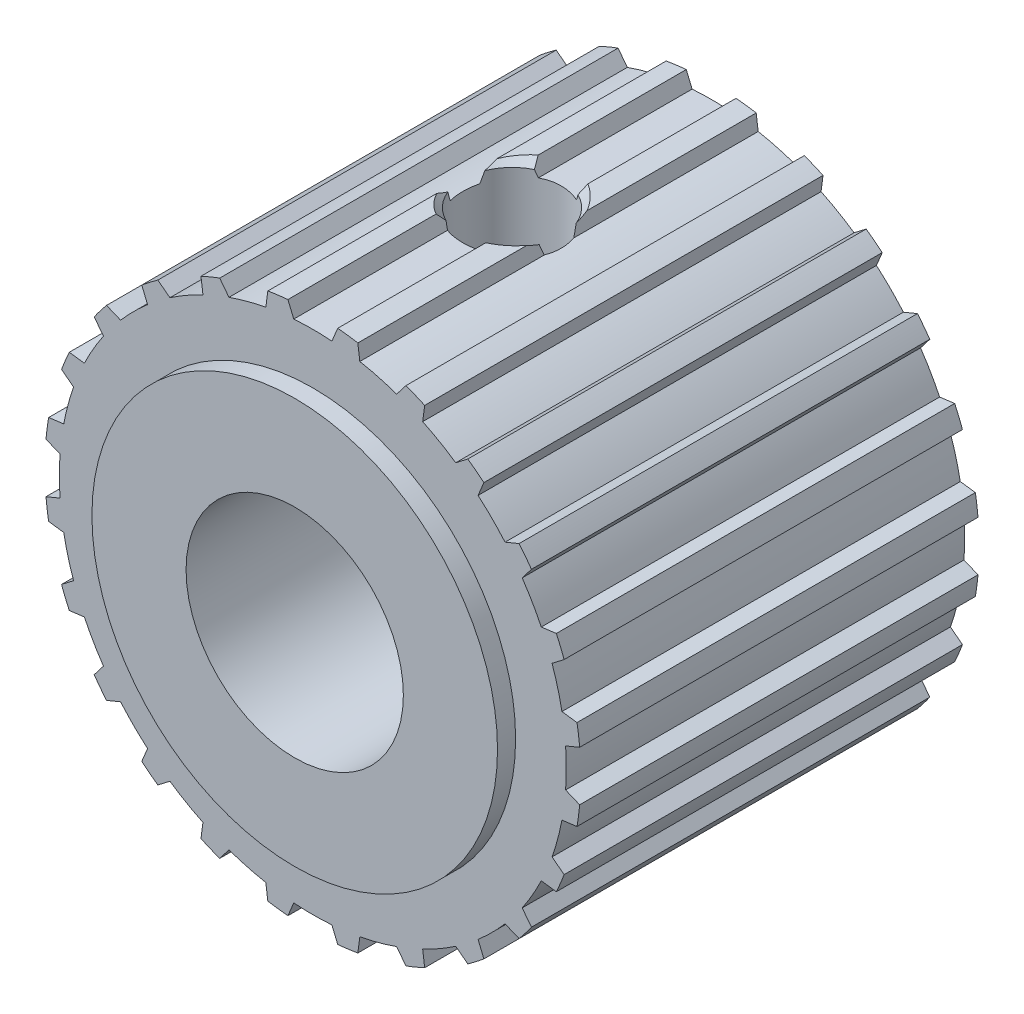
ISO-10303-21;
HEADER;
FILE_DESCRIPTION(('STEP AP214'),'2;1');
FILE_NAME('part.step','',(''),(''),'','','');
FILE_SCHEMA(('AUTOMOTIVE_DESIGN { 1 0 10303 214 1 1 1 1 }'));
ENDSEC;
DATA;
#1=APPLICATION_CONTEXT('core data for automotive mechanical design processes');
#2=APPLICATION_PROTOCOL_DEFINITION('international standard','automotive_design',2000,#1);
#3=PRODUCT_CONTEXT('',#1,'mechanical');
#4=PRODUCT('Part','Part','',(#3));
#5=PRODUCT_RELATED_PRODUCT_CATEGORY('part','',(#4));
#6=PRODUCT_DEFINITION_FORMATION('','',#4);
#7=PRODUCT_DEFINITION_CONTEXT('part definition',#1,'design');
#8=PRODUCT_DEFINITION('design','',#6,#7);
#9=PRODUCT_DEFINITION_SHAPE('','',#8);
#10=(LENGTH_UNIT() NAMED_UNIT(*) SI_UNIT(.MILLI.,.METRE.));
#11=(NAMED_UNIT(*) PLANE_ANGLE_UNIT() SI_UNIT($,.RADIAN.));
#12=(NAMED_UNIT(*) SI_UNIT($,.STERADIAN.) SOLID_ANGLE_UNIT());
#13=UNCERTAINTY_MEASURE_WITH_UNIT(LENGTH_MEASURE(1.E-05),#10,'distance_accuracy_value','');
#14=(GEOMETRIC_REPRESENTATION_CONTEXT(3) GLOBAL_UNCERTAINTY_ASSIGNED_CONTEXT((#13)) GLOBAL_UNIT_ASSIGNED_CONTEXT((#10,
#11,#12)) REPRESENTATION_CONTEXT('',''));
#15=CARTESIAN_POINT('',(0.,0.,0.));
#16=DIRECTION('',(0.,0.,1.));
#17=DIRECTION('',(1.,0.,0.));
#18=AXIS2_PLACEMENT_3D('',#15,#16,#17);
#19=CARTESIAN_POINT('',(0.,0.,15.));
#20=DIRECTION('',(0.,0.,-0.999999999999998));
#21=DIRECTION('',(-1.,0.,0.));
#22=AXIS2_PLACEMENT_3D('',#19,#20,#21);
#23=CYLINDRICAL_SURFACE('',#22,18.5);
#24=DIRECTION('',(0.,0.,0.999999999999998));
#25=VECTOR('',#24,1.);
#26=CARTESIAN_POINT('',(-1.71840916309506,18.4200181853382,-15.));
#27=LINE('',#26,#25);
#28=CARTESIAN_POINT('',(-1.71840916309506,18.4200181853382,3.52329569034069));
#29=VERTEX_POINT('',#28);
#30=CARTESIAN_POINT('',(-1.71840916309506,18.4200181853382,13.7499999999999));
#31=VERTEX_POINT('',#30);
#32=EDGE_CURVE('E1421',#29,#31,#27,.T.);
#33=ORIENTED_EDGE('',*,*,#32,.F.);
#34=CARTESIAN_POINT('',(-1.71820916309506,18.4200368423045,3.52341398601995));
#35=CARTESIAN_POINT('',(-1.80255040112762,18.4121705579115,3.4735302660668));
#36=CARTESIAN_POINT('',(-1.88474909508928,18.4039175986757,3.42020314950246));
#37=CARTESIAN_POINT('',(-2.04451260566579,18.3868543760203,3.30713142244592));
#38=CARTESIAN_POINT('',(-2.122078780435,18.3780442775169,3.24738870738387));
#39=CARTESIAN_POINT('',(-2.34437008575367,18.3514546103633,3.06170627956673));
#40=CARTESIAN_POINT('',(-2.48208755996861,18.3331832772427,2.92727352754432));
#41=CARTESIAN_POINT('',(-2.70398136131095,18.3015774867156,2.6759886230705));
#42=CARTESIAN_POINT('',(-2.79290247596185,18.2881597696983,2.56324940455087));
#43=CARTESIAN_POINT('',(-2.95939713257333,18.2619571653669,2.32707977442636));
#44=CARTESIAN_POINT('',(-3.03678388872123,18.2491845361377,2.20351616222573));
#45=CARTESIAN_POINT('',(-3.1074274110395,18.2371569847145,2.07611107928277));
#46=B_SPLINE_CURVE_WITH_KNOTS('',3,(#34,#35,#36,#37,#38,#39,#40,#41,#42,#43,#44,#45),
.UNSPECIFIED.,.F.,.F.,(4,2,2,2,2,4),(0.,0.294718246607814,0.589349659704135,1.16681017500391,
1.59867898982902,2.03691982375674),.UNSPECIFIED.);
#47=CARTESIAN_POINT('',(-3.1072274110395,18.2371910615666,2.07647173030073));
#48=VERTEX_POINT('',#47);
#49=EDGE_CURVE('E798',#29,#48,#46,.T.);
#50=ORIENTED_EDGE('',*,*,#49,.T.);
#51=DIRECTION('',(0.,0.,0.999999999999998));
#52=VECTOR('',#51,1.);
#53=CARTESIAN_POINT('',(-3.10722741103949,18.2371910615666,-15.));
#54=LINE('',#53,#52);
#55=CARTESIAN_POINT('',(-3.1072274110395,18.2371910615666,13.75));
#56=VERTEX_POINT('',#55);
#57=EDGE_CURVE('E71',#48,#56,#54,.T.);
#58=ORIENTED_EDGE('',*,*,#57,.T.);
#59=CARTESIAN_POINT('',(0.,0.,13.75));
#60=DIRECTION('',(0.,0.,0.999999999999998));
#61=DIRECTION('',(1.,0.,0.));
#62=AXIS2_PLACEMENT_3D('',#59,#60,#61);
#63=CIRCLE('',#62,18.5);
#64=EDGE_CURVE('E2305',#31,#56,#63,.T.);
#65=ORIENTED_EDGE('',*,*,#64,.F.);
#66=EDGE_LOOP('',(#33,#50,#58,#65));
#67=FACE_BOUND('',#66,.T.);
#68=ADVANCED_FACE('F42',(#67),#23,.T.);
#69=DIRECTION('',(0.,0.,0.999999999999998));
#70=VECTOR('',#69,1.);
#71=CARTESIAN_POINT('',(3.10759572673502,18.2371283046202,-15.));
#72=LINE('',#71,#70);
#73=CARTESIAN_POINT('',(3.10759572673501,18.2371283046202,2.07580749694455));
#74=VERTEX_POINT('',#73);
#75=CARTESIAN_POINT('',(3.10759572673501,18.2371283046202,13.7499999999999));
#76=VERTEX_POINT('',#75);
#77=EDGE_CURVE('E1407',#74,#76,#72,.T.);
#78=ORIENTED_EDGE('',*,*,#77,.F.);
#79=CARTESIAN_POINT('',(3.107795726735,18.2370942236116,2.0754466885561));
#80=CARTESIAN_POINT('',(3.06274144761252,18.2447702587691,2.15673001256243));
#81=CARTESIAN_POINT('',(3.0149570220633,18.2527431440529,2.23643967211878));
#82=CARTESIAN_POINT('',(2.91401755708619,18.2691305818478,2.39236630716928));
#83=CARTESIAN_POINT('',(2.86086098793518,18.2775452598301,2.46858227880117));
#84=CARTESIAN_POINT('',(2.6956681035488,18.302885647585,2.68852767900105));
#85=CARTESIAN_POINT('',(2.57615208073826,18.3202171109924,2.82672764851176));
#86=CARTESIAN_POINT('',(2.33920906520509,18.3518385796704,3.06398523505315));
#87=CARTESIAN_POINT('',(2.22449993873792,18.3661720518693,3.16576875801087));
#88=CARTESIAN_POINT('',(1.98133433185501,18.3940097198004,3.3558404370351));
#89=CARTESIAN_POINT('',(1.85268789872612,18.4074970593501,3.44388767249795));
#90=CARTESIAN_POINT('',(1.71858117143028,18.4200021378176,3.52319393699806));
#91=B_SPLINE_CURVE_WITH_KNOTS('',3,(#79,#80,#81,#82,#83,#84,#85,#86,#87,#88,#89,#90),
.UNSPECIFIED.,.F.,.F.,(4,2,2,2,2,4),(0.,0.27963986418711,0.559359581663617,1.10797082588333,
1.56891813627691,2.03721137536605),.UNSPECIFIED.);
#92=CARTESIAN_POINT('',(1.71878117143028,18.419983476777,3.52307560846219));
#93=VERTEX_POINT('',#92);
#94=EDGE_CURVE('E743',#74,#93,#91,.T.);
#95=ORIENTED_EDGE('',*,*,#94,.T.);
#96=DIRECTION('',(0.,0.,0.999999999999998));
#97=VECTOR('',#96,1.);
#98=CARTESIAN_POINT('',(1.71878117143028,18.419983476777,-15.));
#99=LINE('',#98,#97);
#100=CARTESIAN_POINT('',(1.71878117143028,18.419983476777,13.75));
#101=VERTEX_POINT('',#100);
#102=EDGE_CURVE('E741',#93,#101,#99,.T.);
#103=ORIENTED_EDGE('',*,*,#102,.T.);
#104=EDGE_CURVE('E2303',#76,#101,#63,.T.);
#105=ORIENTED_EDGE('',*,*,#104,.F.);
#106=EDGE_LOOP('',(#78,#95,#103,#105));
#107=FACE_BOUND('',#106,.T.);
#108=ADVANCED_FACE('F1750',(#107),#23,.T.);
#109=CARTESIAN_POINT('',(0.,0.,-15.));
#110=DIRECTION('',(0.,0.,0.999999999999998));
#111=DIRECTION('',(1.,0.,0.));
#112=AXIS2_PLACEMENT_3D('',#109,#110,#111);
#113=CYLINDRICAL_SURFACE('',#112,17.5);
#114=DIRECTION('',(0.,0.,0.999999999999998));
#115=VECTOR('',#114,1.);
#116=CARTESIAN_POINT('',(-1.31677590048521,17.4503897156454,-15.));
#117=LINE('',#116,#115);
#118=CARTESIAN_POINT('',(-1.31677590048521,17.4503897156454,-13.7499999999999));
#119=VERTEX_POINT('',#118);
#120=CARTESIAN_POINT('',(-1.3167759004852,17.4503897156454,-3.13466126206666));
#121=VERTEX_POINT('',#120);
#122=EDGE_CURVE('E1413',#119,#121,#117,.T.);
#123=ORIENTED_EDGE('',*,*,#122,.T.);
#124=CARTESIAN_POINT('',(-1.3167759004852,17.4503897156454,-3.13466126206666));
#125=CARTESIAN_POINT('',(-1.23014056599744,17.4569330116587,-3.17106414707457));
#126=CARTESIAN_POINT('',(-1.1419552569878,17.462932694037,-3.20387239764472));
#127=CARTESIAN_POINT('',(-0.963099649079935,17.4737062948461,-3.26209573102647));
#128=CARTESIAN_POINT('',(-0.87242923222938,17.478480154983,-3.2875104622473));
#129=CARTESIAN_POINT('',(-0.68920064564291,17.4866640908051,-3.33074551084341));
#130=CARTESIAN_POINT('',(-0.596641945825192,17.4900737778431,-3.34856366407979));
#131=CARTESIAN_POINT('',(-0.410353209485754,17.4954369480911,-3.37646129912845));
#132=CARTESIAN_POINT('',(-0.316623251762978,17.4973905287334,-3.3865412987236));
#133=CARTESIAN_POINT('',(-0.0344748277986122,17.5009725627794,-3.40503845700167));
#134=CARTESIAN_POINT('',(0.154876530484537,17.5003211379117,-3.40170674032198));
#135=CARTESIAN_POINT('',(0.529964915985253,17.4929781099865,-3.36371950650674));
#136=CARTESIAN_POINT('',(0.715707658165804,17.4862970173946,-3.32911849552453));
#137=CARTESIAN_POINT('',(0.968621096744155,17.4733216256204,-3.25995537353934));
#138=CARTESIAN_POINT('',(1.0395462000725,17.4692384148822,-3.23803266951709));
#139=CARTESIAN_POINT('',(1.17967263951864,17.4603345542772,-3.18964714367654));
#140=CARTESIAN_POINT('',(1.24887623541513,17.4555149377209,-3.16319067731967));
#141=CARTESIAN_POINT('',(1.31715057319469,17.4503614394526,-3.13450384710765));
#142=B_SPLINE_CURVE_WITH_KNOTS('',3,(#124,#125,#126,#127,#128,#129,#130,#131,#132,#133,#134,
#135,#136,#137,#138,#139,#140,#141),.UNSPECIFIED.,.F.,.F.,(4,2,2,2,2,2,2,2,4),(0.,
0.282515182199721,0.565043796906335,0.847652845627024,1.13024298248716,1.69550139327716,
2.25977638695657,2.48269055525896,2.70529475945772),.UNSPECIFIED.);
#143=CARTESIAN_POINT('',(1.31715057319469,17.4503614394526,-3.13450384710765));
#144=VERTEX_POINT('',#143);
#145=EDGE_CURVE('E2089',#121,#144,#142,.T.);
#146=ORIENTED_EDGE('',*,*,#145,.T.);
#147=DIRECTION('',(0.,0.,0.999999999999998));
#148=VECTOR('',#147,1.);
#149=CARTESIAN_POINT('',(1.31715057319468,17.4503614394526,-15.));
#150=LINE('',#149,#148);
#151=CARTESIAN_POINT('',(1.31715057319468,17.4503614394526,-13.75));
#152=VERTEX_POINT('',#151);
#153=EDGE_CURVE('E1425',#152,#144,#150,.T.);
#154=ORIENTED_EDGE('',*,*,#153,.F.);
#155=CARTESIAN_POINT('',(0.,0.,-13.75));
#156=DIRECTION('',(0.,0.,-0.999999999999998));
#157=DIRECTION('',(-1.,0.,0.));
#158=AXIS2_PLACEMENT_3D('',#155,#156,#157);
#159=CIRCLE('',#158,17.5);
#160=EDGE_CURVE('E1129',#119,#152,#159,.T.);
#161=ORIENTED_EDGE('',*,*,#160,.F.);
#162=EDGE_LOOP('',(#123,#146,#154,#161));
#163=FACE_BOUND('',#162,.T.);
#164=ADVANCED_FACE('F1754',(#163),#113,.T.);
#165=CARTESIAN_POINT('',(-1.31677590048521,17.4503897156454,-15.));
#166=DIRECTION('',(-0.923879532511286,-0.382683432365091,0.));
#167=DIRECTION('',(0.382683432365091,-0.923879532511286,0.));
#168=AXIS2_PLACEMENT_3D('',#165,#166,#167);
#169=PLANE('',#168);
#170=CARTESIAN_POINT('',(-1.71849200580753,18.4202181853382,-3.52347780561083));
#171=CARTESIAN_POINT('',(-1.6825635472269,18.3334792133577,-3.44449573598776));
#172=CARTESIAN_POINT('',(-1.64663562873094,18.2467415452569,-3.36551198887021));
#173=CARTESIAN_POINT('',(-1.57478087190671,18.0732688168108,-3.20754113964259));
#174=CARTESIAN_POINT('',(-1.53885403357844,17.9865337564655,-3.12855403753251));
#175=CARTESIAN_POINT('',(-1.50292773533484,17.8998,-3.04956525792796));
#176=B_SPLINE_CURVE_WITH_KNOTS('',3,(#170,#171,#172,#173,#174,#175),.UNSPECIFIED.,.F.,.F.,(4,2,
4),(0.,0.368067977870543,0.736135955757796),.UNSPECIFIED.);
#177=CARTESIAN_POINT('',(-1.71840916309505,18.4200181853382,-3.52329569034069));
#178=VERTEX_POINT('',#177);
#179=CARTESIAN_POINT('',(-1.50301057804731,17.9,-3.04974739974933));
#180=VERTEX_POINT('',#179);
#181=EDGE_CURVE('E792',#178,#180,#176,.T.);
#182=ORIENTED_EDGE('',*,*,#181,.T.);
#183=CARTESIAN_POINT('',(0.,14.2714114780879,0.));
#184=DIRECTION('',(-0.923879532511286,-0.382683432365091,0.));
#185=DIRECTION('',(-0.382683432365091,0.923879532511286,0.));
#186=AXIS2_PLACEMENT_3D('',#183,#184,#185);
#187=ELLIPSE('',#186,8.88462816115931,3.39999999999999);
#188=EDGE_CURVE('E725',#180,#121,#187,.T.);
#189=ORIENTED_EDGE('',*,*,#188,.T.);
#190=ORIENTED_EDGE('',*,*,#122,.F.);
#191=DIRECTION('',(0.382683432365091,-0.923879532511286,0.));
#192=VECTOR('',#191,1.);
#193=CARTESIAN_POINT('',(-1.31677590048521,17.4503897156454,-13.7499999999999));
#194=LINE('',#193,#192);
#195=CARTESIAN_POINT('',(-1.71840916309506,18.4200181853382,-13.75));
#196=VERTEX_POINT('',#195);
#197=EDGE_CURVE('E1131',#196,#119,#194,.T.);
#198=ORIENTED_EDGE('',*,*,#197,.F.);
#199=EDGE_CURVE('E1418',#196,#178,#27,.T.);
#200=ORIENTED_EDGE('',*,*,#199,.T.);
#201=EDGE_LOOP('',(#182,#189,#190,#198,#200));
#202=FACE_BOUND('',#201,.T.);
#203=ADVANCED_FACE('F2067',(#202),#169,.F.);
#204=CARTESIAN_POINT('',(1.31715057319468,17.4503614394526,-15.));
#205=DIRECTION('',(0.923879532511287,-0.382683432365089,0.));
#206=DIRECTION('',(0.382683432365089,0.923879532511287,0.));
#207=AXIS2_PLACEMENT_3D('',#204,#205,#206);
#208=PLANE('',#207);
#209=CARTESIAN_POINT('',(1.71886401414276,18.420183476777,3.52325772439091));
#210=CARTESIAN_POINT('',(1.68293794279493,18.3334502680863,3.44428062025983));
#211=CARTESIAN_POINT('',(1.64701241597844,18.2467183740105,3.36530182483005));
#212=CARTESIAN_POINT('',(1.57516245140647,18.0732572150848,3.20734085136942));
#213=CARTESIAN_POINT('',(1.539238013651,17.9865279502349,3.12835867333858));
#214=CARTESIAN_POINT('',(1.50331412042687,17.8998,3.04937480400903));
#215=B_SPLINE_CURVE_WITH_KNOTS('',3,(#209,#210,#211,#212,#213,#214),.UNSPECIFIED.,.F.,.F.,(4,2,
4),(0.,0.368044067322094,0.736088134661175),.UNSPECIFIED.);
#216=CARTESIAN_POINT('',(1.50339696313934,17.9,3.04955694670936));
#217=VERTEX_POINT('',#216);
#218=EDGE_CURVE('E730',#93,#217,#215,.T.);
#219=ORIENTED_EDGE('',*,*,#218,.T.);
#220=CARTESIAN_POINT('',(0.,14.2704786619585,0.));
#221=DIRECTION('',(0.923879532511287,-0.382683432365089,0.));
#222=DIRECTION('',(0.382683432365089,0.923879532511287,0.));
#223=AXIS2_PLACEMENT_3D('',#220,#221,#222);
#224=ELLIPSE('',#223,8.88462816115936,3.39999999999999);
#225=CARTESIAN_POINT('',(1.31715057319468,17.4503614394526,3.13450384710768));
#226=VERTEX_POINT('',#225);
#227=EDGE_CURVE('E715',#217,#226,#224,.T.);
#228=ORIENTED_EDGE('',*,*,#227,.T.);
#229=CARTESIAN_POINT('',(1.31715057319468,17.4503614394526,13.75));
#230=VERTEX_POINT('',#229);
#231=EDGE_CURVE('E1402',#226,#230,#150,.T.);
#232=ORIENTED_EDGE('',*,*,#231,.T.);
#233=DIRECTION('',(-0.382683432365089,-0.923879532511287,0.));
#234=VECTOR('',#233,1.);
#235=CARTESIAN_POINT('',(1.31715057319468,17.4503614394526,13.75));
#236=LINE('',#235,#234);
#237=EDGE_CURVE('E972',#101,#230,#236,.T.);
#238=ORIENTED_EDGE('',*,*,#237,.F.);
#239=ORIENTED_EDGE('',*,*,#102,.F.);
#240=EDGE_LOOP('',(#219,#228,#232,#238,#239));
#241=FACE_BOUND('',#240,.T.);
#242=ADVANCED_FACE('F739',(#241),#208,.F.);
#243=CARTESIAN_POINT('',(3.24458535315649,17.1965887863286,-15.));
#244=DIRECTION('',(-0.99144486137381,-0.130526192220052,0.));
#245=DIRECTION('',(0.130526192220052,-0.99144486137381,0.));
#246=AXIS2_PLACEMENT_3D('',#243,#244,#245);
#247=PLANE('',#246);
#248=CARTESIAN_POINT('',(3.1075693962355,18.2373283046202,-2.07620695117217));
#249=CARTESIAN_POINT('',(3.1118470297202,18.204836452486,-2.01130824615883));
#250=CARTESIAN_POINT('',(3.11600556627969,18.1732492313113,-1.94593953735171));
#251=CARTESIAN_POINT('',(3.12404382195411,18.1121926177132,-1.81430600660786));
#252=CARTESIAN_POINT('',(3.12792388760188,18.0827205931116,-1.74804242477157));
#253=CARTESIAN_POINT('',(3.13537629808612,18.0261139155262,-1.61448621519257));
#254=CARTESIAN_POINT('',(3.13894858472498,17.9989797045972,-1.54719339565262));
#255=CARTESIAN_POINT('',(3.14574804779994,17.9473326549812,-1.41149611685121));
#256=CARTESIAN_POINT('',(3.14897478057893,17.9228231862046,-1.34309035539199));
#257=CARTESIAN_POINT('',(3.15200584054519,17.8998,-1.27416608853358));
#258=B_SPLINE_CURVE_WITH_KNOTS('',3,(#248,#249,#250,#251,#252,#253,#254,#255,#256,#257),
.UNSPECIFIED.,.F.,.F.,(4,2,2,2,4),(0.,0.218116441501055,0.435956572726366,0.653837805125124,
0.871995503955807),.UNSPECIFIED.);
#259=CARTESIAN_POINT('',(3.10759572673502,18.2371283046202,-2.07580749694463));
#260=VERTEX_POINT('',#259);
#261=CARTESIAN_POINT('',(3.15197951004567,17.9,-1.27476475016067));
#262=VERTEX_POINT('',#261);
#263=EDGE_CURVE('E742',#260,#262,#258,.T.);
#264=ORIENTED_EDGE('',*,*,#263,.T.);
#265=CARTESIAN_POINT('',(0.,41.8416613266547,0.));
#266=DIRECTION('',(-0.99144486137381,-0.130526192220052,0.));
#267=DIRECTION('',(-0.130526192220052,0.99144486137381,0.));
#268=AXIS2_PLACEMENT_3D('',#265,#266,#267);
#269=ELLIPSE('',#268,26.0484117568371,3.39999999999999);
#270=CARTESIAN_POINT('',(3.24458535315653,17.1965887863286,-1.01620169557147));
#271=VERTEX_POINT('',#270);
#272=EDGE_CURVE('E2093',#262,#271,#269,.T.);
#273=ORIENTED_EDGE('',*,*,#272,.T.);
#274=DIRECTION('',(0.,0.,0.999999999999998));
#275=VECTOR('',#274,1.);
#276=CARTESIAN_POINT('',(3.24458535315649,17.1965887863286,-15.));
#277=LINE('',#276,#275);
#278=CARTESIAN_POINT('',(3.24458535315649,17.1965887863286,-13.75));
#279=VERTEX_POINT('',#278);
#280=EDGE_CURVE('E1399',#279,#271,#277,.T.);
#281=ORIENTED_EDGE('',*,*,#280,.F.);
#282=DIRECTION('',(0.130526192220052,-0.99144486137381,0.));
#283=VECTOR('',#282,1.);
#284=CARTESIAN_POINT('',(3.24458535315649,17.1965887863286,-13.75));
#285=LINE('',#284,#283);
#286=CARTESIAN_POINT('',(3.10759572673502,18.2371283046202,-13.75));
#287=VERTEX_POINT('',#286);
#288=EDGE_CURVE('E1125',#287,#279,#285,.T.);
#289=ORIENTED_EDGE('',*,*,#288,.F.);
#290=EDGE_CURVE('E1404',#287,#260,#72,.T.);
#291=ORIENTED_EDGE('',*,*,#290,.T.);
#292=EDGE_LOOP('',(#264,#273,#281,#289,#291));
#293=FACE_BOUND('',#292,.T.);
#294=ADVANCED_FACE('F1766',(#293),#247,.F.);
#295=CARTESIAN_POINT('',(-3.24421612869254,17.1966584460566,-15.));
#296=DIRECTION('',(0.991444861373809,-0.130526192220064,0.));
#297=DIRECTION('',(0.130526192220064,0.991444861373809,0.));
#298=AXIS2_PLACEMENT_3D('',#295,#296,#297);
#299=PLANE('',#298);
#300=CARTESIAN_POINT('',(-3.10720108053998,18.2373910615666,2.07687105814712));
#301=CARTESIAN_POINT('',(-3.11147888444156,18.2048979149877,2.01199029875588));
#302=CARTESIAN_POINT('',(-3.11563769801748,18.1733085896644,1.94663981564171));
#303=CARTESIAN_POINT('',(-3.12367676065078,18.112245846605,1.81504312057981));
#304=CARTESIAN_POINT('',(-3.1275573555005,18.0827698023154,1.74879814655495));
#305=CARTESIAN_POINT('',(-3.13501110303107,18.0261529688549,1.61527962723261));
#306=CARTESIAN_POINT('',(-3.13858419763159,17.9990126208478,1.54800589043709));
#307=CARTESIAN_POINT('',(-3.14538558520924,17.9473509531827,1.41234724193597));
#308=CARTESIAN_POINT('',(-3.148613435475,17.9228329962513,1.34396103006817));
#309=CARTESIAN_POINT('',(-3.15164578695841,17.8998,1.27505641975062));
#310=B_SPLINE_CURVE_WITH_KNOTS('',3,(#300,#301,#302,#303,#304,#305,#306,#307,#308,#309),
.UNSPECIFIED.,.F.,.F.,(4,2,2,2,4),(0.,0.21807014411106,0.435864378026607,0.653699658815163,
0.871811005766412),.UNSPECIFIED.);
#311=CARTESIAN_POINT('',(-3.1516194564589,17.9,1.27565465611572));
#312=VERTEX_POINT('',#311);
#313=EDGE_CURVE('E12',#48,#312,#310,.T.);
#314=ORIENTED_EDGE('',*,*,#313,.T.);
#315=CARTESIAN_POINT('',(0.,41.8389264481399,0.));
#316=DIRECTION('',(0.991444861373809,-0.130526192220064,0.));
#317=DIRECTION('',(0.130526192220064,0.991444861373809,0.));
#318=AXIS2_PLACEMENT_3D('',#315,#316,#317);
#319=ELLIPSE('',#318,26.0484117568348,3.39999999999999);
#320=CARTESIAN_POINT('',(-3.2442161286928,17.1966584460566,1.01737982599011));
#321=VERTEX_POINT('',#320);
#322=EDGE_CURVE('E1819',#312,#321,#319,.T.);
#323=ORIENTED_EDGE('',*,*,#322,.T.);
#324=DIRECTION('',(0.,0.,0.999999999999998));
#325=VECTOR('',#324,1.);
#326=CARTESIAN_POINT('',(-3.24421612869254,17.1966584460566,-15.));
#327=LINE('',#326,#325);
#328=CARTESIAN_POINT('',(-3.24421612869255,17.1966584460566,13.75));
#329=VERTEX_POINT('',#328);
#330=EDGE_CURVE('E1133',#321,#329,#327,.T.);
#331=ORIENTED_EDGE('',*,*,#330,.T.);
#332=DIRECTION('',(-0.130526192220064,-0.991444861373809,0.));
#333=VECTOR('',#332,1.);
#334=CARTESIAN_POINT('',(-3.24421612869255,17.1966584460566,13.75));
#335=LINE('',#334,#333);
#336=EDGE_CURVE('E1434',#56,#329,#335,.T.);
#337=ORIENTED_EDGE('',*,*,#336,.F.);
#338=ORIENTED_EDGE('',*,*,#57,.F.);
#339=EDGE_LOOP('',(#314,#323,#331,#337,#338));
#340=FACE_BOUND('',#339,.T.);
#341=ADVANCED_FACE('F1758',(#340),#299,.F.);
#342=CARTESIAN_POINT('',(-6.42730730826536,17.3476142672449,13.75));
#343=VERTEX_POINT('',#342);
#344=CARTESIAN_POINT('',(-7.72148358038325,16.8115642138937,13.7499999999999));
#345=VERTEX_POINT('',#344);
#346=EDGE_CURVE('E1787',#343,#345,#63,.T.);
#347=ORIENTED_EDGE('',*,*,#346,.F.);
#348=DIRECTION('',(0.,0.,0.999999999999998));
#349=VECTOR('',#348,1.);
#350=CARTESIAN_POINT('',(-6.42730730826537,17.3476142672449,-15.));
#351=LINE('',#350,#349);
#352=CARTESIAN_POINT('',(-6.42730730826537,17.3476142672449,-13.75));
#353=VERTEX_POINT('',#352);
#354=EDGE_CURVE('E1138',#353,#343,#351,.T.);
#355=ORIENTED_EDGE('',*,*,#354,.F.);
#356=CARTESIAN_POINT('',(0.,0.,-13.75));
#357=DIRECTION('',(0.,0.,-0.999999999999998));
#358=DIRECTION('',(-1.,0.,0.));
#359=AXIS2_PLACEMENT_3D('',#356,#357,#358);
#360=CIRCLE('',#359,18.5);
#361=CARTESIAN_POINT('',(-7.72148358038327,16.8115642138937,-13.75));
#362=VERTEX_POINT('',#361);
#363=EDGE_CURVE('E1454',#362,#353,#360,.T.);
#364=ORIENTED_EDGE('',*,*,#363,.F.);
#365=DIRECTION('',(0.,0.,0.999999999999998));
#366=VECTOR('',#365,1.);
#367=CARTESIAN_POINT('',(-7.72148358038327,16.8115642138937,-15.));
#368=LINE('',#367,#366);
#369=EDGE_CURVE('E1154',#362,#345,#368,.T.);
#370=ORIENTED_EDGE('',*,*,#369,.T.);
#371=EDGE_LOOP('',(#347,#355,#364,#370));
#372=FACE_BOUND('',#371,.T.);
#373=ADVANCED_FACE('F44',(#372),#23,.T.);
#374=CARTESIAN_POINT('',(-3.10722741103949,18.2371910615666,-13.75));
#375=VERTEX_POINT('',#374);
#376=CARTESIAN_POINT('',(-3.10722741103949,18.2371910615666,-2.07647173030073));
#377=VERTEX_POINT('',#376);
#378=EDGE_CURVE('E1141',#375,#377,#54,.T.);
#379=ORIENTED_EDGE('',*,*,#378,.T.);
#380=CARTESIAN_POINT('',(-3.10742741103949,18.2371569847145,-2.07611107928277));
#381=CARTESIAN_POINT('',(-3.06235735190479,18.2448347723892,-2.15738739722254));
#382=CARTESIAN_POINT('',(-3.01455723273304,18.2528092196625,-2.23708943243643));
#383=CARTESIAN_POINT('',(-2.9135865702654,18.2691993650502,-2.39299957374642));
#384=CARTESIAN_POINT('',(-2.86041449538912,18.2776151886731,-2.46920667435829));
#385=CARTESIAN_POINT('',(-2.69517599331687,18.3029583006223,-2.68912395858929));
#386=CARTESIAN_POINT('',(-2.57563019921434,18.3202906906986,-2.82730281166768));
#387=CARTESIAN_POINT('',(-2.33867647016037,18.3519063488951,-3.06447415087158));
#388=CARTESIAN_POINT('',(-2.22399119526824,18.3662334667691,-3.16619847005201));
#389=CARTESIAN_POINT('',(-1.98088521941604,18.3940578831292,-3.35615872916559));
#390=CARTESIAN_POINT('',(-1.85227482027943,18.4075383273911,-3.44415399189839));
#391=CARTESIAN_POINT('',(-1.71820916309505,18.4200368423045,-3.52341398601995));
#392=B_SPLINE_CURVE_WITH_KNOTS('',3,(#380,#381,#382,#383,#384,#385,#386,#387,#388,#389,#390,
#391),.UNSPECIFIED.,.F.,.F.,(4,2,2,2,2,4),(0.,0.279644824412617,0.559369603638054,
1.10799111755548,1.56876721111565,2.03688328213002),.UNSPECIFIED.);
#393=EDGE_CURVE('E63',#377,#178,#392,.T.);
#394=ORIENTED_EDGE('',*,*,#393,.T.);
#395=ORIENTED_EDGE('',*,*,#199,.F.);
#396=EDGE_CURVE('E1451',#375,#196,#360,.T.);
#397=ORIENTED_EDGE('',*,*,#396,.F.);
#398=EDGE_LOOP('',(#379,#394,#395,#397));
#399=FACE_BOUND('',#398,.T.);
#400=ADVANCED_FACE('F1449',(#399),#23,.T.);
#401=CARTESIAN_POINT('',(-14.2400185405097,11.8098209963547,13.7499999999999));
#402=VERTEX_POINT('',#401);
#403=CARTESIAN_POINT('',(-15.0927830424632,10.6984998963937,13.75));
#404=VERTEX_POINT('',#403);
#405=EDGE_CURVE('E1788',#402,#404,#63,.T.);
#406=ORIENTED_EDGE('',*,*,#405,.F.);
#407=DIRECTION('',(0.,0.,0.999999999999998));
#408=VECTOR('',#407,1.);
#409=CARTESIAN_POINT('',(-14.2400185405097,11.8098209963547,-15.));
#410=LINE('',#409,#408);
#411=CARTESIAN_POINT('',(-14.2400185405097,11.8098209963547,-13.75));
#412=VERTEX_POINT('',#411);
#413=EDGE_CURVE('E1163',#412,#402,#410,.T.);
#414=ORIENTED_EDGE('',*,*,#413,.F.);
#415=CARTESIAN_POINT('',(-15.0927830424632,10.6984998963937,-13.75));
#416=VERTEX_POINT('',#415);
#417=EDGE_CURVE('E1911',#416,#412,#360,.T.);
#418=ORIENTED_EDGE('',*,*,#417,.F.);
#419=DIRECTION('',(0.,0.,0.999999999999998));
#420=VECTOR('',#419,1.);
#421=CARTESIAN_POINT('',(-15.0927830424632,10.6984998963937,-15.));
#422=LINE('',#421,#420);
#423=EDGE_CURVE('E1178',#416,#404,#422,.T.);
#424=ORIENTED_EDGE('',*,*,#423,.T.);
#425=EDGE_LOOP('',(#406,#414,#418,#424));
#426=FACE_BOUND('',#425,.T.);
#427=ADVANCED_FACE('F1765',(#426),#23,.T.);
#428=CARTESIAN_POINT('',(-16.8114082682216,7.72182310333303,13.75));
#429=VERTEX_POINT('',#428);
#430=CARTESIAN_POINT('',(-17.3474844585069,6.42765765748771,13.75));
#431=VERTEX_POINT('',#430);
#432=EDGE_CURVE('E1525',#429,#431,#63,.T.);
#433=ORIENTED_EDGE('',*,*,#432,.F.);
#434=DIRECTION('',(0.,0.,0.999999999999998));
#435=VECTOR('',#434,1.);
#436=CARTESIAN_POINT('',(-16.8114082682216,7.72182310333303,-15.));
#437=LINE('',#436,#435);
#438=CARTESIAN_POINT('',(-16.8114082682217,7.72182310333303,-13.75));
#439=VERTEX_POINT('',#438);
#440=EDGE_CURVE('E1175',#439,#429,#437,.T.);
#441=ORIENTED_EDGE('',*,*,#440,.F.);
#442=CARTESIAN_POINT('',(-17.3474844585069,6.42765765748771,-13.7499999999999));
#443=VERTEX_POINT('',#442);
#444=EDGE_CURVE('E991',#443,#439,#360,.T.);
#445=ORIENTED_EDGE('',*,*,#444,.F.);
#446=DIRECTION('',(0.,0.,0.999999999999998));
#447=VECTOR('',#446,1.);
#448=CARTESIAN_POINT('',(-17.3474844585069,6.42765765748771,-15.));
#449=LINE('',#448,#447);
#450=EDGE_CURVE('E1190',#443,#431,#449,.T.);
#451=ORIENTED_EDGE('',*,*,#450,.T.);
#452=EDGE_LOOP('',(#433,#441,#445,#451));
#453=FACE_BOUND('',#452,.T.);
#454=ADVANCED_FACE('F1908',(#453),#23,.T.);
#455=CARTESIAN_POINT('',(-18.2371283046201,3.10759572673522,13.7499999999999));
#456=VERTEX_POINT('',#455);
#457=CARTESIAN_POINT('',(-18.4199834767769,1.71878117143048,13.7499999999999));
#458=VERTEX_POINT('',#457);
#459=EDGE_CURVE('E1523',#456,#458,#63,.T.);
#460=ORIENTED_EDGE('',*,*,#459,.F.);
#461=DIRECTION('',(0.,0.,0.999999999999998));
#462=VECTOR('',#461,1.);
#463=CARTESIAN_POINT('',(-18.2371283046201,3.10759572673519,-15.));
#464=LINE('',#463,#462);
#465=CARTESIAN_POINT('',(-18.2371283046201,3.10759572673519,-13.75));
#466=VERTEX_POINT('',#465);
#467=EDGE_CURVE('E1187',#466,#456,#464,.T.);
#468=ORIENTED_EDGE('',*,*,#467,.F.);
#469=CARTESIAN_POINT('',(-18.419983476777,1.71878117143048,-13.75));
#470=VERTEX_POINT('',#469);
#471=EDGE_CURVE('E988',#470,#466,#360,.T.);
#472=ORIENTED_EDGE('',*,*,#471,.F.);
#473=DIRECTION('',(0.,0.,0.999999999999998));
#474=VECTOR('',#473,1.);
#475=CARTESIAN_POINT('',(-18.4199834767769,1.71878117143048,-15.));
#476=LINE('',#475,#474);
#477=EDGE_CURVE('E1202',#470,#458,#476,.T.);
#478=ORIENTED_EDGE('',*,*,#477,.T.);
#479=EDGE_LOOP('',(#460,#468,#472,#478));
#480=FACE_BOUND('',#479,.T.);
#481=ADVANCED_FACE('F1894',(#480),#23,.T.);
#482=CARTESIAN_POINT('',(-18.4200181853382,-1.71840916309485,13.75));
#483=VERTEX_POINT('',#482);
#484=CARTESIAN_POINT('',(-18.2371910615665,-3.10722741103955,13.75));
#485=VERTEX_POINT('',#484);
#486=EDGE_CURVE('E1521',#483,#485,#63,.T.);
#487=ORIENTED_EDGE('',*,*,#486,.F.);
#488=DIRECTION('',(0.,0.,0.999999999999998));
#489=VECTOR('',#488,1.);
#490=CARTESIAN_POINT('',(-18.4200181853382,-1.71840916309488,-15.));
#491=LINE('',#490,#489);
#492=CARTESIAN_POINT('',(-18.4200181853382,-1.71840916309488,-13.75));
#493=VERTEX_POINT('',#492);
#494=EDGE_CURVE('E1199',#493,#483,#491,.T.);
#495=ORIENTED_EDGE('',*,*,#494,.F.);
#496=CARTESIAN_POINT('',(-18.2371910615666,-3.10722741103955,-13.75));
#497=VERTEX_POINT('',#496);
#498=EDGE_CURVE('E987',#497,#493,#360,.T.);
#499=ORIENTED_EDGE('',*,*,#498,.F.);
#500=DIRECTION('',(0.,0.,0.999999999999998));
#501=VECTOR('',#500,1.);
#502=CARTESIAN_POINT('',(-18.2371910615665,-3.10722741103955,-15.));
#503=LINE('',#502,#501);
#504=EDGE_CURVE('E1214',#497,#485,#503,.T.);
#505=ORIENTED_EDGE('',*,*,#504,.T.);
#506=EDGE_LOOP('',(#487,#495,#499,#505));
#507=FACE_BOUND('',#506,.T.);
#508=ADVANCED_FACE('F1520',(#507),#23,.T.);
#509=CARTESIAN_POINT('',(-17.3476142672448,-6.42730730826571,13.75));
#510=VERTEX_POINT('',#509);
#511=CARTESIAN_POINT('',(-16.8115642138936,-7.7214835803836,13.75));
#512=VERTEX_POINT('',#511);
#513=EDGE_CURVE('E1524',#510,#512,#63,.T.);
#514=ORIENTED_EDGE('',*,*,#513,.F.);
#515=DIRECTION('',(0.,0.,0.999999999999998));
#516=VECTOR('',#515,1.);
#517=CARTESIAN_POINT('',(-17.3476142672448,-6.42730730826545,-15.));
#518=LINE('',#517,#516);
#519=CARTESIAN_POINT('',(-17.3476142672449,-6.42730730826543,-13.7499999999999));
#520=VERTEX_POINT('',#519);
#521=EDGE_CURVE('E1211',#520,#510,#518,.T.);
#522=ORIENTED_EDGE('',*,*,#521,.F.);
#523=CARTESIAN_POINT('',(-16.8115642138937,-7.72148358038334,-13.75));
#524=VERTEX_POINT('',#523);
#525=EDGE_CURVE('E1502',#524,#520,#360,.T.);
#526=ORIENTED_EDGE('',*,*,#525,.F.);
#527=DIRECTION('',(0.,0.,0.999999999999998));
#528=VECTOR('',#527,1.);
#529=CARTESIAN_POINT('',(-16.8115642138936,-7.72148358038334,-15.));
#530=LINE('',#529,#528);
#531=EDGE_CURVE('E1226',#524,#512,#530,.T.);
#532=ORIENTED_EDGE('',*,*,#531,.T.);
#533=EDGE_LOOP('',(#514,#522,#526,#532));
#534=FACE_BOUND('',#533,.T.);
#535=ADVANCED_FACE('F1726',(#534),#23,.T.);
#536=CARTESIAN_POINT('',(-15.0929991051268,-10.6981950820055,13.75));
#537=VERTEX_POINT('',#536);
#538=CARTESIAN_POINT('',(-14.2402570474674,-11.8095334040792,13.75));
#539=VERTEX_POINT('',#538);
#540=EDGE_CURVE('E1526',#537,#539,#63,.T.);
#541=ORIENTED_EDGE('',*,*,#540,.F.);
#542=DIRECTION('',(0.,0.,0.999999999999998));
#543=VECTOR('',#542,1.);
#544=CARTESIAN_POINT('',(-15.0929991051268,-10.6981950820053,-15.));
#545=LINE('',#544,#543);
#546=CARTESIAN_POINT('',(-15.0929991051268,-10.6981950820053,-13.75));
#547=VERTEX_POINT('',#546);
#548=EDGE_CURVE('E1223',#547,#537,#545,.T.);
#549=ORIENTED_EDGE('',*,*,#548,.F.);
#550=CARTESIAN_POINT('',(-14.2402570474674,-11.8095334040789,-13.75));
#551=VERTEX_POINT('',#550);
#552=EDGE_CURVE('E1499',#551,#547,#360,.T.);
#553=ORIENTED_EDGE('',*,*,#552,.F.);
#554=DIRECTION('',(0.,0.,0.999999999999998));
#555=VECTOR('',#554,1.);
#556=CARTESIAN_POINT('',(-14.2402570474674,-11.8095334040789,-15.));
#557=LINE('',#556,#555);
#558=EDGE_CURVE('E1238',#551,#539,#557,.T.);
#559=ORIENTED_EDGE('',*,*,#558,.T.);
#560=EDGE_LOOP('',(#541,#549,#553,#559));
#561=FACE_BOUND('',#560,.T.);
#562=ADVANCED_FACE('F1710',(#561),#23,.T.);
#563=CARTESIAN_POINT('',(-11.8098209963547,-14.24001854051,13.7499999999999));
#564=VERTEX_POINT('',#563);
#565=CARTESIAN_POINT('',(-10.6984998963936,-15.0927830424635,13.75));
#566=VERTEX_POINT('',#565);
#567=EDGE_CURVE('E1529',#564,#566,#63,.T.);
#568=ORIENTED_EDGE('',*,*,#567,.F.);
#569=DIRECTION('',(0.,0.,0.999999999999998));
#570=VECTOR('',#569,1.);
#571=CARTESIAN_POINT('',(-11.8098209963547,-14.2400185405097,-15.));
#572=LINE('',#571,#570);
#573=CARTESIAN_POINT('',(-11.8098209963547,-14.2400185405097,-13.75));
#574=VERTEX_POINT('',#573);
#575=EDGE_CURVE('E1235',#574,#564,#572,.T.);
#576=ORIENTED_EDGE('',*,*,#575,.F.);
#577=CARTESIAN_POINT('',(-10.6984998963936,-15.0927830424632,-13.75));
#578=VERTEX_POINT('',#577);
#579=EDGE_CURVE('E1496',#578,#574,#360,.T.);
#580=ORIENTED_EDGE('',*,*,#579,.F.);
#581=DIRECTION('',(0.,0.,0.999999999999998));
#582=VECTOR('',#581,1.);
#583=CARTESIAN_POINT('',(-10.6984998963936,-15.0927830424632,-15.));
#584=LINE('',#583,#582);
#585=EDGE_CURVE('E1250',#578,#566,#584,.T.);
#586=ORIENTED_EDGE('',*,*,#585,.T.);
#587=EDGE_LOOP('',(#568,#576,#580,#586));
#588=FACE_BOUND('',#587,.T.);
#589=ADVANCED_FACE('F1694',(#588),#23,.T.);
#590=CARTESIAN_POINT('',(-7.72182310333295,-16.8114082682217,13.7499999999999));
#591=VERTEX_POINT('',#590);
#592=CARTESIAN_POINT('',(-6.42765765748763,-17.347484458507,13.75));
#593=VERTEX_POINT('',#592);
#594=EDGE_CURVE('E1532',#591,#593,#63,.T.);
#595=ORIENTED_EDGE('',*,*,#594,.F.);
#596=DIRECTION('',(0.,0.,0.999999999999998));
#597=VECTOR('',#596,1.);
#598=CARTESIAN_POINT('',(-7.72182310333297,-16.8114082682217,-15.));
#599=LINE('',#598,#597);
#600=CARTESIAN_POINT('',(-7.72182310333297,-16.8114082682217,-13.75));
#601=VERTEX_POINT('',#600);
#602=EDGE_CURVE('E1247',#601,#591,#599,.T.);
#603=ORIENTED_EDGE('',*,*,#602,.F.);
#604=CARTESIAN_POINT('',(-6.42765765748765,-17.347484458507,-13.75));
#605=VERTEX_POINT('',#604);
#606=EDGE_CURVE('E1493',#605,#601,#360,.T.);
#607=ORIENTED_EDGE('',*,*,#606,.F.);
#608=DIRECTION('',(0.,0.,0.999999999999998));
#609=VECTOR('',#608,1.);
#610=CARTESIAN_POINT('',(-6.42765765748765,-17.347484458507,-15.));
#611=LINE('',#610,#609);
#612=EDGE_CURVE('E1262',#605,#593,#611,.T.);
#613=ORIENTED_EDGE('',*,*,#612,.T.);
#614=EDGE_LOOP('',(#595,#603,#607,#613));
#615=FACE_BOUND('',#614,.T.);
#616=ADVANCED_FACE('F1678',(#615),#23,.T.);
#617=CARTESIAN_POINT('',(-3.10759572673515,-18.2371283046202,13.75));
#618=VERTEX_POINT('',#617);
#619=CARTESIAN_POINT('',(-1.71878117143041,-18.419983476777,13.75));
#620=VERTEX_POINT('',#619);
#621=EDGE_CURVE('E1535',#618,#620,#63,.T.);
#622=ORIENTED_EDGE('',*,*,#621,.F.);
#623=DIRECTION('',(0.,0.,0.999999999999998));
#624=VECTOR('',#623,1.);
#625=CARTESIAN_POINT('',(-3.10759572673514,-18.2371283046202,-15.));
#626=LINE('',#625,#624);
#627=CARTESIAN_POINT('',(-3.10759572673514,-18.2371283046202,-13.75));
#628=VERTEX_POINT('',#627);
#629=EDGE_CURVE('E1259',#628,#618,#626,.T.);
#630=ORIENTED_EDGE('',*,*,#629,.F.);
#631=CARTESIAN_POINT('',(-1.71878117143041,-18.419983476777,-13.75));
#632=VERTEX_POINT('',#631);
#633=EDGE_CURVE('E1490',#632,#628,#360,.T.);
#634=ORIENTED_EDGE('',*,*,#633,.F.);
#635=DIRECTION('',(0.,0.,0.999999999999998));
#636=VECTOR('',#635,1.);
#637=CARTESIAN_POINT('',(-1.71878117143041,-18.419983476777,-15.));
#638=LINE('',#637,#636);
#639=EDGE_CURVE('E1274',#632,#620,#638,.T.);
#640=ORIENTED_EDGE('',*,*,#639,.T.);
#641=EDGE_LOOP('',(#622,#630,#634,#640));
#642=FACE_BOUND('',#641,.T.);
#643=ADVANCED_FACE('F1662',(#642),#23,.T.);
#644=CARTESIAN_POINT('',(1.71840916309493,-18.4200181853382,13.75));
#645=VERTEX_POINT('',#644);
#646=CARTESIAN_POINT('',(3.10722741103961,-18.2371910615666,13.7499999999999));
#647=VERTEX_POINT('',#646);
#648=EDGE_CURVE('E1538',#645,#647,#63,.T.);
#649=ORIENTED_EDGE('',*,*,#648,.F.);
#650=DIRECTION('',(0.,0.,0.999999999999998));
#651=VECTOR('',#650,1.);
#652=CARTESIAN_POINT('',(1.71840916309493,-18.4200181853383,-15.));
#653=LINE('',#652,#651);
#654=CARTESIAN_POINT('',(1.71840916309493,-18.4200181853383,-13.75));
#655=VERTEX_POINT('',#654);
#656=EDGE_CURVE('E1271',#655,#645,#653,.T.);
#657=ORIENTED_EDGE('',*,*,#656,.F.);
#658=CARTESIAN_POINT('',(3.10722741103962,-18.2371910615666,-13.75));
#659=VERTEX_POINT('',#658);
#660=EDGE_CURVE('E1487',#659,#655,#360,.T.);
#661=ORIENTED_EDGE('',*,*,#660,.F.);
#662=DIRECTION('',(0.,0.,0.999999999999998));
#663=VECTOR('',#662,1.);
#664=CARTESIAN_POINT('',(3.10722741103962,-18.2371910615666,-15.));
#665=LINE('',#664,#663);
#666=EDGE_CURVE('E1286',#659,#647,#665,.T.);
#667=ORIENTED_EDGE('',*,*,#666,.T.);
#668=EDGE_LOOP('',(#649,#657,#661,#667));
#669=FACE_BOUND('',#668,.T.);
#670=ADVANCED_FACE('F1646',(#669),#23,.T.);
#671=CARTESIAN_POINT('',(6.42730730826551,-17.3476142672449,13.75));
#672=VERTEX_POINT('',#671);
#673=CARTESIAN_POINT('',(7.7214835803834,-16.8115642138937,13.75));
#674=VERTEX_POINT('',#673);
#675=EDGE_CURVE('E1541',#672,#674,#63,.T.);
#676=ORIENTED_EDGE('',*,*,#675,.F.);
#677=DIRECTION('',(0.,0.,0.999999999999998));
#678=VECTOR('',#677,1.);
#679=CARTESIAN_POINT('',(6.4273073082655,-17.3476142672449,-15.));
#680=LINE('',#679,#678);
#681=CARTESIAN_POINT('',(6.42730730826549,-17.3476142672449,-13.75));
#682=VERTEX_POINT('',#681);
#683=EDGE_CURVE('E1283',#682,#672,#680,.T.);
#684=ORIENTED_EDGE('',*,*,#683,.F.);
#685=CARTESIAN_POINT('',(7.72148358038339,-16.8115642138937,-13.7499999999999));
#686=VERTEX_POINT('',#685);
#687=EDGE_CURVE('E1484',#686,#682,#360,.T.);
#688=ORIENTED_EDGE('',*,*,#687,.F.);
#689=DIRECTION('',(0.,0.,0.999999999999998));
#690=VECTOR('',#689,1.);
#691=CARTESIAN_POINT('',(7.72148358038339,-16.8115642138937,-15.));
#692=LINE('',#691,#690);
#693=EDGE_CURVE('E1298',#686,#674,#692,.T.);
#694=ORIENTED_EDGE('',*,*,#693,.T.);
#695=EDGE_LOOP('',(#676,#684,#688,#694));
#696=FACE_BOUND('',#695,.T.);
#697=ADVANCED_FACE('F1630',(#696),#23,.T.);
#698=CARTESIAN_POINT('',(10.6981950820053,-15.092999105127,13.7499999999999));
#699=VERTEX_POINT('',#698);
#700=CARTESIAN_POINT('',(11.809533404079,-14.2402570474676,13.7499999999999));
#701=VERTEX_POINT('',#700);
#702=EDGE_CURVE('E1544',#699,#701,#63,.T.);
#703=ORIENTED_EDGE('',*,*,#702,.F.);
#704=DIRECTION('',(0.,0.,0.999999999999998));
#705=VECTOR('',#704,1.);
#706=CARTESIAN_POINT('',(10.6981950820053,-15.0929991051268,-15.));
#707=LINE('',#706,#705);
#708=CARTESIAN_POINT('',(10.6981950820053,-15.0929991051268,-13.75));
#709=VERTEX_POINT('',#708);
#710=EDGE_CURVE('E1295',#709,#699,#707,.T.);
#711=ORIENTED_EDGE('',*,*,#710,.F.);
#712=CARTESIAN_POINT('',(11.809533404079,-14.2402570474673,-13.75));
#713=VERTEX_POINT('',#712);
#714=EDGE_CURVE('E1481',#713,#709,#360,.T.);
#715=ORIENTED_EDGE('',*,*,#714,.F.);
#716=DIRECTION('',(0.,0.,0.999999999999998));
#717=VECTOR('',#716,1.);
#718=CARTESIAN_POINT('',(11.809533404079,-14.2402570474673,-15.));
#719=LINE('',#718,#717);
#720=EDGE_CURVE('E1310',#713,#701,#719,.T.);
#721=ORIENTED_EDGE('',*,*,#720,.T.);
#722=EDGE_LOOP('',(#703,#711,#715,#721));
#723=FACE_BOUND('',#722,.T.);
#724=ADVANCED_FACE('F1614',(#723),#23,.T.);
#725=CARTESIAN_POINT('',(14.2400185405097,-11.8098209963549,13.75));
#726=VERTEX_POINT('',#725);
#727=CARTESIAN_POINT('',(15.0927830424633,-10.6984998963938,13.75));
#728=VERTEX_POINT('',#727);
#729=EDGE_CURVE('E1547',#726,#728,#63,.T.);
#730=ORIENTED_EDGE('',*,*,#729,.F.);
#731=DIRECTION('',(0.,0.,0.999999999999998));
#732=VECTOR('',#731,1.);
#733=CARTESIAN_POINT('',(14.2400185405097,-11.8098209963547,-15.));
#734=LINE('',#733,#732);
#735=CARTESIAN_POINT('',(14.2400185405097,-11.8098209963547,-13.75));
#736=VERTEX_POINT('',#735);
#737=EDGE_CURVE('E1307',#736,#726,#734,.T.);
#738=ORIENTED_EDGE('',*,*,#737,.F.);
#739=CARTESIAN_POINT('',(15.0927830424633,-10.6984998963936,-13.75));
#740=VERTEX_POINT('',#739);
#741=EDGE_CURVE('E1478',#740,#736,#360,.T.);
#742=ORIENTED_EDGE('',*,*,#741,.F.);
#743=DIRECTION('',(0.,0.,0.999999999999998));
#744=VECTOR('',#743,1.);
#745=CARTESIAN_POINT('',(15.0927830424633,-10.6984998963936,-15.));
#746=LINE('',#745,#744);
#747=EDGE_CURVE('E1322',#740,#728,#746,.T.);
#748=ORIENTED_EDGE('',*,*,#747,.T.);
#749=EDGE_LOOP('',(#730,#738,#742,#748));
#750=FACE_BOUND('',#749,.T.);
#751=ADVANCED_FACE('F1598',(#750),#23,.T.);
#752=CARTESIAN_POINT('',(16.8114082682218,-7.72182310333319,13.75));
#753=VERTEX_POINT('',#752);
#754=CARTESIAN_POINT('',(17.347484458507,-6.42765765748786,13.7499999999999));
#755=VERTEX_POINT('',#754);
#756=EDGE_CURVE('E1550',#753,#755,#63,.T.);
#757=ORIENTED_EDGE('',*,*,#756,.F.);
#758=DIRECTION('',(0.,0.,0.999999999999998));
#759=VECTOR('',#758,1.);
#760=CARTESIAN_POINT('',(16.8114082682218,-7.72182310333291,-15.));
#761=LINE('',#760,#759);
#762=CARTESIAN_POINT('',(16.8114082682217,-7.72182310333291,-13.75));
#763=VERTEX_POINT('',#762);
#764=EDGE_CURVE('E1319',#763,#753,#761,.T.);
#765=ORIENTED_EDGE('',*,*,#764,.F.);
#766=CARTESIAN_POINT('',(17.347484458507,-6.42765765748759,-13.75));
#767=VERTEX_POINT('',#766);
#768=EDGE_CURVE('E1475',#767,#763,#360,.T.);
#769=ORIENTED_EDGE('',*,*,#768,.F.);
#770=DIRECTION('',(0.,0.,0.999999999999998));
#771=VECTOR('',#770,1.);
#772=CARTESIAN_POINT('',(17.3474844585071,-6.42765765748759,-15.));
#773=LINE('',#772,#771);
#774=EDGE_CURVE('E1334',#767,#755,#773,.T.);
#775=ORIENTED_EDGE('',*,*,#774,.T.);
#776=EDGE_LOOP('',(#757,#765,#769,#775));
#777=FACE_BOUND('',#776,.T.);
#778=ADVANCED_FACE('F1582',(#777),#23,.T.);
#779=CARTESIAN_POINT('',(18.2371283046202,-3.10759572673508,13.75));
#780=VERTEX_POINT('',#779);
#781=CARTESIAN_POINT('',(18.419983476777,-1.71878117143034,13.75));
#782=VERTEX_POINT('',#781);
#783=EDGE_CURVE('E830',#780,#782,#63,.T.);
#784=ORIENTED_EDGE('',*,*,#783,.F.);
#785=DIRECTION('',(0.,0.,0.999999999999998));
#786=VECTOR('',#785,1.);
#787=CARTESIAN_POINT('',(18.2371283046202,-3.10759572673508,-15.));
#788=LINE('',#787,#786);
#789=CARTESIAN_POINT('',(18.2371283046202,-3.10759572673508,-13.75));
#790=VERTEX_POINT('',#789);
#791=EDGE_CURVE('E1331',#790,#780,#788,.T.);
#792=ORIENTED_EDGE('',*,*,#791,.F.);
#793=CARTESIAN_POINT('',(18.419983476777,-1.71878117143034,-13.75));
#794=VERTEX_POINT('',#793);
#795=EDGE_CURVE('E1472',#794,#790,#360,.T.);
#796=ORIENTED_EDGE('',*,*,#795,.F.);
#797=DIRECTION('',(0.,0.,0.999999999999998));
#798=VECTOR('',#797,1.);
#799=CARTESIAN_POINT('',(18.419983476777,-1.71878117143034,-15.));
#800=LINE('',#799,#798);
#801=EDGE_CURVE('E1346',#794,#782,#800,.T.);
#802=ORIENTED_EDGE('',*,*,#801,.T.);
#803=EDGE_LOOP('',(#784,#792,#796,#802));
#804=FACE_BOUND('',#803,.T.);
#805=ADVANCED_FACE('F1567',(#804),#23,.T.);
#806=CARTESIAN_POINT('',(18.4200181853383,1.71840916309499,13.75));
#807=VERTEX_POINT('',#806);
#808=CARTESIAN_POINT('',(18.2371910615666,3.10722741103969,13.75));
#809=VERTEX_POINT('',#808);
#810=EDGE_CURVE('E831',#807,#809,#63,.T.);
#811=ORIENTED_EDGE('',*,*,#810,.F.);
#812=DIRECTION('',(0.,0.,0.999999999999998));
#813=VECTOR('',#812,1.);
#814=CARTESIAN_POINT('',(18.4200181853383,1.71840916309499,-15.));
#815=LINE('',#814,#813);
#816=CARTESIAN_POINT('',(18.4200181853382,1.71840916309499,-13.75));
#817=VERTEX_POINT('',#816);
#818=EDGE_CURVE('E1343',#817,#807,#815,.T.);
#819=ORIENTED_EDGE('',*,*,#818,.F.);
#820=CARTESIAN_POINT('',(18.2371910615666,3.10722741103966,-13.75));
#821=VERTEX_POINT('',#820);
#822=EDGE_CURVE('E1469',#821,#817,#360,.T.);
#823=ORIENTED_EDGE('',*,*,#822,.F.);
#824=DIRECTION('',(0.,0.,0.999999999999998));
#825=VECTOR('',#824,1.);
#826=CARTESIAN_POINT('',(18.2371910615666,3.10722741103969,-15.));
#827=LINE('',#826,#825);
#828=EDGE_CURVE('E1358',#821,#809,#827,.T.);
#829=ORIENTED_EDGE('',*,*,#828,.T.);
#830=EDGE_LOOP('',(#811,#819,#823,#829));
#831=FACE_BOUND('',#830,.T.);
#832=ADVANCED_FACE('F1974',(#831),#23,.T.);
#833=CARTESIAN_POINT('',(17.3476142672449,6.42730730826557,13.75));
#834=VERTEX_POINT('',#833);
#835=CARTESIAN_POINT('',(16.8115642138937,7.72148358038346,13.75));
#836=VERTEX_POINT('',#835);
#837=EDGE_CURVE('E834',#834,#836,#63,.T.);
#838=ORIENTED_EDGE('',*,*,#837,.F.);
#839=DIRECTION('',(0.,0.,0.999999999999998));
#840=VECTOR('',#839,1.);
#841=CARTESIAN_POINT('',(17.3476142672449,6.42730730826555,-15.));
#842=LINE('',#841,#840);
#843=CARTESIAN_POINT('',(17.3476142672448,6.42730730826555,-13.75));
#844=VERTEX_POINT('',#843);
#845=EDGE_CURVE('E1355',#844,#834,#842,.T.);
#846=ORIENTED_EDGE('',*,*,#845,.F.);
#847=CARTESIAN_POINT('',(16.8115642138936,7.72148358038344,-13.75));
#848=VERTEX_POINT('',#847);
#849=EDGE_CURVE('E1466',#848,#844,#360,.T.);
#850=ORIENTED_EDGE('',*,*,#849,.F.);
#851=DIRECTION('',(0.,0.,0.999999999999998));
#852=VECTOR('',#851,1.);
#853=CARTESIAN_POINT('',(16.8115642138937,7.72148358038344,-15.));
#854=LINE('',#853,#852);
#855=EDGE_CURVE('E1370',#848,#836,#854,.T.);
#856=ORIENTED_EDGE('',*,*,#855,.T.);
#857=EDGE_LOOP('',(#838,#846,#850,#856));
#858=FACE_BOUND('',#857,.T.);
#859=ADVANCED_FACE('F1978',(#858),#23,.T.);
#860=CARTESIAN_POINT('',(15.0929991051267,10.6981950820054,13.7499999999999));
#861=VERTEX_POINT('',#860);
#862=CARTESIAN_POINT('',(14.2402570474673,11.809533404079,13.75));
#863=VERTEX_POINT('',#862);
#864=EDGE_CURVE('E2286',#861,#863,#63,.T.);
#865=ORIENTED_EDGE('',*,*,#864,.F.);
#866=DIRECTION('',(0.,0.,0.999999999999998));
#867=VECTOR('',#866,1.);
#868=CARTESIAN_POINT('',(15.0929991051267,10.6981950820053,-15.));
#869=LINE('',#868,#867);
#870=CARTESIAN_POINT('',(15.0929991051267,10.6981950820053,-13.75));
#871=VERTEX_POINT('',#870);
#872=EDGE_CURVE('E1367',#871,#861,#869,.T.);
#873=ORIENTED_EDGE('',*,*,#872,.F.);
#874=CARTESIAN_POINT('',(14.2402570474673,11.809533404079,-13.75));
#875=VERTEX_POINT('',#874);
#876=EDGE_CURVE('E1463',#875,#871,#360,.T.);
#877=ORIENTED_EDGE('',*,*,#876,.F.);
#878=DIRECTION('',(0.,0.,0.999999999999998));
#879=VECTOR('',#878,1.);
#880=CARTESIAN_POINT('',(14.2402570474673,11.809533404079,-15.));
#881=LINE('',#880,#879);
#882=EDGE_CURVE('E1382',#875,#863,#881,.T.);
#883=ORIENTED_EDGE('',*,*,#882,.T.);
#884=EDGE_LOOP('',(#865,#873,#877,#883));
#885=FACE_BOUND('',#884,.T.);
#886=ADVANCED_FACE('F1983',(#885),#23,.T.);
#887=CARTESIAN_POINT('',(11.8098209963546,14.2400185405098,13.75));
#888=VERTEX_POINT('',#887);
#889=CARTESIAN_POINT('',(10.6984998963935,15.0927830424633,13.75));
#890=VERTEX_POINT('',#889);
#891=EDGE_CURVE('E2274',#888,#890,#63,.T.);
#892=ORIENTED_EDGE('',*,*,#891,.F.);
#893=DIRECTION('',(0.,0.,0.999999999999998));
#894=VECTOR('',#893,1.);
#895=CARTESIAN_POINT('',(11.8098209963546,14.2400185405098,-15.));
#896=LINE('',#895,#894);
#897=CARTESIAN_POINT('',(11.8098209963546,14.2400185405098,-13.75));
#898=VERTEX_POINT('',#897);
#899=EDGE_CURVE('E1379',#898,#888,#896,.T.);
#900=ORIENTED_EDGE('',*,*,#899,.F.);
#901=CARTESIAN_POINT('',(10.6984998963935,15.0927830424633,-13.75));
#902=VERTEX_POINT('',#901);
#903=EDGE_CURVE('E1460',#902,#898,#360,.T.);
#904=ORIENTED_EDGE('',*,*,#903,.F.);
#905=DIRECTION('',(0.,0.,0.999999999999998));
#906=VECTOR('',#905,1.);
#907=CARTESIAN_POINT('',(10.6984998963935,15.0927830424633,-15.));
#908=LINE('',#907,#906);
#909=EDGE_CURVE('E1394',#902,#890,#908,.T.);
#910=ORIENTED_EDGE('',*,*,#909,.T.);
#911=EDGE_LOOP('',(#892,#900,#904,#910));
#912=FACE_BOUND('',#911,.T.);
#913=ADVANCED_FACE('F2273',(#912),#23,.T.);
#914=CARTESIAN_POINT('',(7.72182310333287,16.8114082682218,13.75));
#915=VERTEX_POINT('',#914);
#916=CARTESIAN_POINT('',(6.42765765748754,17.347484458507,13.75));
#917=VERTEX_POINT('',#916);
#918=EDGE_CURVE('E2261',#915,#917,#63,.T.);
#919=ORIENTED_EDGE('',*,*,#918,.F.);
#920=DIRECTION('',(0.,0.,0.999999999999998));
#921=VECTOR('',#920,1.);
#922=CARTESIAN_POINT('',(7.72182310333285,16.8114082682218,-15.));
#923=LINE('',#922,#921);
#924=CARTESIAN_POINT('',(7.72182310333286,16.8114082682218,-13.75));
#925=VERTEX_POINT('',#924);
#926=EDGE_CURVE('E1391',#925,#915,#923,.T.);
#927=ORIENTED_EDGE('',*,*,#926,.F.);
#928=CARTESIAN_POINT('',(6.42765765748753,17.347484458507,-13.75));
#929=VERTEX_POINT('',#928);
#930=EDGE_CURVE('E1457',#929,#925,#360,.T.);
#931=ORIENTED_EDGE('',*,*,#930,.F.);
#932=DIRECTION('',(0.,0.,0.999999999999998));
#933=VECTOR('',#932,1.);
#934=CARTESIAN_POINT('',(6.42765765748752,17.347484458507,-15.));
#935=LINE('',#934,#933);
#936=EDGE_CURVE('E1408',#929,#917,#935,.T.);
#937=ORIENTED_EDGE('',*,*,#936,.T.);
#938=EDGE_LOOP('',(#919,#927,#931,#937));
#939=FACE_BOUND('',#938,.T.);
#940=ADVANCED_FACE('F1779',(#939),#23,.T.);
#941=CARTESIAN_POINT('',(1.71878117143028,18.419983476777,-13.75));
#942=VERTEX_POINT('',#941);
#943=CARTESIAN_POINT('',(1.71878117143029,18.419983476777,-3.52307560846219));
#944=VERTEX_POINT('',#943);
#945=EDGE_CURVE('E1422',#942,#944,#99,.T.);
#946=ORIENTED_EDGE('',*,*,#945,.T.);
#947=CARTESIAN_POINT('',(1.71858117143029,18.4200021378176,-3.52319393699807));
#948=CARTESIAN_POINT('',(1.80291543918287,18.4121347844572,-3.47330048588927));
#949=CARTESIAN_POINT('',(1.88510687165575,18.4038809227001,-3.4199640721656));
#950=CARTESIAN_POINT('',(2.04485535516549,18.3868162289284,-3.30687463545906));
#951=CARTESIAN_POINT('',(2.12241376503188,18.3780055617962,-3.24712350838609));
#952=CARTESIAN_POINT('',(2.34468128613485,18.3514147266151,-3.06141765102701));
#953=CARTESIAN_POINT('',(2.48238218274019,18.3331432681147,-2.92697116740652));
#954=CARTESIAN_POINT('',(2.70428425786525,18.301532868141,-2.67562208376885));
#955=CARTESIAN_POINT('',(2.7932255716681,18.2881104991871,-2.56282757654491));
#956=CARTESIAN_POINT('',(2.95975087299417,18.261899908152,-2.3265408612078));
#957=CARTESIAN_POINT('',(3.03714782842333,18.249123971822,-2.20291531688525));
#958=CARTESIAN_POINT('',(3.10779572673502,18.2370942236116,-2.07544668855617));
#959=B_SPLINE_CURVE_WITH_KNOTS('',3,(#947,#948,#949,#950,#951,#952,#953,#954,#955,#956,#957,
#958),.UNSPECIFIED.,.F.,.F.,(4,2,2,2,2,4),(0.,0.29471541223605,0.589343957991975,
1.16679809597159,1.59883431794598,2.0372480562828),.UNSPECIFIED.);
#960=EDGE_CURVE('E746',#944,#260,#959,.T.);
#961=ORIENTED_EDGE('',*,*,#960,.T.);
#962=ORIENTED_EDGE('',*,*,#290,.F.);
#963=EDGE_CURVE('E1455',#942,#287,#360,.T.);
#964=ORIENTED_EDGE('',*,*,#963,.F.);
#965=EDGE_LOOP('',(#946,#961,#962,#964));
#966=FACE_BOUND('',#965,.T.);
#967=ADVANCED_FACE('F1771',(#966),#23,.T.);
#968=CARTESIAN_POINT('',(-10.6981950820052,15.0929991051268,13.75));
#969=VERTEX_POINT('',#968);
#970=CARTESIAN_POINT('',(-11.8095334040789,14.2402570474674,13.75));
#971=VERTEX_POINT('',#970);
#972=EDGE_CURVE('E1783',#969,#971,#63,.T.);
#973=ORIENTED_EDGE('',*,*,#972,.F.);
#974=DIRECTION('',(0.,0.,0.999999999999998));
#975=VECTOR('',#974,1.);
#976=CARTESIAN_POINT('',(-10.6981950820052,15.0929991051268,-15.));
#977=LINE('',#976,#975);
#978=CARTESIAN_POINT('',(-10.6981950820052,15.0929991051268,-13.75));
#979=VERTEX_POINT('',#978);
#980=EDGE_CURVE('E1151',#979,#969,#977,.T.);
#981=ORIENTED_EDGE('',*,*,#980,.F.);
#982=CARTESIAN_POINT('',(-11.8095334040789,14.2402570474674,-13.75));
#983=VERTEX_POINT('',#982);
#984=EDGE_CURVE('E1456',#983,#979,#360,.T.);
#985=ORIENTED_EDGE('',*,*,#984,.F.);
#986=DIRECTION('',(0.,0.,0.999999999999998));
#987=VECTOR('',#986,1.);
#988=CARTESIAN_POINT('',(-11.8095334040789,14.2402570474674,-15.));
#989=LINE('',#988,#987);
#990=EDGE_CURVE('E1166',#983,#971,#989,.T.);
#991=ORIENTED_EDGE('',*,*,#990,.T.);
#992=EDGE_LOOP('',(#973,#981,#985,#991));
#993=FACE_BOUND('',#992,.T.);
#994=ADVANCED_FACE('F1760',(#993),#23,.T.);
#995=ORIENTED_EDGE('',*,*,#231,.F.);
#996=CARTESIAN_POINT('',(1.31715057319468,17.4503614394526,3.13450384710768));
#997=CARTESIAN_POINT('',(1.23051945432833,17.4569062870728,3.17091714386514));
#998=CARTESIAN_POINT('',(1.1423379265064,17.4629076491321,3.20373598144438));
#999=CARTESIAN_POINT('',(0.96348897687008,17.4736848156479,3.26198076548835));
#1000=CARTESIAN_POINT('',(0.872821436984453,17.4784605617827,3.28740636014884));
#1001=CARTESIAN_POINT('',(0.689597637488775,17.4866484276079,3.3306633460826));
#1002=CARTESIAN_POINT('',(0.597040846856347,17.4900601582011,3.34849257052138));
#1003=CARTESIAN_POINT('',(0.410754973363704,17.4954275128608,3.37641245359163));
#1004=CARTESIAN_POINT('',(0.317025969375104,17.4973832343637,3.3865036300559));
#1005=CARTESIAN_POINT('',(0.0348789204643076,17.5009717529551,3.40503437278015));
#1006=CARTESIAN_POINT('',(-0.15447347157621,17.500324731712,3.40172510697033));
#1007=CARTESIAN_POINT('',(-0.529567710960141,17.4929901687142,3.3637821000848));
#1008=CARTESIAN_POINT('',(-0.715315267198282,17.4863131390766,3.32920287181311));
#1009=CARTESIAN_POINT('',(-0.968236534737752,17.4733429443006,3.26006958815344));
#1010=CARTESIAN_POINT('',(-1.03916319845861,17.4692612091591,3.23815557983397));
#1011=CARTESIAN_POINT('',(-1.17929335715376,17.4603601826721,3.18978736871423));
#1012=CARTESIAN_POINT('',(-1.24849911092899,17.4555419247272,3.16333952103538));
#1013=CARTESIAN_POINT('',(-1.31677590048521,17.4503897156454,3.13466126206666));
#1014=B_SPLINE_CURVE_WITH_KNOTS('',3,(#996,#997,#998,#999,#1000,#1001,#1002,#1003,#1004,#1005,
#1006,#1007,#1008,#1009,#1010,#1011,#1012,#1013),.UNSPECIFIED.,.F.,.F.,(4,2,2,2,2,2,2,2,4),(0.,
0.282515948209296,0.565045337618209,0.847655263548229,1.13024627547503,1.69550653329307,
2.25978327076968,2.48269397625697,2.70529474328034),.UNSPECIFIED.);
#1015=CARTESIAN_POINT('',(-1.3167759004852,17.4503897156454,3.13466126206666));
#1016=VERTEX_POINT('',#1015);
#1017=EDGE_CURVE('E721',#226,#1016,#1014,.T.);
#1018=ORIENTED_EDGE('',*,*,#1017,.T.);
#1019=CARTESIAN_POINT('',(-1.31677590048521,17.4503897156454,13.75));
#1020=VERTEX_POINT('',#1019);
#1021=EDGE_CURVE('E1417',#1016,#1020,#117,.T.);
#1022=ORIENTED_EDGE('',*,*,#1021,.T.);
#1023=CARTESIAN_POINT('',(0.,0.,13.75));
#1024=DIRECTION('',(0.,0.,0.999999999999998));
#1025=DIRECTION('',(1.,0.,0.));
#1026=AXIS2_PLACEMENT_3D('',#1023,#1024,#1025);
#1027=CIRCLE('',#1026,17.5);
#1028=EDGE_CURVE('E975',#230,#1020,#1027,.T.);
#1029=ORIENTED_EDGE('',*,*,#1028,.F.);
#1030=EDGE_LOOP('',(#995,#1018,#1022,#1029));
#1031=FACE_BOUND('',#1030,.T.);
#1032=ADVANCED_FACE('F1770',(#1031),#113,.T.);
#1033=ORIENTED_EDGE('',*,*,#1021,.F.);
#1034=CARTESIAN_POINT('',(-1.50301057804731,17.9,3.04974739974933));
#1035=VERTEX_POINT('',#1034);
#1036=EDGE_CURVE('E2084',#1016,#1035,#187,.T.);
#1037=ORIENTED_EDGE('',*,*,#1036,.T.);
#1038=CARTESIAN_POINT('',(-1.50292773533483,17.8998,3.04956525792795));
#1039=CARTESIAN_POINT('',(-1.53885403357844,17.9865337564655,3.12855403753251));
#1040=CARTESIAN_POINT('',(-1.5747808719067,18.0732688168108,3.20754113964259));
#1041=CARTESIAN_POINT('',(-1.64663562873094,18.2467415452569,3.36551198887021));
#1042=CARTESIAN_POINT('',(-1.6825635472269,18.3334792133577,3.44449573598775));
#1043=CARTESIAN_POINT('',(-1.71849200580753,18.4202181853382,3.52347780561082));
#1044=B_SPLINE_CURVE_WITH_KNOTS('',3,(#1038,#1039,#1040,#1041,#1042,#1043),.UNSPECIFIED.,.F.,
.F.,(4,2,4),(0.,0.368067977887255,0.736135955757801),.UNSPECIFIED.);
#1045=EDGE_CURVE('E804',#1035,#29,#1044,.T.);
#1046=ORIENTED_EDGE('',*,*,#1045,.T.);
#1047=ORIENTED_EDGE('',*,*,#32,.T.);
#1048=DIRECTION('',(-0.382683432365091,0.923879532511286,0.));
#1049=VECTOR('',#1048,1.);
#1050=CARTESIAN_POINT('',(-1.31677590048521,17.4503897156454,13.75));
#1051=LINE('',#1050,#1049);
#1052=EDGE_CURVE('E978',#1020,#31,#1051,.T.);
#1053=ORIENTED_EDGE('',*,*,#1052,.F.);
#1054=EDGE_LOOP('',(#1033,#1037,#1046,#1047,#1053));
#1055=FACE_BOUND('',#1054,.T.);
#1056=ADVANCED_FACE('F1777',(#1055),#169,.F.);
#1057=ORIENTED_EDGE('',*,*,#153,.T.);
#1058=CARTESIAN_POINT('',(1.50339696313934,17.9,-3.04955694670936));
#1059=VERTEX_POINT('',#1058);
#1060=EDGE_CURVE('E727',#144,#1059,#224,.T.);
#1061=ORIENTED_EDGE('',*,*,#1060,.T.);
#1062=CARTESIAN_POINT('',(1.50331412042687,17.8998,-3.04937480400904));
#1063=CARTESIAN_POINT('',(1.539238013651,17.9865279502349,-3.12835867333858));
#1064=CARTESIAN_POINT('',(1.57516245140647,18.0732572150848,-3.20734085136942));
#1065=CARTESIAN_POINT('',(1.64701241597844,18.2467183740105,-3.36530182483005));
#1066=CARTESIAN_POINT('',(1.68293794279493,18.3334502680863,-3.44428062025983));
#1067=CARTESIAN_POINT('',(1.71886401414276,18.420183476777,-3.52325772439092));
#1068=B_SPLINE_CURVE_WITH_KNOTS('',3,(#1062,#1063,#1064,#1065,#1066,#1067),.UNSPECIFIED.,.F.,
.F.,(4,2,4),(0.,0.36804406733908,0.736088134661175),.UNSPECIFIED.);
#1069=EDGE_CURVE('E818',#1059,#944,#1068,.T.);
#1070=ORIENTED_EDGE('',*,*,#1069,.T.);
#1071=ORIENTED_EDGE('',*,*,#945,.F.);
#1072=DIRECTION('',(0.382683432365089,0.923879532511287,0.));
#1073=VECTOR('',#1072,1.);
#1074=CARTESIAN_POINT('',(1.31715057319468,17.4503614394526,-13.75));
#1075=LINE('',#1074,#1073);
#1076=EDGE_CURVE('E1127',#152,#942,#1075,.T.);
#1077=ORIENTED_EDGE('',*,*,#1076,.F.);
#1078=EDGE_LOOP('',(#1057,#1061,#1070,#1071,#1077));
#1079=FACE_BOUND('',#1078,.T.);
#1080=ADVANCED_FACE('F762',(#1079),#208,.F.);
#1081=CARTESIAN_POINT('',(0.,0.,-15.));
#1082=DIRECTION('',(0.,0.,0.999999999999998));
#1083=DIRECTION('',(1.,0.,0.));
#1084=AXIS2_PLACEMENT_3D('',#1081,#1082,#1083);
#1085=CYLINDRICAL_SURFACE('',#1084,17.5);
#1086=ORIENTED_EDGE('',*,*,#280,.T.);
#1087=CARTESIAN_POINT('',(0.,17.5,3.39999999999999));
#1088=CARTESIAN_POINT('',(-0.189073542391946,17.4999965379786,3.39999291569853));
#1089=CARTESIAN_POINT('',(-0.378237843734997,17.4969042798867,3.38417517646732));
#1090=CARTESIAN_POINT('',(-0.751227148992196,17.4848668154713,3.32136797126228));
#1091=CARTESIAN_POINT('',(-0.935047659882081,17.4759168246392,3.27435302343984));
#1092=CARTESIAN_POINT('',(-1.29190198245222,17.4531641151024,3.1506524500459));
#1093=CARTESIAN_POINT('',(-1.46494567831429,17.4393659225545,3.07399449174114));
#1094=CARTESIAN_POINT('',(-1.79570159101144,17.4084199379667,2.89326445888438));
#1095=CARTESIAN_POINT('',(-1.95341487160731,17.3912723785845,2.78919428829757));
#1096=CARTESIAN_POINT('',(-2.25106806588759,17.3552717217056,2.55517918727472));
#1097=CARTESIAN_POINT('',(-2.39078315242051,17.3364013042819,2.42495092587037));
#1098=CARTESIAN_POINT('',(-2.64652802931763,17.2992089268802,2.14292561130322));
#1099=CARTESIAN_POINT('',(-2.76255604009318,17.2808870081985,1.99112693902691));
#1100=CARTESIAN_POINT('',(-2.96857997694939,17.2466973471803,1.66866574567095));
#1101=CARTESIAN_POINT('',(-3.05834500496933,17.2308519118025,1.49785312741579));
#1102=CARTESIAN_POINT('',(-3.20781617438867,17.203654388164,1.14321182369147));
#1103=CARTESIAN_POINT('',(-3.26752510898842,17.1923018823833,0.959384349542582));
#1104=CARTESIAN_POINT('',(-3.35446315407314,17.1755504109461,0.58634433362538));
#1105=CARTESIAN_POINT('',(-3.38208563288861,17.1700794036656,0.397226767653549));
#1106=CARTESIAN_POINT('',(-3.4052881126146,17.1654933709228,0.0169684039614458));
#1107=CARTESIAN_POINT('',(-3.40087120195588,17.1663777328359,-0.174172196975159));
#1108=CARTESIAN_POINT('',(-3.36043875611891,17.1743369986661,-0.550185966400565));
#1109=CARTESIAN_POINT('',(-3.32487246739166,17.1813238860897,-0.735109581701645));
#1110=CARTESIAN_POINT('',(-3.22385922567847,17.2005625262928,-1.09631423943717));
#1111=CARTESIAN_POINT('',(-3.15841091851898,17.2128145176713,-1.2725948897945));
#1112=CARTESIAN_POINT('',(-2.99905769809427,17.241293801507,-1.61281352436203));
#1113=CARTESIAN_POINT('',(-2.90497317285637,17.2575460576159,-1.77666520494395));
#1114=CARTESIAN_POINT('',(-2.69114509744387,17.2921784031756,-2.08642427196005));
#1115=CARTESIAN_POINT('',(-2.57139875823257,17.3105587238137,-2.23232970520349));
#1116=CARTESIAN_POINT('',(-2.30723307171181,17.3477585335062,-2.50464839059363));
#1117=CARTESIAN_POINT('',(-2.16242990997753,17.3665801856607,-2.63068931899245));
#1118=CARTESIAN_POINT('',(-1.85354057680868,17.4022561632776,-2.85674915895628));
#1119=CARTESIAN_POINT('',(-1.68945418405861,17.4191104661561,-2.95676777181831));
#1120=CARTESIAN_POINT('',(-1.34625433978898,17.4489906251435,-3.12800616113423));
#1121=CARTESIAN_POINT('',(-1.1671200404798,17.4620110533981,-3.19918516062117));
#1122=CARTESIAN_POINT('',(-0.799127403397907,17.4827148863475,-3.31033640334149));
#1123=CARTESIAN_POINT('',(-0.610270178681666,17.490398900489,-3.35031221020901));
#1124=CARTESIAN_POINT('',(-0.231393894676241,17.4994797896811,-3.39739931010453));
#1125=CARTESIAN_POINT('',(-0.0414404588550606,17.5009741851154,-3.40502041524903));
#1126=CARTESIAN_POINT('',(0.337025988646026,17.4977776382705,-3.38855222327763));
#1127=CARTESIAN_POINT('',(0.525539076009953,17.4930870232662,-3.36446460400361));
#1128=CARTESIAN_POINT('',(0.89414178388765,17.4781083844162,-3.28568642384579));
#1129=CARTESIAN_POINT('',(1.074289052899,17.4678679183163,-3.23125576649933));
#1130=CARTESIAN_POINT('',(1.4229003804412,17.4429333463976,-3.09361932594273));
#1131=CARTESIAN_POINT('',(1.59136360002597,17.4282389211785,-3.01041147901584));
#1132=CARTESIAN_POINT('',(1.91398679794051,17.3957832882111,-2.81646790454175));
#1133=CARTESIAN_POINT('',(2.06795752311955,17.3779883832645,-2.70542311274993));
#1134=CARTESIAN_POINT('',(2.35526237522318,17.341388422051,-2.45937366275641));
#1135=CARTESIAN_POINT('',(2.48859442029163,17.3225832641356,-2.32436659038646));
#1136=CARTESIAN_POINT('',(2.73279062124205,17.2857559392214,-2.03190996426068));
#1137=CARTESIAN_POINT('',(2.84330573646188,17.2677488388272,-1.87416674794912));
#1138=CARTESIAN_POINT('',(3.03627113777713,17.2348681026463,-1.54205569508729));
#1139=CARTESIAN_POINT('',(3.11872251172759,17.2199943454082,-1.36768850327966));
#1140=CARTESIAN_POINT('',(3.25273485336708,17.1951844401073,-1.00813389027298));
#1141=CARTESIAN_POINT('',(3.3044509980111,17.1852235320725,-0.823006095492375));
#1142=CARTESIAN_POINT('',(3.3759992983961,17.1713127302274,-0.446475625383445));
#1143=CARTESIAN_POINT('',(3.39583534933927,17.1673621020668,-0.255073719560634));
#1144=CARTESIAN_POINT('',(3.40292261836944,17.1659583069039,0.125071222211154));
#1145=CARTESIAN_POINT('',(3.39072491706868,17.1683952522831,0.313803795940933));
#1146=CARTESIAN_POINT('',(3.33530265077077,17.1792473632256,0.686472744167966));
#1147=CARTESIAN_POINT('',(3.29207830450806,17.1876624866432,0.870409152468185));
#1148=CARTESIAN_POINT('',(3.176069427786,17.209474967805,1.22793901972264));
#1149=CARTESIAN_POINT('',(3.1033488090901,17.2228615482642,1.40155391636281));
#1150=CARTESIAN_POINT('',(2.93047348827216,17.2531154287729,1.73420571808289));
#1151=CARTESIAN_POINT('',(2.83031665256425,17.2699829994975,1.89324148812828));
#1152=CARTESIAN_POINT('',(2.60351411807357,17.3056368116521,2.1949723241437));
#1153=CARTESIAN_POINT('',(2.47646899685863,17.3244495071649,2.33736408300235));
#1154=CARTESIAN_POINT('',(2.20032478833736,17.3616802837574,2.59899083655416));
#1155=CARTESIAN_POINT('',(2.05122064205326,17.3800982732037,2.71822050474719));
#1156=CARTESIAN_POINT('',(1.73344137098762,17.4146762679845,2.93123407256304));
#1157=CARTESIAN_POINT('',(1.56458915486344,17.4308124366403,3.02475779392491));
#1158=CARTESIAN_POINT('',(1.21330373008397,17.4587749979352,3.18195721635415));
#1159=CARTESIAN_POINT('',(1.03088318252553,17.4706053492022,3.24566034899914));
#1160=CARTESIAN_POINT('',(0.706660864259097,17.4862720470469,3.32879450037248));
#1161=CARTESIAN_POINT('',(0.566728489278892,17.4913903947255,3.35544987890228));
#1162=CARTESIAN_POINT('',(0.28454783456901,17.4982556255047,3.39105503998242));
#1163=CARTESIAN_POINT('',(0.142299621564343,17.50000260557,3.40000533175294));
#1164=CARTESIAN_POINT('',(0.,17.5,3.39999999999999));
#1165=B_SPLINE_CURVE_WITH_KNOTS('',3,(#1087,#1088,#1089,#1090,#1091,#1092,#1093,#1094,#1095,
#1096,#1097,#1098,#1099,#1100,#1101,#1102,#1103,#1104,#1105,#1106,#1107,#1108,#1109,#1110,#1111,
#1112,#1113,#1114,#1115,#1116,#1117,#1118,#1119,#1120,#1121,#1122,#1123,#1124,#1125,#1126,#1127,
#1128,#1129,#1130,#1131,#1132,#1133,#1134,#1135,#1136,#1137,#1138,#1139,#1140,#1141,#1142,#1143,
#1144,#1145,#1146,#1147,#1148,#1149,#1150,#1151,#1152,#1153,#1154,#1155,#1156,#1157,#1158,#1159,
#1160,#1161,#1162,#1163,#1164),.UNSPECIFIED.,.T.,.F.,(4,2,2,2,2,2,2,2,2,2,2,2,2,2,2,2,2,2,2,2,2,
2,2,2,2,2,2,2,2,2,2,2,2,2,2,2,2,2,4),(0.,0.566700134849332,1.13386372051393,1.70049921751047,
2.26709536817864,2.84019614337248,3.4133399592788,3.99138091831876,4.56936814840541,
5.14019207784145,5.71096098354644,6.27363117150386,6.83632686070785,7.40262727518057,
7.96898926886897,8.54495138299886,9.12092010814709,9.69770038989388,10.2744147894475,
10.8420073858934,11.4095699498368,11.972344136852,12.5351586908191,13.1045225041,
13.673943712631,14.2515181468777,14.8290701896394,15.403680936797,15.97822147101,
16.5429431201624,17.1076607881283,17.6711613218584,18.2347056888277,18.8072968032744,
19.3800194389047,19.9583415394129,20.5361305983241,20.9626499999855,21.3891571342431),.UNSPECIFIED.);
#1166=CARTESIAN_POINT('',(3.24458535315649,17.1965887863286,1.01620169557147));
#1167=VERTEX_POINT('',#1166);
#1168=EDGE_CURVE('E1821',#271,#1167,#1165,.T.);
#1169=ORIENTED_EDGE('',*,*,#1168,.T.);
#1170=CARTESIAN_POINT('',(3.24458535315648,17.1965887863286,13.7499999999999));
#1171=VERTEX_POINT('',#1170);
#1172=EDGE_CURVE('E1403',#1167,#1171,#277,.T.);
#1173=ORIENTED_EDGE('',*,*,#1172,.T.);
#1174=CARTESIAN_POINT('',(0.,0.,13.75));
#1175=DIRECTION('',(0.,0.,0.999999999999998));
#1176=DIRECTION('',(1.,0.,0.));
#1177=AXIS2_PLACEMENT_3D('',#1174,#1175,#1176);
#1178=CIRCLE('',#1177,17.5);
#1179=CARTESIAN_POINT('',(5.78875564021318,16.5148511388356,13.75));
#1180=VERTEX_POINT('',#1179);
#1181=EDGE_CURVE('E966',#1180,#1171,#1178,.T.);
#1182=ORIENTED_EDGE('',*,*,#1181,.F.);
#1183=DIRECTION('',(0.,0.,0.999999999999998));
#1184=VECTOR('',#1183,1.);
#1185=CARTESIAN_POINT('',(5.78875564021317,16.5148511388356,-15.));
#1186=LINE('',#1185,#1184);
#1187=CARTESIAN_POINT('',(5.78875564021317,16.5148511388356,-13.75));
#1188=VERTEX_POINT('',#1187);
#1189=EDGE_CURVE('E1390',#1188,#1180,#1186,.T.);
#1190=ORIENTED_EDGE('',*,*,#1189,.F.);
#1191=CARTESIAN_POINT('',(0.,0.,-13.75));
#1192=DIRECTION('',(0.,0.,-0.999999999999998));
#1193=DIRECTION('',(-1.,0.,0.));
#1194=AXIS2_PLACEMENT_3D('',#1191,#1192,#1193);
#1195=CIRCLE('',#1194,17.5);
#1196=EDGE_CURVE('E1123',#279,#1188,#1195,.T.);
#1197=ORIENTED_EDGE('',*,*,#1196,.F.);
#1198=EDGE_LOOP('',(#1086,#1169,#1173,#1182,#1190,#1197));
#1199=FACE_BOUND('',#1198,.T.);
#1200=ADVANCED_FACE('F2056',(#1199),#1085,.T.);
#1201=ORIENTED_EDGE('',*,*,#1172,.F.);
#1202=CARTESIAN_POINT('',(3.15197951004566,17.9,1.2747647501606));
#1203=VERTEX_POINT('',#1202);
#1204=EDGE_CURVE('E2311',#1167,#1203,#269,.T.);
#1205=ORIENTED_EDGE('',*,*,#1204,.T.);
#1206=CARTESIAN_POINT('',(3.15200584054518,17.8998,1.27416608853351));
#1207=CARTESIAN_POINT('',(3.14897478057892,17.9228231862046,1.34309035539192));
#1208=CARTESIAN_POINT('',(3.14574804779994,17.9473326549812,1.41149611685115));
#1209=CARTESIAN_POINT('',(3.13894858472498,17.9989797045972,1.54719339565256));
#1210=CARTESIAN_POINT('',(3.13537629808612,18.0261139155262,1.61448621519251));
#1211=CARTESIAN_POINT('',(3.12792388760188,18.0827205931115,1.74804242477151));
#1212=CARTESIAN_POINT('',(3.12404382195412,18.1121926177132,1.8143060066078));
#1213=CARTESIAN_POINT('',(3.1160055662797,18.1732492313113,1.94593953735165));
#1214=CARTESIAN_POINT('',(3.1118470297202,18.204836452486,2.01130824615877));
#1215=CARTESIAN_POINT('',(3.10756939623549,18.2373283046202,2.0762069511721));
#1216=B_SPLINE_CURVE_WITH_KNOTS('',3,(#1206,#1207,#1208,#1209,#1210,#1211,#1212,#1213,#1214,
#1215),.UNSPECIFIED.,.F.,.F.,(4,2,2,2,4),(0.,0.218157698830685,0.436038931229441,
0.653879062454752,0.871995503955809),.UNSPECIFIED.);
#1217=EDGE_CURVE('E733',#1203,#74,#1216,.T.);
#1218=ORIENTED_EDGE('',*,*,#1217,.T.);
#1219=ORIENTED_EDGE('',*,*,#77,.T.);
#1220=DIRECTION('',(-0.130526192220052,0.99144486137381,0.));
#1221=VECTOR('',#1220,1.);
#1222=CARTESIAN_POINT('',(3.24458535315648,17.1965887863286,13.7499999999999));
#1223=LINE('',#1222,#1221);
#1224=EDGE_CURVE('E969',#1171,#76,#1223,.T.);
#1225=ORIENTED_EDGE('',*,*,#1224,.F.);
#1226=EDGE_LOOP('',(#1201,#1205,#1218,#1219,#1225));
#1227=FACE_BOUND('',#1226,.T.);
#1228=ADVANCED_FACE('F2052',(#1227),#247,.F.);
#1229=CARTESIAN_POINT('',(5.78875564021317,16.5148511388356,-15.));
#1230=DIRECTION('',(0.793353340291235,-0.60876142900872,0.));
#1231=DIRECTION('',(0.60876142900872,0.793353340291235,0.));
#1232=AXIS2_PLACEMENT_3D('',#1229,#1230,#1231);
#1233=PLANE('',#1232);
#1234=DIRECTION('',(-0.60876142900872,-0.793353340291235,0.));
#1235=VECTOR('',#1234,1.);
#1236=CARTESIAN_POINT('',(5.78875564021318,16.5148511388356,13.75));
#1237=LINE('',#1236,#1235);
#1238=EDGE_CURVE('E964',#917,#1180,#1237,.T.);
#1239=ORIENTED_EDGE('',*,*,#1238,.F.);
#1240=ORIENTED_EDGE('',*,*,#936,.F.);
#1241=DIRECTION('',(0.60876142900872,0.793353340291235,0.));
#1242=VECTOR('',#1241,1.);
#1243=CARTESIAN_POINT('',(5.78875564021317,16.5148511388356,-13.75));
#1244=LINE('',#1243,#1242);
#1245=EDGE_CURVE('E1121',#1188,#929,#1244,.T.);
#1246=ORIENTED_EDGE('',*,*,#1245,.F.);
#1247=ORIENTED_EDGE('',*,*,#1189,.T.);
#1248=EDGE_LOOP('',(#1239,#1240,#1246,#1247));
#1249=FACE_BOUND('',#1248,.T.);
#1250=ADVANCED_FACE('F2050',(#1249),#1233,.F.);
#1251=CARTESIAN_POINT('',(0.,0.,-15.));
#1252=DIRECTION('',(0.,0.,0.999999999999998));
#1253=DIRECTION('',(1.,0.,0.));
#1254=AXIS2_PLACEMENT_3D('',#1251,#1252,#1253);
#1255=CYLINDRICAL_SURFACE('',#1254,17.5);
#1256=CARTESIAN_POINT('',(0.,0.,13.75));
#1257=DIRECTION('',(0.,0.,0.999999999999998));
#1258=DIRECTION('',(1.,0.,0.));
#1259=AXIS2_PLACEMENT_3D('',#1256,#1257,#1258);
#1260=CIRCLE('',#1259,17.5);
#1261=CARTESIAN_POINT('',(9.86586657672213,14.453881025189,13.75));
#1262=VERTEX_POINT('',#1261);
#1263=CARTESIAN_POINT('',(7.5848334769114,15.7708687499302,13.75));
#1264=VERTEX_POINT('',#1263);
#1265=EDGE_CURVE('E960',#1262,#1264,#1260,.T.);
#1266=ORIENTED_EDGE('',*,*,#1265,.F.);
#1267=DIRECTION('',(0.,0.,0.999999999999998));
#1268=VECTOR('',#1267,1.);
#1269=CARTESIAN_POINT('',(9.86586657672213,14.4538810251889,-15.));
#1270=LINE('',#1269,#1268);
#1271=CARTESIAN_POINT('',(9.86586657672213,14.4538810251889,-13.75));
#1272=VERTEX_POINT('',#1271);
#1273=EDGE_CURVE('E1378',#1272,#1262,#1270,.T.);
#1274=ORIENTED_EDGE('',*,*,#1273,.F.);
#1275=CARTESIAN_POINT('',(0.,0.,-13.75));
#1276=DIRECTION('',(0.,0.,-0.999999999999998));
#1277=DIRECTION('',(-1.,0.,0.));
#1278=AXIS2_PLACEMENT_3D('',#1275,#1276,#1277);
#1279=CIRCLE('',#1278,17.5);
#1280=CARTESIAN_POINT('',(7.58483347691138,15.7708687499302,-13.75));
#1281=VERTEX_POINT('',#1280);
#1282=EDGE_CURVE('E1117',#1281,#1272,#1279,.T.);
#1283=ORIENTED_EDGE('',*,*,#1282,.F.);
#1284=DIRECTION('',(0.,0.,0.999999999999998));
#1285=VECTOR('',#1284,1.);
#1286=CARTESIAN_POINT('',(7.58483347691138,15.7708687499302,-15.));
#1287=LINE('',#1286,#1285);
#1288=EDGE_CURVE('E1387',#1281,#1264,#1287,.T.);
#1289=ORIENTED_EDGE('',*,*,#1288,.T.);
#1290=EDGE_LOOP('',(#1266,#1274,#1283,#1289));
#1291=FACE_BOUND('',#1290,.T.);
#1292=ADVANCED_FACE('F2044',(#1291),#1255,.T.);
#1293=CARTESIAN_POINT('',(7.58483347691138,15.7708687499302,-15.));
#1294=DIRECTION('',(-0.99144486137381,0.130526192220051,0.));
#1295=DIRECTION('',(-0.130526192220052,-0.99144486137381,0.));
#1296=AXIS2_PLACEMENT_3D('',#1293,#1294,#1295);
#1297=PLANE('',#1296);
#1298=DIRECTION('',(0.130526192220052,0.99144486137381,0.));
#1299=VECTOR('',#1298,1.);
#1300=CARTESIAN_POINT('',(7.5848334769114,15.7708687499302,13.75));
#1301=LINE('',#1300,#1299);
#1302=EDGE_CURVE('E962',#1264,#915,#1301,.T.);
#1303=ORIENTED_EDGE('',*,*,#1302,.F.);
#1304=ORIENTED_EDGE('',*,*,#1288,.F.);
#1305=DIRECTION('',(-0.130526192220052,-0.99144486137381,0.));
#1306=VECTOR('',#1305,1.);
#1307=CARTESIAN_POINT('',(7.58483347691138,15.7708687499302,-13.75));
#1308=LINE('',#1307,#1306);
#1309=EDGE_CURVE('E1119',#925,#1281,#1308,.T.);
#1310=ORIENTED_EDGE('',*,*,#1309,.F.);
#1311=ORIENTED_EDGE('',*,*,#926,.T.);
#1312=EDGE_LOOP('',(#1303,#1304,#1310,#1311));
#1313=FACE_BOUND('',#1312,.T.);
#1314=ADVANCED_FACE('F2041',(#1313),#1297,.F.);
#1315=CARTESIAN_POINT('',(9.86586657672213,14.4538810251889,-15.));
#1316=DIRECTION('',(0.608761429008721,-0.793353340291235,0.));
#1317=DIRECTION('',(0.793353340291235,0.608761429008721,0.));
#1318=AXIS2_PLACEMENT_3D('',#1315,#1316,#1317);
#1319=PLANE('',#1318);
#1320=DIRECTION('',(-0.793353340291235,-0.608761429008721,0.));
#1321=VECTOR('',#1320,1.);
#1322=CARTESIAN_POINT('',(9.86586657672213,14.453881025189,13.75));
#1323=LINE('',#1322,#1321);
#1324=EDGE_CURVE('E958',#890,#1262,#1323,.T.);
#1325=ORIENTED_EDGE('',*,*,#1324,.F.);
#1326=ORIENTED_EDGE('',*,*,#909,.F.);
#1327=DIRECTION('',(0.793353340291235,0.608761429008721,0.));
#1328=VECTOR('',#1327,1.);
#1329=CARTESIAN_POINT('',(9.86586657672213,14.4538810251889,-13.75));
#1330=LINE('',#1329,#1328);
#1331=EDGE_CURVE('E1115',#1272,#902,#1330,.T.);
#1332=ORIENTED_EDGE('',*,*,#1331,.F.);
#1333=ORIENTED_EDGE('',*,*,#1273,.T.);
#1334=EDGE_LOOP('',(#1325,#1326,#1332,#1333));
#1335=FACE_BOUND('',#1334,.T.);
#1336=ADVANCED_FACE('F2039',(#1335),#1319,.F.);
#1337=CARTESIAN_POINT('',(0.,0.,-15.));
#1338=DIRECTION('',(0.,0.,0.999999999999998));
#1339=DIRECTION('',(1.,0.,0.));
#1340=AXIS2_PLACEMENT_3D('',#1337,#1338,#1339);
#1341=CYLINDRICAL_SURFACE('',#1340,17.5);
#1342=CARTESIAN_POINT('',(0.,0.,13.75));
#1343=DIRECTION('',(0.,0.,0.999999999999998));
#1344=DIRECTION('',(1.,0.,0.));
#1345=AXIS2_PLACEMENT_3D('',#1342,#1343,#1344);
#1346=CIRCLE('',#1345,17.5);
#1347=CARTESIAN_POINT('',(13.2706350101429,11.4079028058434,13.75));
#1348=VERTEX_POINT('',#1347);
#1349=CARTESIAN_POINT('',(11.4081877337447,13.2703900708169,13.75));
#1350=VERTEX_POINT('',#1349);
#1351=EDGE_CURVE('E954',#1348,#1350,#1346,.T.);
#1352=ORIENTED_EDGE('',*,*,#1351,.F.);
#1353=DIRECTION('',(0.,0.,0.999999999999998));
#1354=VECTOR('',#1353,1.);
#1355=CARTESIAN_POINT('',(13.2706350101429,11.4079028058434,-15.));
#1356=LINE('',#1355,#1354);
#1357=CARTESIAN_POINT('',(13.2706350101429,11.4079028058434,-13.75));
#1358=VERTEX_POINT('',#1357);
#1359=EDGE_CURVE('E1366',#1358,#1348,#1356,.T.);
#1360=ORIENTED_EDGE('',*,*,#1359,.F.);
#1361=CARTESIAN_POINT('',(0.,0.,-13.75));
#1362=DIRECTION('',(0.,0.,-0.999999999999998));
#1363=DIRECTION('',(-1.,0.,0.));
#1364=AXIS2_PLACEMENT_3D('',#1361,#1362,#1363);
#1365=CIRCLE('',#1364,17.5);
#1366=CARTESIAN_POINT('',(11.4081877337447,13.2703900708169,-13.75));
#1367=VERTEX_POINT('',#1366);
#1368=EDGE_CURVE('E1111',#1367,#1358,#1365,.T.);
#1369=ORIENTED_EDGE('',*,*,#1368,.F.);
#1370=DIRECTION('',(0.,0.,0.999999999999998));
#1371=VECTOR('',#1370,1.);
#1372=CARTESIAN_POINT('',(11.4081877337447,13.2703900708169,-15.));
#1373=LINE('',#1372,#1371);
#1374=EDGE_CURVE('E1375',#1367,#1350,#1373,.T.);
#1375=ORIENTED_EDGE('',*,*,#1374,.T.);
#1376=EDGE_LOOP('',(#1352,#1360,#1369,#1375));
#1377=FACE_BOUND('',#1376,.T.);
#1378=ADVANCED_FACE('F2032',(#1377),#1341,.T.);
#1379=CARTESIAN_POINT('',(11.4081877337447,13.2703900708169,-15.));
#1380=DIRECTION('',(-0.923879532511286,0.38268343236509,0.));
#1381=DIRECTION('',(-0.38268343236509,-0.923879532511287,0.));
#1382=AXIS2_PLACEMENT_3D('',#1379,#1380,#1381);
#1383=PLANE('',#1382);
#1384=DIRECTION('',(0.38268343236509,0.923879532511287,0.));
#1385=VECTOR('',#1384,1.);
#1386=CARTESIAN_POINT('',(11.4081877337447,13.2703900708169,13.75));
#1387=LINE('',#1386,#1385);
#1388=EDGE_CURVE('E956',#1350,#888,#1387,.T.);
#1389=ORIENTED_EDGE('',*,*,#1388,.F.);
#1390=ORIENTED_EDGE('',*,*,#1374,.F.);
#1391=DIRECTION('',(-0.38268343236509,-0.923879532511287,0.));
#1392=VECTOR('',#1391,1.);
#1393=CARTESIAN_POINT('',(11.4081877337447,13.2703900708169,-13.75));
#1394=LINE('',#1393,#1392);
#1395=EDGE_CURVE('E1113',#898,#1367,#1394,.T.);
#1396=ORIENTED_EDGE('',*,*,#1395,.F.);
#1397=ORIENTED_EDGE('',*,*,#899,.T.);
#1398=EDGE_LOOP('',(#1389,#1390,#1396,#1397));
#1399=FACE_BOUND('',#1398,.T.);
#1400=ADVANCED_FACE('F2029',(#1399),#1383,.F.);
#1401=CARTESIAN_POINT('',(13.2706350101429,11.4079028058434,-15.));
#1402=DIRECTION('',(0.382683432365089,-0.923879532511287,0.));
#1403=DIRECTION('',(0.923879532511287,0.382683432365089,0.));
#1404=AXIS2_PLACEMENT_3D('',#1401,#1402,#1403);
#1405=PLANE('',#1404);
#1406=DIRECTION('',(-0.923879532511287,-0.382683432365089,0.));
#1407=VECTOR('',#1406,1.);
#1408=CARTESIAN_POINT('',(13.2706350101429,11.4079028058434,13.75));
#1409=LINE('',#1408,#1407);
#1410=EDGE_CURVE('E952',#863,#1348,#1409,.T.);
#1411=ORIENTED_EDGE('',*,*,#1410,.F.);
#1412=ORIENTED_EDGE('',*,*,#882,.F.);
#1413=DIRECTION('',(0.923879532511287,0.382683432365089,0.));
#1414=VECTOR('',#1413,1.);
#1415=CARTESIAN_POINT('',(13.2706350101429,11.4079028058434,-13.75));
#1416=LINE('',#1415,#1414);
#1417=EDGE_CURVE('E1109',#1358,#875,#1416,.T.);
#1418=ORIENTED_EDGE('',*,*,#1417,.F.);
#1419=ORIENTED_EDGE('',*,*,#1359,.T.);
#1420=EDGE_LOOP('',(#1411,#1412,#1418,#1419));
#1421=FACE_BOUND('',#1420,.T.);
#1422=ADVANCED_FACE('F2027',(#1421),#1405,.F.);
#1423=CARTESIAN_POINT('',(0.,0.,-15.));
#1424=DIRECTION('',(0.,0.,0.999999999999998));
#1425=DIRECTION('',(1.,0.,0.));
#1426=AXIS2_PLACEMENT_3D('',#1423,#1424,#1425);
#1427=CYLINDRICAL_SURFACE('',#1426,17.5);
#1428=CARTESIAN_POINT('',(0.,0.,13.75));
#1429=DIRECTION('',(0.,0.,0.999999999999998));
#1430=DIRECTION('',(1.,0.,0.));
#1431=AXIS2_PLACEMENT_3D('',#1428,#1429,#1430);
#1432=CIRCLE('',#1431,17.5);
#1433=CARTESIAN_POINT('',(15.7710315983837,7.58449486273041,13.75));
#1434=VERTEX_POINT('',#1433);
#1435=CARTESIAN_POINT('',(14.454092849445,9.86555623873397,13.75));
#1436=VERTEX_POINT('',#1435);
#1437=EDGE_CURVE('E948',#1434,#1436,#1432,.T.);
#1438=ORIENTED_EDGE('',*,*,#1437,.F.);
#1439=DIRECTION('',(0.,0.,0.999999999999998));
#1440=VECTOR('',#1439,1.);
#1441=CARTESIAN_POINT('',(15.7710315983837,7.58449486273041,-15.));
#1442=LINE('',#1441,#1440);
#1443=CARTESIAN_POINT('',(15.7710315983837,7.58449486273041,-13.75));
#1444=VERTEX_POINT('',#1443);
#1445=EDGE_CURVE('E1354',#1444,#1434,#1442,.T.);
#1446=ORIENTED_EDGE('',*,*,#1445,.F.);
#1447=CARTESIAN_POINT('',(0.,0.,-13.75));
#1448=DIRECTION('',(0.,0.,-0.999999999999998));
#1449=DIRECTION('',(-1.,0.,0.));
#1450=AXIS2_PLACEMENT_3D('',#1447,#1448,#1449);
#1451=CIRCLE('',#1450,17.5);
#1452=CARTESIAN_POINT('',(14.454092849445,9.86555623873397,-13.75));
#1453=VERTEX_POINT('',#1452);
#1454=EDGE_CURVE('E1105',#1453,#1444,#1451,.T.);
#1455=ORIENTED_EDGE('',*,*,#1454,.F.);
#1456=DIRECTION('',(0.,0.,0.999999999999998));
#1457=VECTOR('',#1456,1.);
#1458=CARTESIAN_POINT('',(14.454092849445,9.86555623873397,-15.));
#1459=LINE('',#1458,#1457);
#1460=EDGE_CURVE('E1363',#1453,#1436,#1459,.T.);
#1461=ORIENTED_EDGE('',*,*,#1460,.T.);
#1462=EDGE_LOOP('',(#1438,#1446,#1455,#1461));
#1463=FACE_BOUND('',#1462,.T.);
#1464=ADVANCED_FACE('F2020',(#1463),#1427,.T.);
#1465=CARTESIAN_POINT('',(14.454092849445,9.86555623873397,-15.));
#1466=DIRECTION('',(-0.793353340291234,0.608761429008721,0.));
#1467=DIRECTION('',(-0.608761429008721,-0.793353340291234,0.));
#1468=AXIS2_PLACEMENT_3D('',#1465,#1466,#1467);
#1469=PLANE('',#1468);
#1470=DIRECTION('',(0.608761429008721,0.793353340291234,0.));
#1471=VECTOR('',#1470,1.);
#1472=CARTESIAN_POINT('',(14.454092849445,9.86555623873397,13.75));
#1473=LINE('',#1472,#1471);
#1474=EDGE_CURVE('E950',#1436,#861,#1473,.T.);
#1475=ORIENTED_EDGE('',*,*,#1474,.F.);
#1476=ORIENTED_EDGE('',*,*,#1460,.F.);
#1477=DIRECTION('',(-0.608761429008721,-0.793353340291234,0.));
#1478=VECTOR('',#1477,1.);
#1479=CARTESIAN_POINT('',(14.454092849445,9.86555623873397,-13.75));
#1480=LINE('',#1479,#1478);
#1481=EDGE_CURVE('E1107',#871,#1453,#1480,.T.);
#1482=ORIENTED_EDGE('',*,*,#1481,.F.);
#1483=ORIENTED_EDGE('',*,*,#872,.T.);
#1484=EDGE_LOOP('',(#1475,#1476,#1482,#1483));
#1485=FACE_BOUND('',#1484,.T.);
#1486=ADVANCED_FACE('F2017',(#1485),#1469,.F.);
#1487=CARTESIAN_POINT('',(15.7710315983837,7.58449486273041,-15.));
#1488=DIRECTION('',(0.13052619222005,-0.991444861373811,0.));
#1489=DIRECTION('',(0.991444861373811,0.13052619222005,0.));
#1490=AXIS2_PLACEMENT_3D('',#1487,#1488,#1489);
#1491=PLANE('',#1490);
#1492=DIRECTION('',(-0.991444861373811,-0.13052619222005,0.));
#1493=VECTOR('',#1492,1.);
#1494=CARTESIAN_POINT('',(15.7710315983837,7.58449486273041,13.75));
#1495=LINE('',#1494,#1493);
#1496=EDGE_CURVE('E946',#836,#1434,#1495,.T.);
#1497=ORIENTED_EDGE('',*,*,#1496,.F.);
#1498=ORIENTED_EDGE('',*,*,#855,.F.);
#1499=DIRECTION('',(0.991444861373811,0.13052619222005,0.));
#1500=VECTOR('',#1499,1.);
#1501=CARTESIAN_POINT('',(15.7710315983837,7.58449486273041,-13.75));
#1502=LINE('',#1501,#1500);
#1503=EDGE_CURVE('E1103',#1444,#848,#1502,.T.);
#1504=ORIENTED_EDGE('',*,*,#1503,.F.);
#1505=ORIENTED_EDGE('',*,*,#1445,.T.);
#1506=EDGE_LOOP('',(#1497,#1498,#1504,#1505));
#1507=FACE_BOUND('',#1506,.T.);
#1508=ADVANCED_FACE('F2015',(#1507),#1491,.F.);
#1509=CARTESIAN_POINT('',(0.,0.,-15.));
#1510=DIRECTION('',(0.,0.,0.999999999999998));
#1511=DIRECTION('',(1.,0.,0.));
#1512=AXIS2_PLACEMENT_3D('',#1509,#1510,#1511);
#1513=CYLINDRICAL_SURFACE('',#1512,17.5);
#1514=CARTESIAN_POINT('',(0.,0.,13.75));
#1515=DIRECTION('',(0.,0.,0.999999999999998));
#1516=DIRECTION('',(1.,0.,0.));
#1517=AXIS2_PLACEMENT_3D('',#1514,#1515,#1516);
#1518=CIRCLE('',#1517,17.5);
#1519=CARTESIAN_POINT('',(17.1966584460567,3.24421612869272,13.7499999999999));
#1520=VERTEX_POINT('',#1519);
#1521=CARTESIAN_POINT('',(16.5149754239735,5.78840105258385,13.75));
#1522=VERTEX_POINT('',#1521);
#1523=EDGE_CURVE('E942',#1520,#1522,#1518,.T.);
#1524=ORIENTED_EDGE('',*,*,#1523,.F.);
#1525=DIRECTION('',(0.,0.,0.999999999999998));
#1526=VECTOR('',#1525,1.);
#1527=CARTESIAN_POINT('',(17.1966584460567,3.24421612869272,-15.));
#1528=LINE('',#1527,#1526);
#1529=CARTESIAN_POINT('',(17.1966584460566,3.24421612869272,-13.75));
#1530=VERTEX_POINT('',#1529);
#1531=EDGE_CURVE('E1342',#1530,#1520,#1528,.T.);
#1532=ORIENTED_EDGE('',*,*,#1531,.F.);
#1533=CARTESIAN_POINT('',(0.,0.,-13.75));
#1534=DIRECTION('',(0.,0.,-0.999999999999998));
#1535=DIRECTION('',(-1.,0.,0.));
#1536=AXIS2_PLACEMENT_3D('',#1533,#1534,#1535);
#1537=CIRCLE('',#1536,17.5);
#1538=CARTESIAN_POINT('',(16.5149754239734,5.78840105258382,-13.75));
#1539=VERTEX_POINT('',#1538);
#1540=EDGE_CURVE('E1099',#1539,#1530,#1537,.T.);
#1541=ORIENTED_EDGE('',*,*,#1540,.F.);
#1542=DIRECTION('',(0.,0.,0.999999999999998));
#1543=VECTOR('',#1542,1.);
#1544=CARTESIAN_POINT('',(16.5149754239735,5.78840105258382,-15.));
#1545=LINE('',#1544,#1543);
#1546=EDGE_CURVE('E1351',#1539,#1522,#1545,.T.);
#1547=ORIENTED_EDGE('',*,*,#1546,.T.);
#1548=EDGE_LOOP('',(#1524,#1532,#1541,#1547));
#1549=FACE_BOUND('',#1548,.T.);
#1550=ADVANCED_FACE('F2010',(#1549),#1513,.T.);
#1551=CARTESIAN_POINT('',(16.5149754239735,5.78840105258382,-15.));
#1552=DIRECTION('',(-0.608761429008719,0.793353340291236,0.));
#1553=DIRECTION('',(-0.793353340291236,-0.608761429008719,0.));
#1554=AXIS2_PLACEMENT_3D('',#1551,#1552,#1553);
#1555=PLANE('',#1554);
#1556=DIRECTION('',(0.793353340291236,0.608761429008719,0.));
#1557=VECTOR('',#1556,1.);
#1558=CARTESIAN_POINT('',(16.5149754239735,5.78840105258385,13.75));
#1559=LINE('',#1558,#1557);
#1560=EDGE_CURVE('E944',#1522,#834,#1559,.T.);
#1561=ORIENTED_EDGE('',*,*,#1560,.F.);
#1562=ORIENTED_EDGE('',*,*,#1546,.F.);
#1563=DIRECTION('',(-0.793353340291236,-0.608761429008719,0.));
#1564=VECTOR('',#1563,1.);
#1565=CARTESIAN_POINT('',(16.5149754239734,5.78840105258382,-13.75));
#1566=LINE('',#1565,#1564);
#1567=EDGE_CURVE('E1101',#844,#1539,#1566,.T.);
#1568=ORIENTED_EDGE('',*,*,#1567,.F.);
#1569=ORIENTED_EDGE('',*,*,#845,.T.);
#1570=EDGE_LOOP('',(#1561,#1562,#1568,#1569));
#1571=FACE_BOUND('',#1570,.T.);
#1572=ADVANCED_FACE('F2004',(#1571),#1555,.F.);
#1573=CARTESIAN_POINT('',(17.1966584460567,3.24421612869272,-15.));
#1574=DIRECTION('',(-0.130526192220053,-0.99144486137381,0.));
#1575=DIRECTION('',(0.99144486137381,-0.130526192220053,0.));
#1576=AXIS2_PLACEMENT_3D('',#1573,#1574,#1575);
#1577=PLANE('',#1576);
#1578=DIRECTION('',(-0.99144486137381,0.130526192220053,0.));
#1579=VECTOR('',#1578,1.);
#1580=CARTESIAN_POINT('',(17.1966584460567,3.24421612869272,13.7499999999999));
#1581=LINE('',#1580,#1579);
#1582=EDGE_CURVE('E940',#809,#1520,#1581,.T.);
#1583=ORIENTED_EDGE('',*,*,#1582,.F.);
#1584=ORIENTED_EDGE('',*,*,#828,.F.);
#1585=DIRECTION('',(0.99144486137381,-0.130526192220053,0.));
#1586=VECTOR('',#1585,1.);
#1587=CARTESIAN_POINT('',(17.1966584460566,3.24421612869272,-13.75));
#1588=LINE('',#1587,#1586);
#1589=EDGE_CURVE('E1097',#1530,#821,#1588,.T.);
#1590=ORIENTED_EDGE('',*,*,#1589,.F.);
#1591=ORIENTED_EDGE('',*,*,#1531,.T.);
#1592=EDGE_LOOP('',(#1583,#1584,#1590,#1591));
#1593=FACE_BOUND('',#1592,.T.);
#1594=ADVANCED_FACE('F1997',(#1593),#1577,.F.);
#1595=CARTESIAN_POINT('',(0.,0.,-15.));
#1596=DIRECTION('',(0.,0.,0.999999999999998));
#1597=DIRECTION('',(1.,0.,0.));
#1598=AXIS2_PLACEMENT_3D('',#1595,#1596,#1597);
#1599=CYLINDRICAL_SURFACE('',#1598,17.5);
#1600=CARTESIAN_POINT('',(0.,0.,13.75));
#1601=DIRECTION('',(0.,0.,0.999999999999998));
#1602=DIRECTION('',(1.,0.,0.));
#1603=AXIS2_PLACEMENT_3D('',#1600,#1601,#1602);
#1604=CIRCLE('',#1603,17.5);
#1605=CARTESIAN_POINT('',(17.4503614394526,-1.31715057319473,13.75));
#1606=VERTEX_POINT('',#1605);
#1607=CARTESIAN_POINT('',(17.4503897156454,1.31677590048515,13.75));
#1608=VERTEX_POINT('',#1607);
#1609=EDGE_CURVE('E936',#1606,#1608,#1604,.T.);
#1610=ORIENTED_EDGE('',*,*,#1609,.F.);
#1611=DIRECTION('',(0.,0.,0.999999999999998));
#1612=VECTOR('',#1611,1.);
#1613=CARTESIAN_POINT('',(17.4503614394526,-1.31715057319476,-15.));
#1614=LINE('',#1613,#1612);
#1615=CARTESIAN_POINT('',(17.4503614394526,-1.31715057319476,-13.75));
#1616=VERTEX_POINT('',#1615);
#1617=EDGE_CURVE('E1330',#1616,#1606,#1614,.T.);
#1618=ORIENTED_EDGE('',*,*,#1617,.F.);
#1619=CARTESIAN_POINT('',(0.,0.,-13.75));
#1620=DIRECTION('',(0.,0.,-0.999999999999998));
#1621=DIRECTION('',(-1.,0.,0.));
#1622=AXIS2_PLACEMENT_3D('',#1619,#1620,#1621);
#1623=CIRCLE('',#1622,17.5);
#1624=CARTESIAN_POINT('',(17.4503897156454,1.31677590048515,-13.75));
#1625=VERTEX_POINT('',#1624);
#1626=EDGE_CURVE('E1093',#1625,#1616,#1623,.T.);
#1627=ORIENTED_EDGE('',*,*,#1626,.F.);
#1628=DIRECTION('',(0.,0.,0.999999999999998));
#1629=VECTOR('',#1628,1.);
#1630=CARTESIAN_POINT('',(17.4503897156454,1.31677590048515,-15.));
#1631=LINE('',#1630,#1629);
#1632=EDGE_CURVE('E1339',#1625,#1608,#1631,.T.);
#1633=ORIENTED_EDGE('',*,*,#1632,.T.);
#1634=EDGE_LOOP('',(#1610,#1618,#1627,#1633));
#1635=FACE_BOUND('',#1634,.T.);
#1636=ADVANCED_FACE('F1995',(#1635),#1599,.T.);
#1637=CARTESIAN_POINT('',(17.4503897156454,1.31677590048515,-15.));
#1638=DIRECTION('',(-0.382683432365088,0.923879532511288,0.));
#1639=DIRECTION('',(-0.923879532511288,-0.382683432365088,0.));
#1640=AXIS2_PLACEMENT_3D('',#1637,#1638,#1639);
#1641=PLANE('',#1640);
#1642=DIRECTION('',(0.923879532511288,0.382683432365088,0.));
#1643=VECTOR('',#1642,1.);
#1644=CARTESIAN_POINT('',(17.4503897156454,1.31677590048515,13.75));
#1645=LINE('',#1644,#1643);
#1646=EDGE_CURVE('E938',#1608,#807,#1645,.T.);
#1647=ORIENTED_EDGE('',*,*,#1646,.F.);
#1648=ORIENTED_EDGE('',*,*,#1632,.F.);
#1649=DIRECTION('',(-0.923879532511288,-0.382683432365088,0.));
#1650=VECTOR('',#1649,1.);
#1651=CARTESIAN_POINT('',(17.4503897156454,1.31677590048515,-13.75));
#1652=LINE('',#1651,#1650);
#1653=EDGE_CURVE('E1095',#817,#1625,#1652,.T.);
#1654=ORIENTED_EDGE('',*,*,#1653,.F.);
#1655=ORIENTED_EDGE('',*,*,#818,.T.);
#1656=EDGE_LOOP('',(#1647,#1648,#1654,#1655));
#1657=FACE_BOUND('',#1656,.T.);
#1658=ADVANCED_FACE('F1991',(#1657),#1641,.F.);
#1659=CARTESIAN_POINT('',(17.4503614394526,-1.31715057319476,-15.));
#1660=DIRECTION('',(-0.382683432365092,-0.923879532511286,0.));
#1661=DIRECTION('',(0.923879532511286,-0.382683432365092,0.));
#1662=AXIS2_PLACEMENT_3D('',#1659,#1660,#1661);
#1663=PLANE('',#1662);
#1664=DIRECTION('',(-0.923879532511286,0.382683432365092,0.));
#1665=VECTOR('',#1664,1.);
#1666=CARTESIAN_POINT('',(17.4503614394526,-1.31715057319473,13.75));
#1667=LINE('',#1666,#1665);
#1668=EDGE_CURVE('E934',#782,#1606,#1667,.T.);
#1669=ORIENTED_EDGE('',*,*,#1668,.F.);
#1670=ORIENTED_EDGE('',*,*,#801,.F.);
#1671=DIRECTION('',(0.923879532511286,-0.382683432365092,0.));
#1672=VECTOR('',#1671,1.);
#1673=CARTESIAN_POINT('',(17.4503614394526,-1.31715057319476,-13.75));
#1674=LINE('',#1673,#1672);
#1675=EDGE_CURVE('E1091',#1616,#794,#1674,.T.);
#1676=ORIENTED_EDGE('',*,*,#1675,.F.);
#1677=ORIENTED_EDGE('',*,*,#1617,.T.);
#1678=EDGE_LOOP('',(#1669,#1670,#1676,#1677));
#1679=FACE_BOUND('',#1678,.T.);
#1680=ADVANCED_FACE('F1564',(#1679),#1663,.F.);
#1681=CARTESIAN_POINT('',(0.,0.,-15.));
#1682=DIRECTION('',(0.,0.,0.999999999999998));
#1683=DIRECTION('',(1.,0.,0.));
#1684=AXIS2_PLACEMENT_3D('',#1681,#1682,#1683);
#1685=CYLINDRICAL_SURFACE('',#1684,17.5);
#1686=CARTESIAN_POINT('',(0.,0.,13.75));
#1687=DIRECTION('',(0.,0.,0.999999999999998));
#1688=DIRECTION('',(1.,0.,0.));
#1689=AXIS2_PLACEMENT_3D('',#1686,#1687,#1688);
#1690=CIRCLE('',#1689,17.5);
#1691=CARTESIAN_POINT('',(16.5148511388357,-5.7887556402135,13.7499999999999));
#1692=VERTEX_POINT('',#1691);
#1693=CARTESIAN_POINT('',(17.1965887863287,-3.24458535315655,13.75));
#1694=VERTEX_POINT('',#1693);
#1695=EDGE_CURVE('E930',#1692,#1694,#1690,.T.);
#1696=ORIENTED_EDGE('',*,*,#1695,.F.);
#1697=DIRECTION('',(0.,0.,0.999999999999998));
#1698=VECTOR('',#1697,1.);
#1699=CARTESIAN_POINT('',(16.5148511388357,-5.78875564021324,-15.));
#1700=LINE('',#1699,#1698);
#1701=CARTESIAN_POINT('',(16.5148511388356,-5.78875564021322,-13.75));
#1702=VERTEX_POINT('',#1701);
#1703=EDGE_CURVE('E1318',#1702,#1692,#1700,.T.);
#1704=ORIENTED_EDGE('',*,*,#1703,.F.);
#1705=CARTESIAN_POINT('',(0.,0.,-13.75));
#1706=DIRECTION('',(0.,0.,-0.999999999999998));
#1707=DIRECTION('',(-1.,0.,0.));
#1708=AXIS2_PLACEMENT_3D('',#1705,#1706,#1707);
#1709=CIRCLE('',#1708,17.5);
#1710=CARTESIAN_POINT('',(17.1965887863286,-3.24458535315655,-13.75));
#1711=VERTEX_POINT('',#1710);
#1712=EDGE_CURVE('E1087',#1711,#1702,#1709,.T.);
#1713=ORIENTED_EDGE('',*,*,#1712,.F.);
#1714=DIRECTION('',(0.,0.,0.999999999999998));
#1715=VECTOR('',#1714,1.);
#1716=CARTESIAN_POINT('',(17.1965887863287,-3.24458535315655,-15.));
#1717=LINE('',#1716,#1715);
#1718=EDGE_CURVE('E1327',#1711,#1694,#1717,.T.);
#1719=ORIENTED_EDGE('',*,*,#1718,.T.);
#1720=EDGE_LOOP('',(#1696,#1704,#1713,#1719));
#1721=FACE_BOUND('',#1720,.T.);
#1722=ADVANCED_FACE('F1576',(#1721),#1685,.T.);
#1723=CARTESIAN_POINT('',(17.1965887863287,-3.24458535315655,-15.));
#1724=DIRECTION('',(-0.130526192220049,0.991444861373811,0.));
#1725=DIRECTION('',(-0.991444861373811,-0.130526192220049,0.));
#1726=AXIS2_PLACEMENT_3D('',#1723,#1724,#1725);
#1727=PLANE('',#1726);
#1728=DIRECTION('',(0.991444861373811,0.130526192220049,0.));
#1729=VECTOR('',#1728,1.);
#1730=CARTESIAN_POINT('',(17.1965887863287,-3.24458535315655,13.75));
#1731=LINE('',#1730,#1729);
#1732=EDGE_CURVE('E932',#1694,#780,#1731,.T.);
#1733=ORIENTED_EDGE('',*,*,#1732,.F.);
#1734=ORIENTED_EDGE('',*,*,#1718,.F.);
#1735=DIRECTION('',(-0.991444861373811,-0.130526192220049,0.));
#1736=VECTOR('',#1735,1.);
#1737=CARTESIAN_POINT('',(17.1965887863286,-3.24458535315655,-13.75));
#1738=LINE('',#1737,#1736);
#1739=EDGE_CURVE('E1089',#790,#1711,#1738,.T.);
#1740=ORIENTED_EDGE('',*,*,#1739,.F.);
#1741=ORIENTED_EDGE('',*,*,#791,.T.);
#1742=EDGE_LOOP('',(#1733,#1734,#1740,#1741));
#1743=FACE_BOUND('',#1742,.T.);
#1744=ADVANCED_FACE('F1569',(#1743),#1727,.F.);
#1745=CARTESIAN_POINT('',(16.5148511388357,-5.78875564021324,-15.));
#1746=DIRECTION('',(-0.608761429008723,-0.793353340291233,0.));
#1747=DIRECTION('',(0.793353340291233,-0.608761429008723,0.));
#1748=AXIS2_PLACEMENT_3D('',#1745,#1746,#1747);
#1749=PLANE('',#1748);
#1750=DIRECTION('',(-0.793353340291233,0.608761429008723,0.));
#1751=VECTOR('',#1750,1.);
#1752=CARTESIAN_POINT('',(16.5148511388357,-5.7887556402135,13.7499999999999));
#1753=LINE('',#1752,#1751);
#1754=EDGE_CURVE('E928',#755,#1692,#1753,.T.);
#1755=ORIENTED_EDGE('',*,*,#1754,.F.);
#1756=ORIENTED_EDGE('',*,*,#774,.F.);
#1757=DIRECTION('',(0.793353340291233,-0.608761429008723,0.));
#1758=VECTOR('',#1757,1.);
#1759=CARTESIAN_POINT('',(16.5148511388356,-5.78875564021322,-13.75));
#1760=LINE('',#1759,#1758);
#1761=EDGE_CURVE('E1085',#1702,#767,#1760,.T.);
#1762=ORIENTED_EDGE('',*,*,#1761,.F.);
#1763=ORIENTED_EDGE('',*,*,#1703,.T.);
#1764=EDGE_LOOP('',(#1755,#1756,#1762,#1763));
#1765=FACE_BOUND('',#1764,.T.);
#1766=ADVANCED_FACE('F1578',(#1765),#1749,.F.);
#1767=CARTESIAN_POINT('',(0.,0.,-15.));
#1768=DIRECTION('',(0.,0.,0.999999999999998));
#1769=DIRECTION('',(1.,0.,0.));
#1770=AXIS2_PLACEMENT_3D('',#1767,#1768,#1769);
#1771=CYLINDRICAL_SURFACE('',#1770,17.5);
#1772=CARTESIAN_POINT('',(0.,0.,13.75));
#1773=DIRECTION('',(0.,0.,0.999999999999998));
#1774=DIRECTION('',(1.,0.,0.));
#1775=AXIS2_PLACEMENT_3D('',#1772,#1773,#1774);
#1776=CIRCLE('',#1775,17.5);
#1777=CARTESIAN_POINT('',(14.4538810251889,-9.86586657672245,13.75));
#1778=VERTEX_POINT('',#1777);
#1779=CARTESIAN_POINT('',(15.7708687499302,-7.5848334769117,13.7499999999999));
#1780=VERTEX_POINT('',#1779);
#1781=EDGE_CURVE('E924',#1778,#1780,#1776,.T.);
#1782=ORIENTED_EDGE('',*,*,#1781,.F.);
#1783=DIRECTION('',(0.,0.,0.999999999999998));
#1784=VECTOR('',#1783,1.);
#1785=CARTESIAN_POINT('',(14.4538810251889,-9.86586657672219,-15.));
#1786=LINE('',#1785,#1784);
#1787=CARTESIAN_POINT('',(14.4538810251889,-9.86586657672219,-13.75));
#1788=VERTEX_POINT('',#1787);
#1789=EDGE_CURVE('E1306',#1788,#1778,#1786,.T.);
#1790=ORIENTED_EDGE('',*,*,#1789,.F.);
#1791=CARTESIAN_POINT('',(0.,0.,-13.75));
#1792=DIRECTION('',(0.,0.,-0.999999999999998));
#1793=DIRECTION('',(-1.,0.,0.));
#1794=AXIS2_PLACEMENT_3D('',#1791,#1792,#1793);
#1795=CIRCLE('',#1794,17.5);
#1796=CARTESIAN_POINT('',(15.7708687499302,-7.58483347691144,-13.75));
#1797=VERTEX_POINT('',#1796);
#1798=EDGE_CURVE('E1081',#1797,#1788,#1795,.T.);
#1799=ORIENTED_EDGE('',*,*,#1798,.F.);
#1800=DIRECTION('',(0.,0.,0.999999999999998));
#1801=VECTOR('',#1800,1.);
#1802=CARTESIAN_POINT('',(15.7708687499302,-7.58483347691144,-15.));
#1803=LINE('',#1802,#1801);
#1804=EDGE_CURVE('E1315',#1797,#1780,#1803,.T.);
#1805=ORIENTED_EDGE('',*,*,#1804,.T.);
#1806=EDGE_LOOP('',(#1782,#1790,#1799,#1805));
#1807=FACE_BOUND('',#1806,.T.);
#1808=ADVANCED_FACE('F1592',(#1807),#1771,.T.);
#1809=CARTESIAN_POINT('',(15.7708687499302,-7.58483347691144,-15.));
#1810=DIRECTION('',(0.130526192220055,0.99144486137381,0.));
#1811=DIRECTION('',(-0.99144486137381,0.130526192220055,0.));
#1812=AXIS2_PLACEMENT_3D('',#1809,#1810,#1811);
#1813=PLANE('',#1812);
#1814=DIRECTION('',(0.99144486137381,-0.130526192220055,0.));
#1815=VECTOR('',#1814,1.);
#1816=CARTESIAN_POINT('',(15.7708687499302,-7.58483347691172,13.7499999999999));
#1817=LINE('',#1816,#1815);
#1818=EDGE_CURVE('E926',#1780,#753,#1817,.T.);
#1819=ORIENTED_EDGE('',*,*,#1818,.F.);
#1820=ORIENTED_EDGE('',*,*,#1804,.F.);
#1821=DIRECTION('',(-0.99144486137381,0.130526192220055,0.));
#1822=VECTOR('',#1821,1.);
#1823=CARTESIAN_POINT('',(15.7708687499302,-7.58483347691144,-13.75));
#1824=LINE('',#1823,#1822);
#1825=EDGE_CURVE('E1083',#763,#1797,#1824,.T.);
#1826=ORIENTED_EDGE('',*,*,#1825,.F.);
#1827=ORIENTED_EDGE('',*,*,#764,.T.);
#1828=EDGE_LOOP('',(#1819,#1820,#1826,#1827));
#1829=FACE_BOUND('',#1828,.T.);
#1830=ADVANCED_FACE('F1585',(#1829),#1813,.F.);
#1831=CARTESIAN_POINT('',(14.4538810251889,-9.86586657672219,-15.));
#1832=DIRECTION('',(-0.793353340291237,-0.608761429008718,0.));
#1833=DIRECTION('',(0.608761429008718,-0.793353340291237,0.));
#1834=AXIS2_PLACEMENT_3D('',#1831,#1832,#1833);
#1835=PLANE('',#1834);
#1836=DIRECTION('',(-0.608761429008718,0.793353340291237,0.));
#1837=VECTOR('',#1836,1.);
#1838=CARTESIAN_POINT('',(14.4538810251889,-9.86586657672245,13.75));
#1839=LINE('',#1838,#1837);
#1840=EDGE_CURVE('E922',#728,#1778,#1839,.T.);
#1841=ORIENTED_EDGE('',*,*,#1840,.F.);
#1842=ORIENTED_EDGE('',*,*,#747,.F.);
#1843=DIRECTION('',(0.608761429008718,-0.793353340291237,0.));
#1844=VECTOR('',#1843,1.);
#1845=CARTESIAN_POINT('',(14.4538810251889,-9.86586657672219,-13.75));
#1846=LINE('',#1845,#1844);
#1847=EDGE_CURVE('E1079',#1788,#740,#1846,.T.);
#1848=ORIENTED_EDGE('',*,*,#1847,.F.);
#1849=ORIENTED_EDGE('',*,*,#1789,.T.);
#1850=EDGE_LOOP('',(#1841,#1842,#1848,#1849));
#1851=FACE_BOUND('',#1850,.T.);
#1852=ADVANCED_FACE('F1594',(#1851),#1835,.F.);
#1853=CARTESIAN_POINT('',(0.,0.,-15.));
#1854=DIRECTION('',(0.,0.,0.999999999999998));
#1855=DIRECTION('',(1.,0.,0.));
#1856=AXIS2_PLACEMENT_3D('',#1853,#1854,#1855);
#1857=CYLINDRICAL_SURFACE('',#1856,17.5);
#1858=CARTESIAN_POINT('',(0.,0.,13.75));
#1859=DIRECTION('',(0.,0.,0.999999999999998));
#1860=DIRECTION('',(1.,0.,0.));
#1861=AXIS2_PLACEMENT_3D('',#1858,#1859,#1860);
#1862=CIRCLE('',#1861,17.5);
#1863=CARTESIAN_POINT('',(11.4079028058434,-13.2706350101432,13.7499999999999));
#1864=VERTEX_POINT('',#1863);
#1865=CARTESIAN_POINT('',(13.2703900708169,-11.4081877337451,13.75));
#1866=VERTEX_POINT('',#1865);
#1867=EDGE_CURVE('E918',#1864,#1866,#1862,.T.);
#1868=ORIENTED_EDGE('',*,*,#1867,.F.);
#1869=DIRECTION('',(0.,0.,0.999999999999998));
#1870=VECTOR('',#1869,1.);
#1871=CARTESIAN_POINT('',(11.4079028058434,-13.2706350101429,-15.));
#1872=LINE('',#1871,#1870);
#1873=CARTESIAN_POINT('',(11.4079028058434,-13.2706350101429,-13.75));
#1874=VERTEX_POINT('',#1873);
#1875=EDGE_CURVE('E1294',#1874,#1864,#1872,.T.);
#1876=ORIENTED_EDGE('',*,*,#1875,.F.);
#1877=CARTESIAN_POINT('',(0.,0.,-13.75));
#1878=DIRECTION('',(0.,0.,-0.999999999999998));
#1879=DIRECTION('',(-1.,0.,0.));
#1880=AXIS2_PLACEMENT_3D('',#1877,#1878,#1879);
#1881=CIRCLE('',#1880,17.5);
#1882=CARTESIAN_POINT('',(13.2703900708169,-11.4081877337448,-13.75));
#1883=VERTEX_POINT('',#1882);
#1884=EDGE_CURVE('E1075',#1883,#1874,#1881,.T.);
#1885=ORIENTED_EDGE('',*,*,#1884,.F.);
#1886=DIRECTION('',(0.,0.,0.999999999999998));
#1887=VECTOR('',#1886,1.);
#1888=CARTESIAN_POINT('',(13.2703900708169,-11.4081877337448,-15.));
#1889=LINE('',#1888,#1887);
#1890=EDGE_CURVE('E1303',#1883,#1866,#1889,.T.);
#1891=ORIENTED_EDGE('',*,*,#1890,.T.);
#1892=EDGE_LOOP('',(#1868,#1876,#1885,#1891));
#1893=FACE_BOUND('',#1892,.T.);
#1894=ADVANCED_FACE('F1608',(#1893),#1857,.T.);
#1895=CARTESIAN_POINT('',(13.2703900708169,-11.4081877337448,-15.));
#1896=DIRECTION('',(0.382683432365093,0.923879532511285,0.));
#1897=DIRECTION('',(-0.923879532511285,0.382683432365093,0.));
#1898=AXIS2_PLACEMENT_3D('',#1895,#1896,#1897);
#1899=PLANE('',#1898);
#1900=DIRECTION('',(0.923879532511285,-0.382683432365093,0.));
#1901=VECTOR('',#1900,1.);
#1902=CARTESIAN_POINT('',(13.2703900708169,-11.4081877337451,13.75));
#1903=LINE('',#1902,#1901);
#1904=EDGE_CURVE('E920',#1866,#726,#1903,.T.);
#1905=ORIENTED_EDGE('',*,*,#1904,.F.);
#1906=ORIENTED_EDGE('',*,*,#1890,.F.);
#1907=DIRECTION('',(-0.923879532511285,0.382683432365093,0.));
#1908=VECTOR('',#1907,1.);
#1909=CARTESIAN_POINT('',(13.2703900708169,-11.4081877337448,-13.75));
#1910=LINE('',#1909,#1908);
#1911=EDGE_CURVE('E1077',#736,#1883,#1910,.T.);
#1912=ORIENTED_EDGE('',*,*,#1911,.F.);
#1913=ORIENTED_EDGE('',*,*,#737,.T.);
#1914=EDGE_LOOP('',(#1905,#1906,#1912,#1913));
#1915=FACE_BOUND('',#1914,.T.);
#1916=ADVANCED_FACE('F1601',(#1915),#1899,.F.);
#1917=CARTESIAN_POINT('',(11.4079028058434,-13.2706350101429,-15.));
#1918=DIRECTION('',(-0.923879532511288,-0.382683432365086,0.));
#1919=DIRECTION('',(0.382683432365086,-0.923879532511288,0.));
#1920=AXIS2_PLACEMENT_3D('',#1917,#1918,#1919);
#1921=PLANE('',#1920);
#1922=DIRECTION('',(-0.382683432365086,0.923879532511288,0.));
#1923=VECTOR('',#1922,1.);
#1924=CARTESIAN_POINT('',(11.4079028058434,-13.2706350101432,13.7499999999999));
#1925=LINE('',#1924,#1923);
#1926=EDGE_CURVE('E916',#701,#1864,#1925,.T.);
#1927=ORIENTED_EDGE('',*,*,#1926,.F.);
#1928=ORIENTED_EDGE('',*,*,#720,.F.);
#1929=DIRECTION('',(0.382683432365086,-0.923879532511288,0.));
#1930=VECTOR('',#1929,1.);
#1931=CARTESIAN_POINT('',(11.4079028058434,-13.2706350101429,-13.75));
#1932=LINE('',#1931,#1930);
#1933=EDGE_CURVE('E1073',#1874,#713,#1932,.T.);
#1934=ORIENTED_EDGE('',*,*,#1933,.F.);
#1935=ORIENTED_EDGE('',*,*,#1875,.T.);
#1936=EDGE_LOOP('',(#1927,#1928,#1934,#1935));
#1937=FACE_BOUND('',#1936,.T.);
#1938=ADVANCED_FACE('F1610',(#1937),#1921,.F.);
#1939=CARTESIAN_POINT('',(0.,0.,-15.));
#1940=DIRECTION('',(0.,0.,0.999999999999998));
#1941=DIRECTION('',(1.,0.,0.));
#1942=AXIS2_PLACEMENT_3D('',#1939,#1940,#1941);
#1943=CYLINDRICAL_SURFACE('',#1942,17.5);
#1944=CARTESIAN_POINT('',(0.,0.,13.75));
#1945=DIRECTION('',(0.,0.,0.999999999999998));
#1946=DIRECTION('',(1.,0.,0.));
#1947=AXIS2_PLACEMENT_3D('',#1944,#1945,#1946);
#1948=CIRCLE('',#1947,17.5);
#1949=CARTESIAN_POINT('',(7.58449486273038,-15.7710315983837,13.75));
#1950=VERTEX_POINT('',#1949);
#1951=CARTESIAN_POINT('',(9.86555623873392,-14.4540928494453,13.7499999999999));
#1952=VERTEX_POINT('',#1951);
#1953=EDGE_CURVE('E912',#1950,#1952,#1948,.T.);
#1954=ORIENTED_EDGE('',*,*,#1953,.F.);
#1955=DIRECTION('',(0.,0.,0.999999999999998));
#1956=VECTOR('',#1955,1.);
#1957=CARTESIAN_POINT('',(7.58449486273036,-15.7710315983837,-15.));
#1958=LINE('',#1957,#1956);
#1959=CARTESIAN_POINT('',(7.58449486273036,-15.7710315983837,-13.75));
#1960=VERTEX_POINT('',#1959);
#1961=EDGE_CURVE('E1282',#1960,#1950,#1958,.T.);
#1962=ORIENTED_EDGE('',*,*,#1961,.F.);
#1963=CARTESIAN_POINT('',(0.,0.,-13.75));
#1964=DIRECTION('',(0.,0.,-0.999999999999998));
#1965=DIRECTION('',(-1.,0.,0.));
#1966=AXIS2_PLACEMENT_3D('',#1963,#1964,#1965);
#1967=CIRCLE('',#1966,17.5);
#1968=CARTESIAN_POINT('',(9.86555623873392,-14.454092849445,-13.75));
#1969=VERTEX_POINT('',#1968);
#1970=EDGE_CURVE('E1069',#1969,#1960,#1967,.T.);
#1971=ORIENTED_EDGE('',*,*,#1970,.F.);
#1972=DIRECTION('',(0.,0.,0.999999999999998));
#1973=VECTOR('',#1972,1.);
#1974=CARTESIAN_POINT('',(9.86555623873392,-14.4540928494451,-15.));
#1975=LINE('',#1974,#1973);
#1976=EDGE_CURVE('E1291',#1969,#1952,#1975,.T.);
#1977=ORIENTED_EDGE('',*,*,#1976,.T.);
#1978=EDGE_LOOP('',(#1954,#1962,#1971,#1977));
#1979=FACE_BOUND('',#1978,.T.);
#1980=ADVANCED_FACE('F1624',(#1979),#1943,.T.);
#1981=CARTESIAN_POINT('',(9.86555623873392,-14.4540928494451,-15.));
#1982=DIRECTION('',(0.608761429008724,0.793353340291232,0.));
#1983=DIRECTION('',(-0.793353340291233,0.608761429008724,0.));
#1984=AXIS2_PLACEMENT_3D('',#1981,#1982,#1983);
#1985=PLANE('',#1984);
#1986=DIRECTION('',(0.793353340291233,-0.608761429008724,0.));
#1987=VECTOR('',#1986,1.);
#1988=CARTESIAN_POINT('',(9.86555623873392,-14.4540928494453,13.7499999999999));
#1989=LINE('',#1988,#1987);
#1990=EDGE_CURVE('E914',#1952,#699,#1989,.T.);
#1991=ORIENTED_EDGE('',*,*,#1990,.F.);
#1992=ORIENTED_EDGE('',*,*,#1976,.F.);
#1993=DIRECTION('',(-0.793353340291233,0.608761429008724,0.));
#1994=VECTOR('',#1993,1.);
#1995=CARTESIAN_POINT('',(9.86555623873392,-14.4540928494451,-13.75));
#1996=LINE('',#1995,#1994);
#1997=EDGE_CURVE('E1071',#709,#1969,#1996,.T.);
#1998=ORIENTED_EDGE('',*,*,#1997,.F.);
#1999=ORIENTED_EDGE('',*,*,#710,.T.);
#2000=EDGE_LOOP('',(#1991,#1992,#1998,#1999));
#2001=FACE_BOUND('',#2000,.T.);
#2002=ADVANCED_FACE('F1617',(#2001),#1985,.F.);
#2003=CARTESIAN_POINT('',(7.58449486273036,-15.7710315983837,-15.));
#2004=DIRECTION('',(-0.991444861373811,-0.130526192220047,0.));
#2005=DIRECTION('',(0.130526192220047,-0.991444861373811,0.));
#2006=AXIS2_PLACEMENT_3D('',#2003,#2004,#2005);
#2007=PLANE('',#2006);
#2008=DIRECTION('',(-0.130526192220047,0.991444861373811,0.));
#2009=VECTOR('',#2008,1.);
#2010=CARTESIAN_POINT('',(7.58449486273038,-15.7710315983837,13.75));
#2011=LINE('',#2010,#2009);
#2012=EDGE_CURVE('E910',#674,#1950,#2011,.T.);
#2013=ORIENTED_EDGE('',*,*,#2012,.F.);
#2014=ORIENTED_EDGE('',*,*,#693,.F.);
#2015=DIRECTION('',(0.130526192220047,-0.991444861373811,0.));
#2016=VECTOR('',#2015,1.);
#2017=CARTESIAN_POINT('',(7.58449486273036,-15.7710315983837,-13.75));
#2018=LINE('',#2017,#2016);
#2019=EDGE_CURVE('E1067',#1960,#686,#2018,.T.);
#2020=ORIENTED_EDGE('',*,*,#2019,.F.);
#2021=ORIENTED_EDGE('',*,*,#1961,.T.);
#2022=EDGE_LOOP('',(#2013,#2014,#2020,#2021));
#2023=FACE_BOUND('',#2022,.T.);
#2024=ADVANCED_FACE('F1626',(#2023),#2007,.F.);
#2025=CARTESIAN_POINT('',(0.,0.,-15.));
#2026=DIRECTION('',(0.,0.,0.999999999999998));
#2027=DIRECTION('',(1.,0.,0.));
#2028=AXIS2_PLACEMENT_3D('',#2025,#2026,#2027);
#2029=CYLINDRICAL_SURFACE('',#2028,17.5);
#2030=CARTESIAN_POINT('',(0.,0.,13.75));
#2031=DIRECTION('',(0.,0.,0.999999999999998));
#2032=DIRECTION('',(1.,0.,0.));
#2033=AXIS2_PLACEMENT_3D('',#2030,#2031,#2032);
#2034=CIRCLE('',#2033,17.5);
#2035=CARTESIAN_POINT('',(3.24421612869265,-17.1966584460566,13.7499999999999));
#2036=VERTEX_POINT('',#2035);
#2037=CARTESIAN_POINT('',(5.7884010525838,-16.5149754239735,13.75));
#2038=VERTEX_POINT('',#2037);
#2039=EDGE_CURVE('E906',#2036,#2038,#2034,.T.);
#2040=ORIENTED_EDGE('',*,*,#2039,.F.);
#2041=DIRECTION('',(0.,0.,0.999999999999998));
#2042=VECTOR('',#2041,1.);
#2043=CARTESIAN_POINT('',(3.24421612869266,-17.1966584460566,-15.));
#2044=LINE('',#2043,#2042);
#2045=CARTESIAN_POINT('',(3.24421612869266,-17.1966584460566,-13.75));
#2046=VERTEX_POINT('',#2045);
#2047=EDGE_CURVE('E1270',#2046,#2036,#2044,.T.);
#2048=ORIENTED_EDGE('',*,*,#2047,.F.);
#2049=CARTESIAN_POINT('',(0.,0.,-13.75));
#2050=DIRECTION('',(0.,0.,-0.999999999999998));
#2051=DIRECTION('',(-1.,0.,0.));
#2052=AXIS2_PLACEMENT_3D('',#2049,#2050,#2051);
#2053=CIRCLE('',#2052,17.5);
#2054=CARTESIAN_POINT('',(5.78840105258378,-16.5149754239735,-13.75));
#2055=VERTEX_POINT('',#2054);
#2056=EDGE_CURVE('E1063',#2055,#2046,#2053,.T.);
#2057=ORIENTED_EDGE('',*,*,#2056,.F.);
#2058=DIRECTION('',(0.,0.,0.999999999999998));
#2059=VECTOR('',#2058,1.);
#2060=CARTESIAN_POINT('',(5.78840105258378,-16.5149754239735,-15.));
#2061=LINE('',#2060,#2059);
#2062=EDGE_CURVE('E1279',#2055,#2038,#2061,.T.);
#2063=ORIENTED_EDGE('',*,*,#2062,.T.);
#2064=EDGE_LOOP('',(#2040,#2048,#2057,#2063));
#2065=FACE_BOUND('',#2064,.T.);
#2066=ADVANCED_FACE('F1640',(#2065),#2029,.T.);
#2067=CARTESIAN_POINT('',(5.78840105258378,-16.5149754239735,-15.));
#2068=DIRECTION('',(0.793353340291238,0.608761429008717,0.));
#2069=DIRECTION('',(-0.608761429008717,0.793353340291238,0.));
#2070=AXIS2_PLACEMENT_3D('',#2067,#2068,#2069);
#2071=PLANE('',#2070);
#2072=DIRECTION('',(0.608761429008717,-0.793353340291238,0.));
#2073=VECTOR('',#2072,1.);
#2074=CARTESIAN_POINT('',(5.7884010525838,-16.5149754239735,13.75));
#2075=LINE('',#2074,#2073);
#2076=EDGE_CURVE('E908',#2038,#672,#2075,.T.);
#2077=ORIENTED_EDGE('',*,*,#2076,.F.);
#2078=ORIENTED_EDGE('',*,*,#2062,.F.);
#2079=DIRECTION('',(-0.608761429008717,0.793353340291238,0.));
#2080=VECTOR('',#2079,1.);
#2081=CARTESIAN_POINT('',(5.78840105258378,-16.5149754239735,-13.75));
#2082=LINE('',#2081,#2080);
#2083=EDGE_CURVE('E1065',#682,#2055,#2082,.T.);
#2084=ORIENTED_EDGE('',*,*,#2083,.F.);
#2085=ORIENTED_EDGE('',*,*,#683,.T.);
#2086=EDGE_LOOP('',(#2077,#2078,#2084,#2085));
#2087=FACE_BOUND('',#2086,.T.);
#2088=ADVANCED_FACE('F1633',(#2087),#2071,.F.);
#2089=CARTESIAN_POINT('',(3.24421612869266,-17.1966584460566,-15.));
#2090=DIRECTION('',(-0.99144486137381,0.130526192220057,0.));
#2091=DIRECTION('',(-0.130526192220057,-0.99144486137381,0.));
#2092=AXIS2_PLACEMENT_3D('',#2089,#2090,#2091);
#2093=PLANE('',#2092);
#2094=DIRECTION('',(0.130526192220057,0.99144486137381,0.));
#2095=VECTOR('',#2094,1.);
#2096=CARTESIAN_POINT('',(3.24421612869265,-17.1966584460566,13.7499999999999));
#2097=LINE('',#2096,#2095);
#2098=EDGE_CURVE('E904',#647,#2036,#2097,.T.);
#2099=ORIENTED_EDGE('',*,*,#2098,.F.);
#2100=ORIENTED_EDGE('',*,*,#666,.F.);
#2101=DIRECTION('',(-0.130526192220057,-0.99144486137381,0.));
#2102=VECTOR('',#2101,1.);
#2103=CARTESIAN_POINT('',(3.24421612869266,-17.1966584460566,-13.75));
#2104=LINE('',#2103,#2102);
#2105=EDGE_CURVE('E1061',#2046,#659,#2104,.T.);
#2106=ORIENTED_EDGE('',*,*,#2105,.F.);
#2107=ORIENTED_EDGE('',*,*,#2047,.T.);
#2108=EDGE_LOOP('',(#2099,#2100,#2106,#2107));
#2109=FACE_BOUND('',#2108,.T.);
#2110=ADVANCED_FACE('F1642',(#2109),#2093,.F.);
#2111=CARTESIAN_POINT('',(0.,0.,-15.));
#2112=DIRECTION('',(0.,0.,0.999999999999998));
#2113=DIRECTION('',(1.,0.,0.));
#2114=AXIS2_PLACEMENT_3D('',#2111,#2112,#2113);
#2115=CYLINDRICAL_SURFACE('',#2114,17.5);
#2116=CARTESIAN_POINT('',(0.,0.,13.75));
#2117=DIRECTION('',(0.,0.,0.999999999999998));
#2118=DIRECTION('',(1.,0.,0.));
#2119=AXIS2_PLACEMENT_3D('',#2116,#2117,#2118);
#2120=CIRCLE('',#2119,17.5);
#2121=CARTESIAN_POINT('',(-1.3171505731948,-17.4503614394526,13.75));
#2122=VERTEX_POINT('',#2121);
#2123=CARTESIAN_POINT('',(1.31677590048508,-17.4503897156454,13.75));
#2124=VERTEX_POINT('',#2123);
#2125=EDGE_CURVE('E900',#2122,#2124,#2120,.T.);
#2126=ORIENTED_EDGE('',*,*,#2125,.F.);
#2127=DIRECTION('',(0.,0.,0.999999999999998));
#2128=VECTOR('',#2127,1.);
#2129=CARTESIAN_POINT('',(-1.3171505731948,-17.4503614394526,-15.));
#2130=LINE('',#2129,#2128);
#2131=CARTESIAN_POINT('',(-1.3171505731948,-17.4503614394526,-13.7499999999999));
#2132=VERTEX_POINT('',#2131);
#2133=EDGE_CURVE('E1258',#2132,#2122,#2130,.T.);
#2134=ORIENTED_EDGE('',*,*,#2133,.F.);
#2135=CARTESIAN_POINT('',(0.,0.,-13.75));
#2136=DIRECTION('',(0.,0.,-0.999999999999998));
#2137=DIRECTION('',(-1.,0.,0.));
#2138=AXIS2_PLACEMENT_3D('',#2135,#2136,#2137);
#2139=CIRCLE('',#2138,17.5);
#2140=CARTESIAN_POINT('',(1.31677590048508,-17.4503897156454,-13.75));
#2141=VERTEX_POINT('',#2140);
#2142=EDGE_CURVE('E1057',#2141,#2132,#2139,.T.);
#2143=ORIENTED_EDGE('',*,*,#2142,.F.);
#2144=DIRECTION('',(0.,0.,0.999999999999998));
#2145=VECTOR('',#2144,1.);
#2146=CARTESIAN_POINT('',(1.31677590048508,-17.4503897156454,-15.));
#2147=LINE('',#2146,#2145);
#2148=EDGE_CURVE('E1267',#2141,#2124,#2147,.T.);
#2149=ORIENTED_EDGE('',*,*,#2148,.T.);
#2150=EDGE_LOOP('',(#2126,#2134,#2143,#2149));
#2151=FACE_BOUND('',#2150,.T.);
#2152=ADVANCED_FACE('F1656',(#2151),#2115,.T.);
#2153=CARTESIAN_POINT('',(1.31677590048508,-17.4503897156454,-15.));
#2154=DIRECTION('',(0.923879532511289,0.382683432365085,0.));
#2155=DIRECTION('',(-0.382683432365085,0.923879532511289,0.));
#2156=AXIS2_PLACEMENT_3D('',#2153,#2154,#2155);
#2157=PLANE('',#2156);
#2158=DIRECTION('',(0.382683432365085,-0.923879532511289,0.));
#2159=VECTOR('',#2158,1.);
#2160=CARTESIAN_POINT('',(1.31677590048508,-17.4503897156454,13.75));
#2161=LINE('',#2160,#2159);
#2162=EDGE_CURVE('E902',#2124,#645,#2161,.T.);
#2163=ORIENTED_EDGE('',*,*,#2162,.F.);
#2164=ORIENTED_EDGE('',*,*,#2148,.F.);
#2165=DIRECTION('',(-0.382683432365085,0.923879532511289,0.));
#2166=VECTOR('',#2165,1.);
#2167=CARTESIAN_POINT('',(1.31677590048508,-17.4503897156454,-13.75));
#2168=LINE('',#2167,#2166);
#2169=EDGE_CURVE('E1059',#655,#2141,#2168,.T.);
#2170=ORIENTED_EDGE('',*,*,#2169,.F.);
#2171=ORIENTED_EDGE('',*,*,#656,.T.);
#2172=EDGE_LOOP('',(#2163,#2164,#2170,#2171));
#2173=FACE_BOUND('',#2172,.T.);
#2174=ADVANCED_FACE('F1649',(#2173),#2157,.F.);
#2175=CARTESIAN_POINT('',(-1.3171505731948,-17.4503614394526,-15.));
#2176=DIRECTION('',(-0.923879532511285,0.382683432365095,0.));
#2177=DIRECTION('',(-0.382683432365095,-0.923879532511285,0.));
#2178=AXIS2_PLACEMENT_3D('',#2175,#2176,#2177);
#2179=PLANE('',#2178);
#2180=DIRECTION('',(0.382683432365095,0.923879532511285,0.));
#2181=VECTOR('',#2180,1.);
#2182=CARTESIAN_POINT('',(-1.3171505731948,-17.4503614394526,13.75));
#2183=LINE('',#2182,#2181);
#2184=EDGE_CURVE('E898',#620,#2122,#2183,.T.);
#2185=ORIENTED_EDGE('',*,*,#2184,.F.);
#2186=ORIENTED_EDGE('',*,*,#639,.F.);
#2187=DIRECTION('',(-0.382683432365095,-0.923879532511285,0.));
#2188=VECTOR('',#2187,1.);
#2189=CARTESIAN_POINT('',(-1.3171505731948,-17.4503614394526,-13.7499999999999));
#2190=LINE('',#2189,#2188);
#2191=EDGE_CURVE('E1055',#2132,#632,#2190,.T.);
#2192=ORIENTED_EDGE('',*,*,#2191,.F.);
#2193=ORIENTED_EDGE('',*,*,#2133,.T.);
#2194=EDGE_LOOP('',(#2185,#2186,#2192,#2193));
#2195=FACE_BOUND('',#2194,.T.);
#2196=ADVANCED_FACE('F1658',(#2195),#2179,.F.);
#2197=CARTESIAN_POINT('',(0.,0.,-15.));
#2198=DIRECTION('',(0.,0.,0.999999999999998));
#2199=DIRECTION('',(1.,0.,0.));
#2200=AXIS2_PLACEMENT_3D('',#2197,#2198,#2199);
#2201=CYLINDRICAL_SURFACE('',#2200,17.5);
#2202=CARTESIAN_POINT('',(0.,0.,13.75));
#2203=DIRECTION('',(0.,0.,0.999999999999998));
#2204=DIRECTION('',(1.,0.,0.));
#2205=AXIS2_PLACEMENT_3D('',#2202,#2203,#2204);
#2206=CIRCLE('',#2205,17.5);
#2207=CARTESIAN_POINT('',(-5.78875564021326,-16.5148511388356,13.75));
#2208=VERTEX_POINT('',#2207);
#2209=CARTESIAN_POINT('',(-3.24458535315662,-17.1965887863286,13.75));
#2210=VERTEX_POINT('',#2209);
#2211=EDGE_CURVE('E894',#2208,#2210,#2206,.T.);
#2212=ORIENTED_EDGE('',*,*,#2211,.F.);
#2213=DIRECTION('',(0.,0.,0.999999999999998));
#2214=VECTOR('',#2213,1.);
#2215=CARTESIAN_POINT('',(-5.78875564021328,-16.5148511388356,-15.));
#2216=LINE('',#2215,#2214);
#2217=CARTESIAN_POINT('',(-5.78875564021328,-16.5148511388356,-13.75));
#2218=VERTEX_POINT('',#2217);
#2219=EDGE_CURVE('E1246',#2218,#2208,#2216,.T.);
#2220=ORIENTED_EDGE('',*,*,#2219,.F.);
#2221=CARTESIAN_POINT('',(0.,0.,-13.75));
#2222=DIRECTION('',(0.,0.,-0.999999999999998));
#2223=DIRECTION('',(-1.,0.,0.));
#2224=AXIS2_PLACEMENT_3D('',#2221,#2222,#2223);
#2225=CIRCLE('',#2224,17.5);
#2226=CARTESIAN_POINT('',(-3.24458535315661,-17.1965887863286,-13.75));
#2227=VERTEX_POINT('',#2226);
#2228=EDGE_CURVE('E1051',#2227,#2218,#2225,.T.);
#2229=ORIENTED_EDGE('',*,*,#2228,.F.);
#2230=DIRECTION('',(0.,0.,0.999999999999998));
#2231=VECTOR('',#2230,1.);
#2232=CARTESIAN_POINT('',(-3.24458535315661,-17.1965887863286,-15.));
#2233=LINE('',#2232,#2231);
#2234=EDGE_CURVE('E1255',#2227,#2210,#2233,.T.);
#2235=ORIENTED_EDGE('',*,*,#2234,.T.);
#2236=EDGE_LOOP('',(#2212,#2220,#2229,#2235));
#2237=FACE_BOUND('',#2236,.T.);
#2238=ADVANCED_FACE('F1672',(#2237),#2201,.T.);
#2239=CARTESIAN_POINT('',(-3.24458535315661,-17.1965887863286,-15.));
#2240=DIRECTION('',(0.991444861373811,0.130526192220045,0.));
#2241=DIRECTION('',(-0.130526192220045,0.991444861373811,0.));
#2242=AXIS2_PLACEMENT_3D('',#2239,#2240,#2241);
#2243=PLANE('',#2242);
#2244=DIRECTION('',(0.130526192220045,-0.991444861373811,0.));
#2245=VECTOR('',#2244,1.);
#2246=CARTESIAN_POINT('',(-3.24458535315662,-17.1965887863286,13.75));
#2247=LINE('',#2246,#2245);
#2248=EDGE_CURVE('E896',#2210,#618,#2247,.T.);
#2249=ORIENTED_EDGE('',*,*,#2248,.F.);
#2250=ORIENTED_EDGE('',*,*,#2234,.F.);
#2251=DIRECTION('',(-0.130526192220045,0.991444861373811,0.));
#2252=VECTOR('',#2251,1.);
#2253=CARTESIAN_POINT('',(-3.24458535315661,-17.1965887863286,-13.75));
#2254=LINE('',#2253,#2252);
#2255=EDGE_CURVE('E1053',#628,#2227,#2254,.T.);
#2256=ORIENTED_EDGE('',*,*,#2255,.F.);
#2257=ORIENTED_EDGE('',*,*,#629,.T.);
#2258=EDGE_LOOP('',(#2249,#2250,#2256,#2257));
#2259=FACE_BOUND('',#2258,.T.);
#2260=ADVANCED_FACE('F1665',(#2259),#2243,.F.);
#2261=CARTESIAN_POINT('',(-5.78875564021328,-16.5148511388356,-15.));
#2262=DIRECTION('',(-0.793353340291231,0.608761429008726,0.));
#2263=DIRECTION('',(-0.608761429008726,-0.793353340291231,0.));
#2264=AXIS2_PLACEMENT_3D('',#2261,#2262,#2263);
#2265=PLANE('',#2264);
#2266=DIRECTION('',(0.608761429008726,0.793353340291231,0.));
#2267=VECTOR('',#2266,1.);
#2268=CARTESIAN_POINT('',(-5.78875564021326,-16.5148511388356,13.75));
#2269=LINE('',#2268,#2267);
#2270=EDGE_CURVE('E892',#593,#2208,#2269,.T.);
#2271=ORIENTED_EDGE('',*,*,#2270,.F.);
#2272=ORIENTED_EDGE('',*,*,#612,.F.);
#2273=DIRECTION('',(-0.608761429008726,-0.793353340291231,0.));
#2274=VECTOR('',#2273,1.);
#2275=CARTESIAN_POINT('',(-5.78875564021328,-16.5148511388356,-13.75));
#2276=LINE('',#2275,#2274);
#2277=EDGE_CURVE('E1049',#2218,#605,#2276,.T.);
#2278=ORIENTED_EDGE('',*,*,#2277,.F.);
#2279=ORIENTED_EDGE('',*,*,#2219,.T.);
#2280=EDGE_LOOP('',(#2271,#2272,#2278,#2279));
#2281=FACE_BOUND('',#2280,.T.);
#2282=ADVANCED_FACE('F1674',(#2281),#2265,.F.);
#2283=CARTESIAN_POINT('',(0.,0.,-15.));
#2284=DIRECTION('',(0.,0.,0.999999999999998));
#2285=DIRECTION('',(1.,0.,0.));
#2286=AXIS2_PLACEMENT_3D('',#2283,#2284,#2285);
#2287=CYLINDRICAL_SURFACE('',#2286,17.5);
#2288=CARTESIAN_POINT('',(0.,0.,13.75));
#2289=DIRECTION('',(0.,0.,0.999999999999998));
#2290=DIRECTION('',(1.,0.,0.));
#2291=AXIS2_PLACEMENT_3D('',#2288,#2289,#2290);
#2292=CIRCLE('',#2291,17.5);
#2293=CARTESIAN_POINT('',(-9.86586657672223,-14.4538810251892,13.75));
#2294=VERTEX_POINT('',#2293);
#2295=CARTESIAN_POINT('',(-7.58483347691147,-15.7708687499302,13.7499999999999));
#2296=VERTEX_POINT('',#2295);
#2297=EDGE_CURVE('E888',#2294,#2296,#2292,.T.);
#2298=ORIENTED_EDGE('',*,*,#2297,.F.);
#2299=DIRECTION('',(0.,0.,0.999999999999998));
#2300=VECTOR('',#2299,1.);
#2301=CARTESIAN_POINT('',(-9.86586657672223,-14.4538810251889,-15.));
#2302=LINE('',#2301,#2300);
#2303=CARTESIAN_POINT('',(-9.86586657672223,-14.4538810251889,-13.75));
#2304=VERTEX_POINT('',#2303);
#2305=EDGE_CURVE('E1234',#2304,#2294,#2302,.T.);
#2306=ORIENTED_EDGE('',*,*,#2305,.F.);
#2307=CARTESIAN_POINT('',(0.,0.,-13.75));
#2308=DIRECTION('',(0.,0.,-0.999999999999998));
#2309=DIRECTION('',(-1.,0.,0.));
#2310=AXIS2_PLACEMENT_3D('',#2307,#2308,#2309);
#2311=CIRCLE('',#2310,17.5);
#2312=CARTESIAN_POINT('',(-7.58483347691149,-15.7708687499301,-13.75));
#2313=VERTEX_POINT('',#2312);
#2314=EDGE_CURVE('E1045',#2313,#2304,#2311,.T.);
#2315=ORIENTED_EDGE('',*,*,#2314,.F.);
#2316=DIRECTION('',(0.,0.,0.999999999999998));
#2317=VECTOR('',#2316,1.);
#2318=CARTESIAN_POINT('',(-7.58483347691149,-15.7708687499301,-15.));
#2319=LINE('',#2318,#2317);
#2320=EDGE_CURVE('E1243',#2313,#2296,#2319,.T.);
#2321=ORIENTED_EDGE('',*,*,#2320,.T.);
#2322=EDGE_LOOP('',(#2298,#2306,#2315,#2321));
#2323=FACE_BOUND('',#2322,.T.);
#2324=ADVANCED_FACE('F1688',(#2323),#2287,.T.);
#2325=CARTESIAN_POINT('',(-7.58483347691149,-15.7708687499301,-15.));
#2326=DIRECTION('',(0.991444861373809,-0.130526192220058,0.));
#2327=DIRECTION('',(0.130526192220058,0.99144486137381,0.));
#2328=AXIS2_PLACEMENT_3D('',#2325,#2326,#2327);
#2329=PLANE('',#2328);
#2330=DIRECTION('',(-0.130526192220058,-0.99144486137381,0.));
#2331=VECTOR('',#2330,1.);
#2332=CARTESIAN_POINT('',(-7.58483347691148,-15.7708687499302,13.7499999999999));
#2333=LINE('',#2332,#2331);
#2334=EDGE_CURVE('E890',#2296,#591,#2333,.T.);
#2335=ORIENTED_EDGE('',*,*,#2334,.F.);
#2336=ORIENTED_EDGE('',*,*,#2320,.F.);
#2337=DIRECTION('',(0.130526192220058,0.99144486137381,0.));
#2338=VECTOR('',#2337,1.);
#2339=CARTESIAN_POINT('',(-7.58483347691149,-15.7708687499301,-13.75));
#2340=LINE('',#2339,#2338);
#2341=EDGE_CURVE('E1047',#601,#2313,#2340,.T.);
#2342=ORIENTED_EDGE('',*,*,#2341,.F.);
#2343=ORIENTED_EDGE('',*,*,#602,.T.);
#2344=EDGE_LOOP('',(#2335,#2336,#2342,#2343));
#2345=FACE_BOUND('',#2344,.T.);
#2346=ADVANCED_FACE('F1681',(#2345),#2329,.F.);
#2347=CARTESIAN_POINT('',(-9.86586657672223,-14.4538810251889,-15.));
#2348=DIRECTION('',(-0.608761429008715,0.793353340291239,0.));
#2349=DIRECTION('',(-0.79335334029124,-0.608761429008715,0.));
#2350=AXIS2_PLACEMENT_3D('',#2347,#2348,#2349);
#2351=PLANE('',#2350);
#2352=DIRECTION('',(0.79335334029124,0.608761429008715,0.));
#2353=VECTOR('',#2352,1.);
#2354=CARTESIAN_POINT('',(-9.86586657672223,-14.4538810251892,13.75));
#2355=LINE('',#2354,#2353);
#2356=EDGE_CURVE('E886',#566,#2294,#2355,.T.);
#2357=ORIENTED_EDGE('',*,*,#2356,.F.);
#2358=ORIENTED_EDGE('',*,*,#585,.F.);
#2359=DIRECTION('',(-0.79335334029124,-0.608761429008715,0.));
#2360=VECTOR('',#2359,1.);
#2361=CARTESIAN_POINT('',(-9.86586657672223,-14.4538810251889,-13.75));
#2362=LINE('',#2361,#2360);
#2363=EDGE_CURVE('E1043',#2304,#578,#2362,.T.);
#2364=ORIENTED_EDGE('',*,*,#2363,.F.);
#2365=ORIENTED_EDGE('',*,*,#2305,.T.);
#2366=EDGE_LOOP('',(#2357,#2358,#2364,#2365));
#2367=FACE_BOUND('',#2366,.T.);
#2368=ADVANCED_FACE('F1690',(#2367),#2351,.F.);
#2369=CARTESIAN_POINT('',(0.,0.,-15.));
#2370=DIRECTION('',(0.,0.,0.999999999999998));
#2371=DIRECTION('',(1.,0.,0.));
#2372=AXIS2_PLACEMENT_3D('',#2369,#2370,#2371);
#2373=CYLINDRICAL_SURFACE('',#2372,17.5);
#2374=CARTESIAN_POINT('',(0.,0.,13.75));
#2375=DIRECTION('',(0.,0.,0.999999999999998));
#2376=DIRECTION('',(1.,0.,0.));
#2377=AXIS2_PLACEMENT_3D('',#2374,#2375,#2376);
#2378=CIRCLE('',#2377,17.5);
#2379=CARTESIAN_POINT('',(-13.270635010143,-11.4079028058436,13.75));
#2380=VERTEX_POINT('',#2379);
#2381=CARTESIAN_POINT('',(-11.4081877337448,-13.2703900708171,13.7499999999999));
#2382=VERTEX_POINT('',#2381);
#2383=EDGE_CURVE('E882',#2380,#2382,#2378,.T.);
#2384=ORIENTED_EDGE('',*,*,#2383,.F.);
#2385=DIRECTION('',(0.,0.,0.999999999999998));
#2386=VECTOR('',#2385,1.);
#2387=CARTESIAN_POINT('',(-13.270635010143,-11.4079028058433,-15.));
#2388=LINE('',#2387,#2386);
#2389=CARTESIAN_POINT('',(-13.270635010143,-11.4079028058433,-13.75));
#2390=VERTEX_POINT('',#2389);
#2391=EDGE_CURVE('E1222',#2390,#2380,#2388,.T.);
#2392=ORIENTED_EDGE('',*,*,#2391,.F.);
#2393=CARTESIAN_POINT('',(0.,0.,-13.75));
#2394=DIRECTION('',(0.,0.,-0.999999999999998));
#2395=DIRECTION('',(-1.,0.,0.));
#2396=AXIS2_PLACEMENT_3D('',#2393,#2394,#2395);
#2397=CIRCLE('',#2396,17.5);
#2398=CARTESIAN_POINT('',(-11.4081877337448,-13.2703900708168,-13.75));
#2399=VERTEX_POINT('',#2398);
#2400=EDGE_CURVE('E1039',#2399,#2390,#2397,.T.);
#2401=ORIENTED_EDGE('',*,*,#2400,.F.);
#2402=DIRECTION('',(0.,0.,0.999999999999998));
#2403=VECTOR('',#2402,1.);
#2404=CARTESIAN_POINT('',(-11.4081877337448,-13.2703900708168,-15.));
#2405=LINE('',#2404,#2403);
#2406=EDGE_CURVE('E1231',#2399,#2382,#2405,.T.);
#2407=ORIENTED_EDGE('',*,*,#2406,.T.);
#2408=EDGE_LOOP('',(#2384,#2392,#2401,#2407));
#2409=FACE_BOUND('',#2408,.T.);
#2410=ADVANCED_FACE('F1704',(#2409),#2373,.T.);
#2411=CARTESIAN_POINT('',(-11.4081877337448,-13.2703900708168,-15.));
#2412=DIRECTION('',(0.923879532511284,-0.382683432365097,0.));
#2413=DIRECTION('',(0.382683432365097,0.923879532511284,0.));
#2414=AXIS2_PLACEMENT_3D('',#2411,#2412,#2413);
#2415=PLANE('',#2414);
#2416=DIRECTION('',(-0.382683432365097,-0.923879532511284,0.));
#2417=VECTOR('',#2416,1.);
#2418=CARTESIAN_POINT('',(-11.4081877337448,-13.2703900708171,13.7499999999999));
#2419=LINE('',#2418,#2417);
#2420=EDGE_CURVE('E884',#2382,#564,#2419,.T.);
#2421=ORIENTED_EDGE('',*,*,#2420,.F.);
#2422=ORIENTED_EDGE('',*,*,#2406,.F.);
#2423=DIRECTION('',(0.382683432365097,0.923879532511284,0.));
#2424=VECTOR('',#2423,1.);
#2425=CARTESIAN_POINT('',(-11.4081877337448,-13.2703900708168,-13.75));
#2426=LINE('',#2425,#2424);
#2427=EDGE_CURVE('E1041',#574,#2399,#2426,.T.);
#2428=ORIENTED_EDGE('',*,*,#2427,.F.);
#2429=ORIENTED_EDGE('',*,*,#575,.T.);
#2430=EDGE_LOOP('',(#2421,#2422,#2428,#2429));
#2431=FACE_BOUND('',#2430,.T.);
#2432=ADVANCED_FACE('F1697',(#2431),#2415,.F.);
#2433=CARTESIAN_POINT('',(-13.270635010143,-11.4079028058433,-15.));
#2434=DIRECTION('',(-0.382683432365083,0.92387953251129,0.));
#2435=DIRECTION('',(-0.92387953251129,-0.382683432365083,0.));
#2436=AXIS2_PLACEMENT_3D('',#2433,#2434,#2435);
#2437=PLANE('',#2436);
#2438=DIRECTION('',(0.92387953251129,0.382683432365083,0.));
#2439=VECTOR('',#2438,1.);
#2440=CARTESIAN_POINT('',(-13.270635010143,-11.4079028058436,13.75));
#2441=LINE('',#2440,#2439);
#2442=EDGE_CURVE('E880',#539,#2380,#2441,.T.);
#2443=ORIENTED_EDGE('',*,*,#2442,.F.);
#2444=ORIENTED_EDGE('',*,*,#558,.F.);
#2445=DIRECTION('',(-0.92387953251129,-0.382683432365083,0.));
#2446=VECTOR('',#2445,1.);
#2447=CARTESIAN_POINT('',(-13.270635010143,-11.4079028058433,-13.75));
#2448=LINE('',#2447,#2446);
#2449=EDGE_CURVE('E1037',#2390,#551,#2448,.T.);
#2450=ORIENTED_EDGE('',*,*,#2449,.F.);
#2451=ORIENTED_EDGE('',*,*,#2391,.T.);
#2452=EDGE_LOOP('',(#2443,#2444,#2450,#2451));
#2453=FACE_BOUND('',#2452,.T.);
#2454=ADVANCED_FACE('F1706',(#2453),#2437,.F.);
#2455=CARTESIAN_POINT('',(0.,0.,-15.));
#2456=DIRECTION('',(0.,0.,0.999999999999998));
#2457=DIRECTION('',(1.,0.,0.));
#2458=AXIS2_PLACEMENT_3D('',#2455,#2456,#2457);
#2459=CYLINDRICAL_SURFACE('',#2458,17.5);
#2460=CARTESIAN_POINT('',(0.,0.,13.75));
#2461=DIRECTION('',(0.,0.,0.999999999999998));
#2462=DIRECTION('',(1.,0.,0.));
#2463=AXIS2_PLACEMENT_3D('',#2460,#2461,#2462);
#2464=CIRCLE('',#2463,17.5);
#2465=CARTESIAN_POINT('',(-15.7710315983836,-7.58449486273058,13.75));
#2466=VERTEX_POINT('',#2465);
#2467=CARTESIAN_POINT('',(-14.4540928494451,-9.86555623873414,13.7499999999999));
#2468=VERTEX_POINT('',#2467);
#2469=EDGE_CURVE('E876',#2466,#2468,#2464,.T.);
#2470=ORIENTED_EDGE('',*,*,#2469,.F.);
#2471=DIRECTION('',(0.,0.,0.999999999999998));
#2472=VECTOR('',#2471,1.);
#2473=CARTESIAN_POINT('',(-15.7710315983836,-7.58449486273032,-15.));
#2474=LINE('',#2473,#2472);
#2475=CARTESIAN_POINT('',(-15.7710315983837,-7.58449486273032,-13.75));
#2476=VERTEX_POINT('',#2475);
#2477=EDGE_CURVE('E1210',#2476,#2466,#2474,.T.);
#2478=ORIENTED_EDGE('',*,*,#2477,.F.);
#2479=CARTESIAN_POINT('',(0.,0.,-13.75));
#2480=DIRECTION('',(0.,0.,-0.999999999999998));
#2481=DIRECTION('',(-1.,0.,0.));
#2482=AXIS2_PLACEMENT_3D('',#2479,#2480,#2481);
#2483=CIRCLE('',#2482,17.5);
#2484=CARTESIAN_POINT('',(-14.4540928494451,-9.86555623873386,-13.75));
#2485=VERTEX_POINT('',#2484);
#2486=EDGE_CURVE('E1033',#2485,#2476,#2483,.T.);
#2487=ORIENTED_EDGE('',*,*,#2486,.F.);
#2488=DIRECTION('',(0.,0.,0.999999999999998));
#2489=VECTOR('',#2488,1.);
#2490=CARTESIAN_POINT('',(-14.4540928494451,-9.86555623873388,-15.));
#2491=LINE('',#2490,#2489);
#2492=EDGE_CURVE('E1219',#2485,#2468,#2491,.T.);
#2493=ORIENTED_EDGE('',*,*,#2492,.T.);
#2494=EDGE_LOOP('',(#2470,#2478,#2487,#2493));
#2495=FACE_BOUND('',#2494,.T.);
#2496=ADVANCED_FACE('F1720',(#2495),#2459,.T.);
#2497=CARTESIAN_POINT('',(-14.4540928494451,-9.86555623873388,-15.));
#2498=DIRECTION('',(0.79335334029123,-0.608761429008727,0.));
#2499=DIRECTION('',(0.608761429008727,0.793353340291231,0.));
#2500=AXIS2_PLACEMENT_3D('',#2497,#2498,#2499);
#2501=PLANE('',#2500);
#2502=DIRECTION('',(-0.608761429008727,-0.793353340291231,0.));
#2503=VECTOR('',#2502,1.);
#2504=CARTESIAN_POINT('',(-14.4540928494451,-9.86555623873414,13.7499999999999));
#2505=LINE('',#2504,#2503);
#2506=EDGE_CURVE('E878',#2468,#537,#2505,.T.);
#2507=ORIENTED_EDGE('',*,*,#2506,.F.);
#2508=ORIENTED_EDGE('',*,*,#2492,.F.);
#2509=DIRECTION('',(0.608761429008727,0.793353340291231,0.));
#2510=VECTOR('',#2509,1.);
#2511=CARTESIAN_POINT('',(-14.4540928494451,-9.86555623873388,-13.75));
#2512=LINE('',#2511,#2510);
#2513=EDGE_CURVE('E1035',#547,#2485,#2512,.T.);
#2514=ORIENTED_EDGE('',*,*,#2513,.F.);
#2515=ORIENTED_EDGE('',*,*,#548,.T.);
#2516=EDGE_LOOP('',(#2507,#2508,#2514,#2515));
#2517=FACE_BOUND('',#2516,.T.);
#2518=ADVANCED_FACE('F1713',(#2517),#2501,.F.);
#2519=CARTESIAN_POINT('',(-15.7710315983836,-7.58449486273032,-15.));
#2520=DIRECTION('',(-0.130526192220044,0.991444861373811,0.));
#2521=DIRECTION('',(-0.991444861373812,-0.130526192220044,0.));
#2522=AXIS2_PLACEMENT_3D('',#2519,#2520,#2521);
#2523=PLANE('',#2522);
#2524=DIRECTION('',(0.991444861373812,0.130526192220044,0.));
#2525=VECTOR('',#2524,1.);
#2526=CARTESIAN_POINT('',(-15.7710315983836,-7.58449486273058,13.75));
#2527=LINE('',#2526,#2525);
#2528=EDGE_CURVE('E874',#512,#2466,#2527,.T.);
#2529=ORIENTED_EDGE('',*,*,#2528,.F.);
#2530=ORIENTED_EDGE('',*,*,#531,.F.);
#2531=DIRECTION('',(-0.991444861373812,-0.130526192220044,0.));
#2532=VECTOR('',#2531,1.);
#2533=CARTESIAN_POINT('',(-15.7710315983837,-7.58449486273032,-13.75));
#2534=LINE('',#2533,#2532);
#2535=EDGE_CURVE('E1031',#2476,#524,#2534,.T.);
#2536=ORIENTED_EDGE('',*,*,#2535,.F.);
#2537=ORIENTED_EDGE('',*,*,#2477,.T.);
#2538=EDGE_LOOP('',(#2529,#2530,#2536,#2537));
#2539=FACE_BOUND('',#2538,.T.);
#2540=ADVANCED_FACE('F1722',(#2539),#2523,.F.);
#2541=CARTESIAN_POINT('',(0.,0.,-15.));
#2542=DIRECTION('',(0.,0.,0.999999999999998));
#2543=DIRECTION('',(1.,0.,0.));
#2544=AXIS2_PLACEMENT_3D('',#2541,#2542,#2543);
#2545=CYLINDRICAL_SURFACE('',#2544,17.5);
#2546=CARTESIAN_POINT('',(0.,0.,13.75));
#2547=DIRECTION('',(0.,0.,0.999999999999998));
#2548=DIRECTION('',(1.,0.,0.));
#2549=AXIS2_PLACEMENT_3D('',#2546,#2547,#2548);
#2550=CIRCLE('',#2549,17.5);
#2551=CARTESIAN_POINT('',(-17.1966584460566,-3.24421612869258,13.75));
#2552=VERTEX_POINT('',#2551);
#2553=CARTESIAN_POINT('',(-16.5149754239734,-5.78840105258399,13.75));
#2554=VERTEX_POINT('',#2553);
#2555=EDGE_CURVE('E870',#2552,#2554,#2550,.T.);
#2556=ORIENTED_EDGE('',*,*,#2555,.F.);
#2557=DIRECTION('',(0.,0.,0.999999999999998));
#2558=VECTOR('',#2557,1.);
#2559=CARTESIAN_POINT('',(-17.1966584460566,-3.24421612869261,-15.));
#2560=LINE('',#2559,#2558);
#2561=CARTESIAN_POINT('',(-17.1966584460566,-3.24421612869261,-13.75));
#2562=VERTEX_POINT('',#2561);
#2563=EDGE_CURVE('E1198',#2562,#2552,#2560,.T.);
#2564=ORIENTED_EDGE('',*,*,#2563,.F.);
#2565=CARTESIAN_POINT('',(0.,0.,-13.75));
#2566=DIRECTION('',(0.,0.,-0.999999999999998));
#2567=DIRECTION('',(-1.,0.,0.));
#2568=AXIS2_PLACEMENT_3D('',#2565,#2566,#2567);
#2569=CIRCLE('',#2568,17.5);
#2570=CARTESIAN_POINT('',(-16.5149754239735,-5.78840105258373,-13.75));
#2571=VERTEX_POINT('',#2570);
#2572=EDGE_CURVE('E1027',#2571,#2562,#2569,.T.);
#2573=ORIENTED_EDGE('',*,*,#2572,.F.);
#2574=DIRECTION('',(0.,0.,0.999999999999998));
#2575=VECTOR('',#2574,1.);
#2576=CARTESIAN_POINT('',(-16.5149754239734,-5.78840105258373,-15.));
#2577=LINE('',#2576,#2575);
#2578=EDGE_CURVE('E1207',#2571,#2554,#2577,.T.);
#2579=ORIENTED_EDGE('',*,*,#2578,.T.);
#2580=EDGE_LOOP('',(#2556,#2564,#2573,#2579));
#2581=FACE_BOUND('',#2580,.T.);
#2582=ADVANCED_FACE('F1735',(#2581),#2545,.T.);
#2583=CARTESIAN_POINT('',(-16.5149754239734,-5.78840105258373,-15.));
#2584=DIRECTION('',(0.608761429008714,-0.79335334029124,0.));
#2585=DIRECTION('',(0.79335334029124,0.608761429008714,0.));
#2586=AXIS2_PLACEMENT_3D('',#2583,#2584,#2585);
#2587=PLANE('',#2586);
#2588=DIRECTION('',(-0.79335334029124,-0.608761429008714,0.));
#2589=VECTOR('',#2588,1.);
#2590=CARTESIAN_POINT('',(-16.5149754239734,-5.78840105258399,13.75));
#2591=LINE('',#2590,#2589);
#2592=EDGE_CURVE('E872',#2554,#510,#2591,.T.);
#2593=ORIENTED_EDGE('',*,*,#2592,.F.);
#2594=ORIENTED_EDGE('',*,*,#2578,.F.);
#2595=DIRECTION('',(0.79335334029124,0.608761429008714,0.));
#2596=VECTOR('',#2595,1.);
#2597=CARTESIAN_POINT('',(-16.5149754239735,-5.78840105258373,-13.75));
#2598=LINE('',#2597,#2596);
#2599=EDGE_CURVE('E1029',#520,#2571,#2598,.T.);
#2600=ORIENTED_EDGE('',*,*,#2599,.F.);
#2601=ORIENTED_EDGE('',*,*,#521,.T.);
#2602=EDGE_LOOP('',(#2593,#2594,#2600,#2601));
#2603=FACE_BOUND('',#2602,.T.);
#2604=ADVANCED_FACE('F1729',(#2603),#2587,.F.);
#2605=CARTESIAN_POINT('',(-17.1966584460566,-3.24421612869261,-15.));
#2606=DIRECTION('',(0.13052619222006,0.991444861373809,0.));
#2607=DIRECTION('',(-0.991444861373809,0.13052619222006,0.));
#2608=AXIS2_PLACEMENT_3D('',#2605,#2606,#2607);
#2609=PLANE('',#2608);
#2610=DIRECTION('',(0.991444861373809,-0.13052619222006,0.));
#2611=VECTOR('',#2610,1.);
#2612=CARTESIAN_POINT('',(-17.1966584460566,-3.24421612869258,13.75));
#2613=LINE('',#2612,#2611);
#2614=EDGE_CURVE('E868',#485,#2552,#2613,.T.);
#2615=ORIENTED_EDGE('',*,*,#2614,.F.);
#2616=ORIENTED_EDGE('',*,*,#504,.F.);
#2617=DIRECTION('',(-0.991444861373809,0.13052619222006,0.));
#2618=VECTOR('',#2617,1.);
#2619=CARTESIAN_POINT('',(-17.1966584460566,-3.24421612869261,-13.75));
#2620=LINE('',#2619,#2618);
#2621=EDGE_CURVE('E1025',#2562,#497,#2620,.T.);
#2622=ORIENTED_EDGE('',*,*,#2621,.F.);
#2623=ORIENTED_EDGE('',*,*,#2563,.T.);
#2624=EDGE_LOOP('',(#2615,#2616,#2622,#2623));
#2625=FACE_BOUND('',#2624,.T.);
#2626=ADVANCED_FACE('F1737',(#2625),#2609,.F.);
#2627=CARTESIAN_POINT('',(0.,0.,-15.));
#2628=DIRECTION('',(0.,0.,0.999999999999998));
#2629=DIRECTION('',(1.,0.,0.));
#2630=AXIS2_PLACEMENT_3D('',#2627,#2628,#2629);
#2631=CYLINDRICAL_SURFACE('',#2630,17.5);
#2632=CARTESIAN_POINT('',(0.,0.,13.75));
#2633=DIRECTION('',(0.,0.,0.999999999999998));
#2634=DIRECTION('',(1.,0.,0.));
#2635=AXIS2_PLACEMENT_3D('',#2632,#2633,#2634);
#2636=CIRCLE('',#2635,17.5);
#2637=CARTESIAN_POINT('',(-17.4503614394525,1.31715057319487,13.75));
#2638=VERTEX_POINT('',#2637);
#2639=CARTESIAN_POINT('',(-17.4503897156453,-1.31677590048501,13.75));
#2640=VERTEX_POINT('',#2639);
#2641=EDGE_CURVE('E864',#2638,#2640,#2636,.T.);
#2642=ORIENTED_EDGE('',*,*,#2641,.F.);
#2643=DIRECTION('',(0.,0.,0.999999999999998));
#2644=VECTOR('',#2643,1.);
#2645=CARTESIAN_POINT('',(-17.4503614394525,1.31715057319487,-15.));
#2646=LINE('',#2645,#2644);
#2647=CARTESIAN_POINT('',(-17.4503614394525,1.31715057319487,-13.75));
#2648=VERTEX_POINT('',#2647);
#2649=EDGE_CURVE('E1186',#2648,#2638,#2646,.T.);
#2650=ORIENTED_EDGE('',*,*,#2649,.F.);
#2651=CARTESIAN_POINT('',(0.,0.,-13.75));
#2652=DIRECTION('',(0.,0.,-0.999999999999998));
#2653=DIRECTION('',(-1.,0.,0.));
#2654=AXIS2_PLACEMENT_3D('',#2651,#2652,#2653);
#2655=CIRCLE('',#2654,17.5);
#2656=CARTESIAN_POINT('',(-17.4503897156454,-1.31677590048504,-13.75));
#2657=VERTEX_POINT('',#2656);
#2658=EDGE_CURVE('E1021',#2657,#2648,#2655,.T.);
#2659=ORIENTED_EDGE('',*,*,#2658,.F.);
#2660=DIRECTION('',(0.,0.,0.999999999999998));
#2661=VECTOR('',#2660,1.);
#2662=CARTESIAN_POINT('',(-17.4503897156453,-1.31677590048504,-15.));
#2663=LINE('',#2662,#2661);
#2664=EDGE_CURVE('E1195',#2657,#2640,#2663,.T.);
#2665=ORIENTED_EDGE('',*,*,#2664,.T.);
#2666=EDGE_LOOP('',(#2642,#2650,#2659,#2665));
#2667=FACE_BOUND('',#2666,.T.);
#2668=ADVANCED_FACE('F1739',(#2667),#2631,.T.);
#2669=CARTESIAN_POINT('',(-17.4503897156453,-1.31677590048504,-15.));
#2670=DIRECTION('',(0.382683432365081,-0.92387953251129,0.));
#2671=DIRECTION('',(0.92387953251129,0.382683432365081,0.));
#2672=AXIS2_PLACEMENT_3D('',#2669,#2670,#2671);
#2673=PLANE('',#2672);
#2674=DIRECTION('',(-0.92387953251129,-0.382683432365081,0.));
#2675=VECTOR('',#2674,1.);
#2676=CARTESIAN_POINT('',(-17.4503897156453,-1.31677590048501,13.75));
#2677=LINE('',#2676,#2675);
#2678=EDGE_CURVE('E866',#2640,#483,#2677,.T.);
#2679=ORIENTED_EDGE('',*,*,#2678,.F.);
#2680=ORIENTED_EDGE('',*,*,#2664,.F.);
#2681=DIRECTION('',(0.92387953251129,0.382683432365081,0.));
#2682=VECTOR('',#2681,1.);
#2683=CARTESIAN_POINT('',(-17.4503897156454,-1.31677590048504,-13.75));
#2684=LINE('',#2683,#2682);
#2685=EDGE_CURVE('E1023',#493,#2657,#2684,.T.);
#2686=ORIENTED_EDGE('',*,*,#2685,.F.);
#2687=ORIENTED_EDGE('',*,*,#494,.T.);
#2688=EDGE_LOOP('',(#2679,#2680,#2686,#2687));
#2689=FACE_BOUND('',#2688,.T.);
#2690=ADVANCED_FACE('F1518',(#2689),#2673,.F.);
#2691=CARTESIAN_POINT('',(-17.4503614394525,1.31715057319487,-15.));
#2692=DIRECTION('',(0.382683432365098,0.923879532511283,0.));
#2693=DIRECTION('',(-0.923879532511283,0.382683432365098,0.));
#2694=AXIS2_PLACEMENT_3D('',#2691,#2692,#2693);
#2695=PLANE('',#2694);
#2696=DIRECTION('',(0.923879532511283,-0.382683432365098,0.));
#2697=VECTOR('',#2696,1.);
#2698=CARTESIAN_POINT('',(-17.4503614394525,1.31715057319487,13.75));
#2699=LINE('',#2698,#2697);
#2700=EDGE_CURVE('E862',#458,#2638,#2699,.T.);
#2701=ORIENTED_EDGE('',*,*,#2700,.F.);
#2702=ORIENTED_EDGE('',*,*,#477,.F.);
#2703=DIRECTION('',(-0.923879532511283,0.382683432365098,0.));
#2704=VECTOR('',#2703,1.);
#2705=CARTESIAN_POINT('',(-17.4503614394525,1.31715057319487,-13.75));
#2706=LINE('',#2705,#2704);
#2707=EDGE_CURVE('E1019',#2648,#470,#2706,.T.);
#2708=ORIENTED_EDGE('',*,*,#2707,.F.);
#2709=ORIENTED_EDGE('',*,*,#2649,.T.);
#2710=EDGE_LOOP('',(#2701,#2702,#2708,#2709));
#2711=FACE_BOUND('',#2710,.T.);
#2712=ADVANCED_FACE('F1878',(#2711),#2695,.F.);
#2713=CARTESIAN_POINT('',(0.,0.,-15.));
#2714=DIRECTION('',(0.,0.,0.999999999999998));
#2715=DIRECTION('',(1.,0.,0.));
#2716=AXIS2_PLACEMENT_3D('',#2713,#2714,#2715);
#2717=CYLINDRICAL_SURFACE('',#2716,17.5);
#2718=CARTESIAN_POINT('',(0.,0.,13.75));
#2719=DIRECTION('',(0.,0.,0.999999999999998));
#2720=DIRECTION('',(1.,0.,0.));
#2721=AXIS2_PLACEMENT_3D('',#2718,#2719,#2720);
#2722=CIRCLE('',#2721,17.5);
#2723=CARTESIAN_POINT('',(-16.5148511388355,5.78875564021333,13.75));
#2724=VERTEX_POINT('',#2723);
#2725=CARTESIAN_POINT('',(-17.1965887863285,3.24458535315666,13.7499999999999));
#2726=VERTEX_POINT('',#2725);
#2727=EDGE_CURVE('E858',#2724,#2726,#2722,.T.);
#2728=ORIENTED_EDGE('',*,*,#2727,.F.);
#2729=DIRECTION('',(0.,0.,0.999999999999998));
#2730=VECTOR('',#2729,1.);
#2731=CARTESIAN_POINT('',(-16.5148511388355,5.78875564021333,-15.));
#2732=LINE('',#2731,#2730);
#2733=CARTESIAN_POINT('',(-16.5148511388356,5.78875564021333,-13.75));
#2734=VERTEX_POINT('',#2733);
#2735=EDGE_CURVE('E1174',#2734,#2724,#2732,.T.);
#2736=ORIENTED_EDGE('',*,*,#2735,.F.);
#2737=CARTESIAN_POINT('',(0.,0.,-13.75));
#2738=DIRECTION('',(0.,0.,-0.999999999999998));
#2739=DIRECTION('',(-1.,0.,0.));
#2740=AXIS2_PLACEMENT_3D('',#2737,#2738,#2739);
#2741=CIRCLE('',#2740,17.5);
#2742=CARTESIAN_POINT('',(-17.1965887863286,3.24458535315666,-13.75));
#2743=VERTEX_POINT('',#2742);
#2744=EDGE_CURVE('E1015',#2743,#2734,#2741,.T.);
#2745=ORIENTED_EDGE('',*,*,#2744,.F.);
#2746=DIRECTION('',(0.,0.,0.999999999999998));
#2747=VECTOR('',#2746,1.);
#2748=CARTESIAN_POINT('',(-17.1965887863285,3.24458535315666,-15.));
#2749=LINE('',#2748,#2747);
#2750=EDGE_CURVE('E1183',#2743,#2726,#2749,.T.);
#2751=ORIENTED_EDGE('',*,*,#2750,.T.);
#2752=EDGE_LOOP('',(#2728,#2736,#2745,#2751));
#2753=FACE_BOUND('',#2752,.T.);
#2754=ADVANCED_FACE('F1871',(#2753),#2717,.T.);
#2755=CARTESIAN_POINT('',(-17.1965887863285,3.24458535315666,-15.));
#2756=DIRECTION('',(0.130526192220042,-0.991444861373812,0.));
#2757=DIRECTION('',(0.991444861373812,0.130526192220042,0.));
#2758=AXIS2_PLACEMENT_3D('',#2755,#2756,#2757);
#2759=PLANE('',#2758);
#2760=DIRECTION('',(-0.991444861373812,-0.130526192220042,0.));
#2761=VECTOR('',#2760,1.);
#2762=CARTESIAN_POINT('',(-17.1965887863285,3.24458535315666,13.7499999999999));
#2763=LINE('',#2762,#2761);
#2764=EDGE_CURVE('E860',#2726,#456,#2763,.T.);
#2765=ORIENTED_EDGE('',*,*,#2764,.F.);
#2766=ORIENTED_EDGE('',*,*,#2750,.F.);
#2767=DIRECTION('',(0.991444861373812,0.130526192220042,0.));
#2768=VECTOR('',#2767,1.);
#2769=CARTESIAN_POINT('',(-17.1965887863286,3.24458535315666,-13.75));
#2770=LINE('',#2769,#2768);
#2771=EDGE_CURVE('E1017',#466,#2743,#2770,.T.);
#2772=ORIENTED_EDGE('',*,*,#2771,.F.);
#2773=ORIENTED_EDGE('',*,*,#467,.T.);
#2774=EDGE_LOOP('',(#2765,#2766,#2772,#2773));
#2775=FACE_BOUND('',#2774,.T.);
#2776=ADVANCED_FACE('F1868',(#2775),#2759,.F.);
#2777=CARTESIAN_POINT('',(-16.5148511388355,5.78875564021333,-15.));
#2778=DIRECTION('',(0.608761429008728,0.793353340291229,0.));
#2779=DIRECTION('',(-0.793353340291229,0.608761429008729,0.));
#2780=AXIS2_PLACEMENT_3D('',#2777,#2778,#2779);
#2781=PLANE('',#2780);
#2782=DIRECTION('',(0.793353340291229,-0.608761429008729,0.));
#2783=VECTOR('',#2782,1.);
#2784=CARTESIAN_POINT('',(-16.5148511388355,5.78875564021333,13.75));
#2785=LINE('',#2784,#2783);
#2786=EDGE_CURVE('E856',#431,#2724,#2785,.T.);
#2787=ORIENTED_EDGE('',*,*,#2786,.F.);
#2788=ORIENTED_EDGE('',*,*,#450,.F.);
#2789=DIRECTION('',(-0.793353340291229,0.608761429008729,0.));
#2790=VECTOR('',#2789,1.);
#2791=CARTESIAN_POINT('',(-16.5148511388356,5.78875564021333,-13.75));
#2792=LINE('',#2791,#2790);
#2793=EDGE_CURVE('E1013',#2734,#443,#2792,.T.);
#2794=ORIENTED_EDGE('',*,*,#2793,.F.);
#2795=ORIENTED_EDGE('',*,*,#2735,.T.);
#2796=EDGE_LOOP('',(#2787,#2788,#2794,#2795));
#2797=FACE_BOUND('',#2796,.T.);
#2798=ADVANCED_FACE('F1866',(#2797),#2781,.F.);
#2799=CARTESIAN_POINT('',(0.,0.,-15.));
#2800=DIRECTION('',(0.,0.,0.999999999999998));
#2801=DIRECTION('',(1.,0.,0.));
#2802=AXIS2_PLACEMENT_3D('',#2799,#2800,#2801);
#2803=CYLINDRICAL_SURFACE('',#2802,17.5);
#2804=CARTESIAN_POINT('',(0.,0.,13.75));
#2805=DIRECTION('',(0.,0.,0.999999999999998));
#2806=DIRECTION('',(1.,0.,0.));
#2807=AXIS2_PLACEMENT_3D('',#2804,#2805,#2806);
#2808=CIRCLE('',#2807,17.5);
#2809=CARTESIAN_POINT('',(-14.4538810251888,9.86586657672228,13.7499999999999));
#2810=VERTEX_POINT('',#2809);
#2811=CARTESIAN_POINT('',(-15.77086874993,7.58483347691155,13.75));
#2812=VERTEX_POINT('',#2811);
#2813=EDGE_CURVE('E852',#2810,#2812,#2808,.T.);
#2814=ORIENTED_EDGE('',*,*,#2813,.F.);
#2815=DIRECTION('',(0.,0.,0.999999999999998));
#2816=VECTOR('',#2815,1.);
#2817=CARTESIAN_POINT('',(-14.4538810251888,9.86586657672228,-15.));
#2818=LINE('',#2817,#2816);
#2819=CARTESIAN_POINT('',(-14.4538810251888,9.86586657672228,-13.75));
#2820=VERTEX_POINT('',#2819);
#2821=EDGE_CURVE('E1162',#2820,#2810,#2818,.T.);
#2822=ORIENTED_EDGE('',*,*,#2821,.F.);
#2823=CARTESIAN_POINT('',(0.,0.,-13.75));
#2824=DIRECTION('',(0.,0.,-0.999999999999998));
#2825=DIRECTION('',(-1.,0.,0.));
#2826=AXIS2_PLACEMENT_3D('',#2823,#2824,#2825);
#2827=CIRCLE('',#2826,17.5);
#2828=CARTESIAN_POINT('',(-15.7708687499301,7.58483347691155,-13.75));
#2829=VERTEX_POINT('',#2828);
#2830=EDGE_CURVE('E1009',#2829,#2820,#2827,.T.);
#2831=ORIENTED_EDGE('',*,*,#2830,.F.);
#2832=DIRECTION('',(0.,0.,0.999999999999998));
#2833=VECTOR('',#2832,1.);
#2834=CARTESIAN_POINT('',(-15.77086874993,7.58483347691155,-15.));
#2835=LINE('',#2834,#2833);
#2836=EDGE_CURVE('E1171',#2829,#2812,#2835,.T.);
#2837=ORIENTED_EDGE('',*,*,#2836,.T.);
#2838=EDGE_LOOP('',(#2814,#2822,#2831,#2837));
#2839=FACE_BOUND('',#2838,.T.);
#2840=ADVANCED_FACE('F1859',(#2839),#2803,.T.);
#2841=CARTESIAN_POINT('',(-15.77086874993,7.58483347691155,-15.));
#2842=DIRECTION('',(-0.130526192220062,-0.991444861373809,0.));
#2843=DIRECTION('',(0.991444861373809,-0.130526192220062,0.));
#2844=AXIS2_PLACEMENT_3D('',#2841,#2842,#2843);
#2845=PLANE('',#2844);
#2846=DIRECTION('',(-0.991444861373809,0.130526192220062,0.));
#2847=VECTOR('',#2846,1.);
#2848=CARTESIAN_POINT('',(-15.77086874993,7.58483347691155,13.75));
#2849=LINE('',#2848,#2847);
#2850=EDGE_CURVE('E854',#2812,#429,#2849,.T.);
#2851=ORIENTED_EDGE('',*,*,#2850,.F.);
#2852=ORIENTED_EDGE('',*,*,#2836,.F.);
#2853=DIRECTION('',(0.991444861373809,-0.130526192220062,0.));
#2854=VECTOR('',#2853,1.);
#2855=CARTESIAN_POINT('',(-15.7708687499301,7.58483347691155,-13.75));
#2856=LINE('',#2855,#2854);
#2857=EDGE_CURVE('E1011',#439,#2829,#2856,.T.);
#2858=ORIENTED_EDGE('',*,*,#2857,.F.);
#2859=ORIENTED_EDGE('',*,*,#440,.T.);
#2860=EDGE_LOOP('',(#2851,#2852,#2858,#2859));
#2861=FACE_BOUND('',#2860,.T.);
#2862=ADVANCED_FACE('F1856',(#2861),#2845,.F.);
#2863=CARTESIAN_POINT('',(-14.4538810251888,9.86586657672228,-15.));
#2864=DIRECTION('',(0.793353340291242,0.608761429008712,0.));
#2865=DIRECTION('',(-0.608761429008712,0.793353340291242,0.));
#2866=AXIS2_PLACEMENT_3D('',#2863,#2864,#2865);
#2867=PLANE('',#2866);
#2868=DIRECTION('',(0.608761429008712,-0.793353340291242,0.));
#2869=VECTOR('',#2868,1.);
#2870=CARTESIAN_POINT('',(-14.4538810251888,9.86586657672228,13.7499999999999));
#2871=LINE('',#2870,#2869);
#2872=EDGE_CURVE('E850',#404,#2810,#2871,.T.);
#2873=ORIENTED_EDGE('',*,*,#2872,.F.);
#2874=ORIENTED_EDGE('',*,*,#423,.F.);
#2875=DIRECTION('',(-0.608761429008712,0.793353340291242,0.));
#2876=VECTOR('',#2875,1.);
#2877=CARTESIAN_POINT('',(-14.4538810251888,9.86586657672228,-13.75));
#2878=LINE('',#2877,#2876);
#2879=EDGE_CURVE('E1007',#2820,#416,#2878,.T.);
#2880=ORIENTED_EDGE('',*,*,#2879,.F.);
#2881=ORIENTED_EDGE('',*,*,#2821,.T.);
#2882=EDGE_LOOP('',(#2873,#2874,#2880,#2881));
#2883=FACE_BOUND('',#2882,.T.);
#2884=ADVANCED_FACE('F1854',(#2883),#2867,.F.);
#2885=CARTESIAN_POINT('',(0.,0.,-15.));
#2886=DIRECTION('',(0.,0.,0.999999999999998));
#2887=DIRECTION('',(1.,0.,0.));
#2888=AXIS2_PLACEMENT_3D('',#2885,#2886,#2887);
#2889=CYLINDRICAL_SURFACE('',#2888,17.5);
#2890=CARTESIAN_POINT('',(0.,0.,13.75));
#2891=DIRECTION('',(0.,0.,0.999999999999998));
#2892=DIRECTION('',(1.,0.,0.));
#2893=AXIS2_PLACEMENT_3D('',#2890,#2891,#2892);
#2894=CIRCLE('',#2893,17.5);
#2895=CARTESIAN_POINT('',(-11.4079028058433,13.270635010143,13.75));
#2896=VERTEX_POINT('',#2895);
#2897=CARTESIAN_POINT('',(-13.2703900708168,11.4081877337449,13.7499999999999));
#2898=VERTEX_POINT('',#2897);
#2899=EDGE_CURVE('E846',#2896,#2898,#2894,.T.);
#2900=ORIENTED_EDGE('',*,*,#2899,.F.);
#2901=DIRECTION('',(0.,0.,0.999999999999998));
#2902=VECTOR('',#2901,1.);
#2903=CARTESIAN_POINT('',(-11.4079028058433,13.270635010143,-15.));
#2904=LINE('',#2903,#2902);
#2905=CARTESIAN_POINT('',(-11.4079028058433,13.270635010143,-13.75));
#2906=VERTEX_POINT('',#2905);
#2907=EDGE_CURVE('E1150',#2906,#2896,#2904,.T.);
#2908=ORIENTED_EDGE('',*,*,#2907,.F.);
#2909=CARTESIAN_POINT('',(0.,0.,-13.75));
#2910=DIRECTION('',(0.,0.,-0.999999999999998));
#2911=DIRECTION('',(-1.,0.,0.));
#2912=AXIS2_PLACEMENT_3D('',#2909,#2910,#2911);
#2913=CIRCLE('',#2912,17.5);
#2914=CARTESIAN_POINT('',(-13.2703900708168,11.4081877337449,-13.75));
#2915=VERTEX_POINT('',#2914);
#2916=EDGE_CURVE('E1003',#2915,#2906,#2913,.T.);
#2917=ORIENTED_EDGE('',*,*,#2916,.F.);
#2918=DIRECTION('',(0.,0.,0.999999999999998));
#2919=VECTOR('',#2918,1.);
#2920=CARTESIAN_POINT('',(-13.2703900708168,11.4081877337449,-15.));
#2921=LINE('',#2920,#2919);
#2922=EDGE_CURVE('E1159',#2915,#2898,#2921,.T.);
#2923=ORIENTED_EDGE('',*,*,#2922,.T.);
#2924=EDGE_LOOP('',(#2900,#2908,#2917,#2923));
#2925=FACE_BOUND('',#2924,.T.);
#2926=ADVANCED_FACE('F1847',(#2925),#2889,.T.);
#2927=CARTESIAN_POINT('',(-13.2703900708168,11.4081877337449,-15.));
#2928=DIRECTION('',(-0.3826834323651,-0.923879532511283,0.));
#2929=DIRECTION('',(0.923879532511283,-0.3826834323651,0.));
#2930=AXIS2_PLACEMENT_3D('',#2927,#2928,#2929);
#2931=PLANE('',#2930);
#2932=DIRECTION('',(-0.923879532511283,0.3826834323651,0.));
#2933=VECTOR('',#2932,1.);
#2934=CARTESIAN_POINT('',(-13.2703900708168,11.4081877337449,13.7499999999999));
#2935=LINE('',#2934,#2933);
#2936=EDGE_CURVE('E848',#2898,#402,#2935,.T.);
#2937=ORIENTED_EDGE('',*,*,#2936,.F.);
#2938=ORIENTED_EDGE('',*,*,#2922,.F.);
#2939=DIRECTION('',(0.923879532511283,-0.3826834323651,0.));
#2940=VECTOR('',#2939,1.);
#2941=CARTESIAN_POINT('',(-13.2703900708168,11.4081877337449,-13.75));
#2942=LINE('',#2941,#2940);
#2943=EDGE_CURVE('E1005',#412,#2915,#2942,.T.);
#2944=ORIENTED_EDGE('',*,*,#2943,.F.);
#2945=ORIENTED_EDGE('',*,*,#413,.T.);
#2946=EDGE_LOOP('',(#2937,#2938,#2944,#2945));
#2947=FACE_BOUND('',#2946,.T.);
#2948=ADVANCED_FACE('F1844',(#2947),#2931,.F.);
#2949=CARTESIAN_POINT('',(-11.4079028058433,13.270635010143,-15.));
#2950=DIRECTION('',(0.923879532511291,0.38268343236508,0.));
#2951=DIRECTION('',(-0.38268343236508,0.923879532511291,0.));
#2952=AXIS2_PLACEMENT_3D('',#2949,#2950,#2951);
#2953=PLANE('',#2952);
#2954=DIRECTION('',(0.38268343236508,-0.923879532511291,0.));
#2955=VECTOR('',#2954,1.);
#2956=CARTESIAN_POINT('',(-11.4079028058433,13.270635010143,13.75));
#2957=LINE('',#2956,#2955);
#2958=EDGE_CURVE('E844',#971,#2896,#2957,.T.);
#2959=ORIENTED_EDGE('',*,*,#2958,.F.);
#2960=ORIENTED_EDGE('',*,*,#990,.F.);
#2961=DIRECTION('',(-0.38268343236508,0.923879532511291,0.));
#2962=VECTOR('',#2961,1.);
#2963=CARTESIAN_POINT('',(-11.4079028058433,13.270635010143,-13.75));
#2964=LINE('',#2963,#2962);
#2965=EDGE_CURVE('E1001',#2906,#983,#2964,.T.);
#2966=ORIENTED_EDGE('',*,*,#2965,.F.);
#2967=ORIENTED_EDGE('',*,*,#2907,.T.);
#2968=EDGE_LOOP('',(#2959,#2960,#2966,#2967));
#2969=FACE_BOUND('',#2968,.T.);
#2970=ADVANCED_FACE('F1843',(#2969),#2953,.F.);
#2971=CARTESIAN_POINT('',(0.,0.,-15.));
#2972=DIRECTION('',(0.,0.,0.999999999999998));
#2973=DIRECTION('',(1.,0.,0.));
#2974=AXIS2_PLACEMENT_3D('',#2971,#2972,#2973);
#2975=CYLINDRICAL_SURFACE('',#2974,17.5);
#2976=CARTESIAN_POINT('',(0.,0.,13.75));
#2977=DIRECTION('',(0.,0.,0.999999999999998));
#2978=DIRECTION('',(1.,0.,0.));
#2979=AXIS2_PLACEMENT_3D('',#2976,#2977,#2978);
#2980=CIRCLE('',#2979,17.5);
#2981=CARTESIAN_POINT('',(-7.58449486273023,15.7710315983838,13.75));
#2982=VERTEX_POINT('',#2981);
#2983=CARTESIAN_POINT('',(-9.86555623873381,14.4540928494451,13.75));
#2984=VERTEX_POINT('',#2983);
#2985=EDGE_CURVE('E840',#2982,#2984,#2980,.T.);
#2986=ORIENTED_EDGE('',*,*,#2985,.F.);
#2987=DIRECTION('',(0.,0.,0.999999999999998));
#2988=VECTOR('',#2987,1.);
#2989=CARTESIAN_POINT('',(-7.58449486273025,15.7710315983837,-15.));
#2990=LINE('',#2989,#2988);
#2991=CARTESIAN_POINT('',(-7.58449486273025,15.7710315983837,-13.75));
#2992=VERTEX_POINT('',#2991);
#2993=EDGE_CURVE('E1137',#2992,#2982,#2990,.T.);
#2994=ORIENTED_EDGE('',*,*,#2993,.F.);
#2995=CARTESIAN_POINT('',(0.,0.,-13.75));
#2996=DIRECTION('',(0.,0.,-0.999999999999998));
#2997=DIRECTION('',(-1.,0.,0.));
#2998=AXIS2_PLACEMENT_3D('',#2995,#2996,#2997);
#2999=CIRCLE('',#2998,17.5);
#3000=CARTESIAN_POINT('',(-9.86555623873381,14.4540928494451,-13.75));
#3001=VERTEX_POINT('',#3000);
#3002=EDGE_CURVE('E997',#3001,#2992,#2999,.T.);
#3003=ORIENTED_EDGE('',*,*,#3002,.F.);
#3004=DIRECTION('',(0.,0.,0.999999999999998));
#3005=VECTOR('',#3004,1.);
#3006=CARTESIAN_POINT('',(-9.86555623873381,14.4540928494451,-15.));
#3007=LINE('',#3006,#3005);
#3008=EDGE_CURVE('E1147',#3001,#2984,#3007,.T.);
#3009=ORIENTED_EDGE('',*,*,#3008,.T.);
#3010=EDGE_LOOP('',(#2986,#2994,#3003,#3009));
#3011=FACE_BOUND('',#3010,.T.);
#3012=ADVANCED_FACE('F1799',(#3011),#2975,.T.);
#3013=CARTESIAN_POINT('',(-9.86555623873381,14.4540928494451,-15.));
#3014=DIRECTION('',(-0.60876142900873,-0.793353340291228,0.));
#3015=DIRECTION('',(0.793353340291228,-0.60876142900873,0.));
#3016=AXIS2_PLACEMENT_3D('',#3013,#3014,#3015);
#3017=PLANE('',#3016);
#3018=DIRECTION('',(-0.793353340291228,0.60876142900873,0.));
#3019=VECTOR('',#3018,1.);
#3020=CARTESIAN_POINT('',(-9.86555623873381,14.4540928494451,13.75));
#3021=LINE('',#3020,#3019);
#3022=EDGE_CURVE('E842',#2984,#969,#3021,.T.);
#3023=ORIENTED_EDGE('',*,*,#3022,.F.);
#3024=ORIENTED_EDGE('',*,*,#3008,.F.);
#3025=DIRECTION('',(0.793353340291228,-0.60876142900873,0.));
#3026=VECTOR('',#3025,1.);
#3027=CARTESIAN_POINT('',(-9.86555623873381,14.4540928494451,-13.75));
#3028=LINE('',#3027,#3026);
#3029=EDGE_CURVE('E999',#979,#3001,#3028,.T.);
#3030=ORIENTED_EDGE('',*,*,#3029,.F.);
#3031=ORIENTED_EDGE('',*,*,#980,.T.);
#3032=EDGE_LOOP('',(#3023,#3024,#3030,#3031));
#3033=FACE_BOUND('',#3032,.T.);
#3034=ADVANCED_FACE('F1792',(#3033),#3017,.F.);
#3035=CARTESIAN_POINT('',(-7.58449486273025,15.7710315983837,-15.));
#3036=DIRECTION('',(0.991444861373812,0.13052619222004,0.));
#3037=DIRECTION('',(-0.13052619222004,0.991444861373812,0.));
#3038=AXIS2_PLACEMENT_3D('',#3035,#3036,#3037);
#3039=PLANE('',#3038);
#3040=DIRECTION('',(0.13052619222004,-0.991444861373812,0.));
#3041=VECTOR('',#3040,1.);
#3042=CARTESIAN_POINT('',(-7.58449486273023,15.7710315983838,13.75));
#3043=LINE('',#3042,#3041);
#3044=EDGE_CURVE('E838',#345,#2982,#3043,.T.);
#3045=ORIENTED_EDGE('',*,*,#3044,.F.);
#3046=ORIENTED_EDGE('',*,*,#369,.F.);
#3047=DIRECTION('',(-0.13052619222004,0.991444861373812,0.));
#3048=VECTOR('',#3047,1.);
#3049=CARTESIAN_POINT('',(-7.58449486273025,15.7710315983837,-13.75));
#3050=LINE('',#3049,#3048);
#3051=EDGE_CURVE('E995',#2992,#362,#3050,.T.);
#3052=ORIENTED_EDGE('',*,*,#3051,.F.);
#3053=ORIENTED_EDGE('',*,*,#2993,.T.);
#3054=EDGE_LOOP('',(#3045,#3046,#3052,#3053));
#3055=FACE_BOUND('',#3054,.T.);
#3056=ADVANCED_FACE('F1802',(#3055),#3039,.F.);
#3057=CARTESIAN_POINT('',(0.,0.,-15.));
#3058=DIRECTION('',(0.,0.,0.999999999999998));
#3059=DIRECTION('',(1.,0.,0.));
#3060=AXIS2_PLACEMENT_3D('',#3057,#3058,#3059);
#3061=CYLINDRICAL_SURFACE('',#3060,17.5);
#3062=ORIENTED_EDGE('',*,*,#330,.F.);
#3063=CARTESIAN_POINT('',(0.,17.5,3.39999999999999));
#3064=CARTESIAN_POINT('',(-0.189073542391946,17.4999965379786,3.39999291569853));
#3065=CARTESIAN_POINT('',(-0.378237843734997,17.4969042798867,3.38417517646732));
#3066=CARTESIAN_POINT('',(-0.751227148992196,17.4848668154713,3.32136797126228));
#3067=CARTESIAN_POINT('',(-0.935047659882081,17.4759168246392,3.27435302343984));
#3068=CARTESIAN_POINT('',(-1.29190198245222,17.4531641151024,3.1506524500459));
#3069=CARTESIAN_POINT('',(-1.46494567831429,17.4393659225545,3.07399449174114));
#3070=CARTESIAN_POINT('',(-1.79570159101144,17.4084199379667,2.89326445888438));
#3071=CARTESIAN_POINT('',(-1.95341487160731,17.3912723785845,2.78919428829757));
#3072=CARTESIAN_POINT('',(-2.25106806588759,17.3552717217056,2.55517918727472));
#3073=CARTESIAN_POINT('',(-2.39078315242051,17.3364013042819,2.42495092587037));
#3074=CARTESIAN_POINT('',(-2.64652802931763,17.2992089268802,2.14292561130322));
#3075=CARTESIAN_POINT('',(-2.76255604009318,17.2808870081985,1.99112693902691));
#3076=CARTESIAN_POINT('',(-2.96857997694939,17.2466973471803,1.66866574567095));
#3077=CARTESIAN_POINT('',(-3.05834500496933,17.2308519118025,1.49785312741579));
#3078=CARTESIAN_POINT('',(-3.20781617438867,17.203654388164,1.14321182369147));
#3079=CARTESIAN_POINT('',(-3.26752510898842,17.1923018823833,0.959384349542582));
#3080=CARTESIAN_POINT('',(-3.35446315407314,17.1755504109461,0.58634433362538));
#3081=CARTESIAN_POINT('',(-3.38208563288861,17.1700794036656,0.397226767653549));
#3082=CARTESIAN_POINT('',(-3.4052881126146,17.1654933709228,0.0169684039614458));
#3083=CARTESIAN_POINT('',(-3.40087120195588,17.1663777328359,-0.174172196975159));
#3084=CARTESIAN_POINT('',(-3.36043875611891,17.1743369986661,-0.550185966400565));
#3085=CARTESIAN_POINT('',(-3.32487246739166,17.1813238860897,-0.735109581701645));
#3086=CARTESIAN_POINT('',(-3.22385922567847,17.2005625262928,-1.09631423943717));
#3087=CARTESIAN_POINT('',(-3.15841091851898,17.2128145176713,-1.2725948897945));
#3088=CARTESIAN_POINT('',(-2.99905769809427,17.241293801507,-1.61281352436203));
#3089=CARTESIAN_POINT('',(-2.90497317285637,17.2575460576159,-1.77666520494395));
#3090=CARTESIAN_POINT('',(-2.69114509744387,17.2921784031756,-2.08642427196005));
#3091=CARTESIAN_POINT('',(-2.57139875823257,17.3105587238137,-2.23232970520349));
#3092=CARTESIAN_POINT('',(-2.30723307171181,17.3477585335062,-2.50464839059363));
#3093=CARTESIAN_POINT('',(-2.16242990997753,17.3665801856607,-2.63068931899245));
#3094=CARTESIAN_POINT('',(-1.85354057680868,17.4022561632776,-2.85674915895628));
#3095=CARTESIAN_POINT('',(-1.68945418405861,17.4191104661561,-2.95676777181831));
#3096=CARTESIAN_POINT('',(-1.34625433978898,17.4489906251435,-3.12800616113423));
#3097=CARTESIAN_POINT('',(-1.1671200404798,17.4620110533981,-3.19918516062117));
#3098=CARTESIAN_POINT('',(-0.799127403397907,17.4827148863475,-3.31033640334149));
#3099=CARTESIAN_POINT('',(-0.610270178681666,17.490398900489,-3.35031221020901));
#3100=CARTESIAN_POINT('',(-0.231393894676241,17.4994797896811,-3.39739931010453));
#3101=CARTESIAN_POINT('',(-0.0414404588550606,17.5009741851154,-3.40502041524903));
#3102=CARTESIAN_POINT('',(0.337025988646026,17.4977776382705,-3.38855222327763));
#3103=CARTESIAN_POINT('',(0.525539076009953,17.4930870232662,-3.36446460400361));
#3104=CARTESIAN_POINT('',(0.89414178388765,17.4781083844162,-3.28568642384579));
#3105=CARTESIAN_POINT('',(1.074289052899,17.4678679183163,-3.23125576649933));
#3106=CARTESIAN_POINT('',(1.4229003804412,17.4429333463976,-3.09361932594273));
#3107=CARTESIAN_POINT('',(1.59136360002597,17.4282389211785,-3.01041147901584));
#3108=CARTESIAN_POINT('',(1.91398679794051,17.3957832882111,-2.81646790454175));
#3109=CARTESIAN_POINT('',(2.06795752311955,17.3779883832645,-2.70542311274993));
#3110=CARTESIAN_POINT('',(2.35526237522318,17.341388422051,-2.45937366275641));
#3111=CARTESIAN_POINT('',(2.48859442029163,17.3225832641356,-2.32436659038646));
#3112=CARTESIAN_POINT('',(2.73279062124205,17.2857559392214,-2.03190996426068));
#3113=CARTESIAN_POINT('',(2.84330573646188,17.2677488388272,-1.87416674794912));
#3114=CARTESIAN_POINT('',(3.03627113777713,17.2348681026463,-1.54205569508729));
#3115=CARTESIAN_POINT('',(3.11872251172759,17.2199943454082,-1.36768850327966));
#3116=CARTESIAN_POINT('',(3.25273485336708,17.1951844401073,-1.00813389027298));
#3117=CARTESIAN_POINT('',(3.3044509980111,17.1852235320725,-0.823006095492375));
#3118=CARTESIAN_POINT('',(3.3759992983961,17.1713127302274,-0.446475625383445));
#3119=CARTESIAN_POINT('',(3.39583534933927,17.1673621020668,-0.255073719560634));
#3120=CARTESIAN_POINT('',(3.40292261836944,17.1659583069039,0.125071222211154));
#3121=CARTESIAN_POINT('',(3.39072491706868,17.1683952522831,0.313803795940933));
#3122=CARTESIAN_POINT('',(3.33530265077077,17.1792473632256,0.686472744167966));
#3123=CARTESIAN_POINT('',(3.29207830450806,17.1876624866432,0.870409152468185));
#3124=CARTESIAN_POINT('',(3.176069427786,17.209474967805,1.22793901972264));
#3125=CARTESIAN_POINT('',(3.1033488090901,17.2228615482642,1.40155391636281));
#3126=CARTESIAN_POINT('',(2.93047348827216,17.2531154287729,1.73420571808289));
#3127=CARTESIAN_POINT('',(2.83031665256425,17.2699829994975,1.89324148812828));
#3128=CARTESIAN_POINT('',(2.60351411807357,17.3056368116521,2.1949723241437));
#3129=CARTESIAN_POINT('',(2.47646899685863,17.3244495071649,2.33736408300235));
#3130=CARTESIAN_POINT('',(2.20032478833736,17.3616802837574,2.59899083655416));
#3131=CARTESIAN_POINT('',(2.05122064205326,17.3800982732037,2.71822050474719));
#3132=CARTESIAN_POINT('',(1.73344137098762,17.4146762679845,2.93123407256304));
#3133=CARTESIAN_POINT('',(1.56458915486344,17.4308124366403,3.02475779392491));
#3134=CARTESIAN_POINT('',(1.21330373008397,17.4587749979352,3.18195721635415));
#3135=CARTESIAN_POINT('',(1.03088318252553,17.4706053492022,3.24566034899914));
#3136=CARTESIAN_POINT('',(0.706660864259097,17.4862720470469,3.32879450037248));
#3137=CARTESIAN_POINT('',(0.566728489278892,17.4913903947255,3.35544987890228));
#3138=CARTESIAN_POINT('',(0.28454783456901,17.4982556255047,3.39105503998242));
#3139=CARTESIAN_POINT('',(0.142299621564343,17.50000260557,3.40000533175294));
#3140=CARTESIAN_POINT('',(0.,17.5,3.39999999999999));
#3141=B_SPLINE_CURVE_WITH_KNOTS('',3,(#3063,#3064,#3065,#3066,#3067,#3068,#3069,#3070,#3071,
#3072,#3073,#3074,#3075,#3076,#3077,#3078,#3079,#3080,#3081,#3082,#3083,#3084,#3085,#3086,#3087,
#3088,#3089,#3090,#3091,#3092,#3093,#3094,#3095,#3096,#3097,#3098,#3099,#3100,#3101,#3102,#3103,
#3104,#3105,#3106,#3107,#3108,#3109,#3110,#3111,#3112,#3113,#3114,#3115,#3116,#3117,#3118,#3119,
#3120,#3121,#3122,#3123,#3124,#3125,#3126,#3127,#3128,#3129,#3130,#3131,#3132,#3133,#3134,#3135,
#3136,#3137,#3138,#3139,#3140),.UNSPECIFIED.,.T.,.F.,(4,2,2,2,2,2,2,2,2,2,2,2,2,2,2,2,2,2,2,2,2,
2,2,2,2,2,2,2,2,2,2,2,2,2,2,2,2,2,4),(0.,0.566700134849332,1.13386372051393,1.70049921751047,
2.26709536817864,2.84019614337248,3.4133399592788,3.99138091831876,4.56936814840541,
5.14019207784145,5.71096098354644,6.27363117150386,6.83632686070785,7.40262727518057,
7.96898926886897,8.54495138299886,9.12092010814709,9.69770038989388,10.2744147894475,
10.8420073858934,11.4095699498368,11.972344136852,12.5351586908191,13.1045225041,
13.673943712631,14.2515181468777,14.8290701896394,15.403680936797,15.97822147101,
16.5429431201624,17.1076607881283,17.6711613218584,18.2347056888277,18.8072968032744,
19.3800194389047,19.9583415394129,20.5361305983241,20.9626499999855,21.3891571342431),.UNSPECIFIED.);
#3142=CARTESIAN_POINT('',(-3.24421612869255,17.1966584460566,-1.01737982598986));
#3143=VERTEX_POINT('',#3142);
#3144=EDGE_CURVE('E1817',#321,#3143,#3141,.T.);
#3145=ORIENTED_EDGE('',*,*,#3144,.T.);
#3146=CARTESIAN_POINT('',(-3.24421612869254,17.1966584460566,-13.75));
#3147=VERTEX_POINT('',#3146);
#3148=EDGE_CURVE('E1144',#3147,#3143,#327,.T.);
#3149=ORIENTED_EDGE('',*,*,#3148,.F.);
#3150=CARTESIAN_POINT('',(0.,0.,-13.75));
#3151=DIRECTION('',(0.,0.,-0.999999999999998));
#3152=DIRECTION('',(-1.,0.,0.));
#3153=AXIS2_PLACEMENT_3D('',#3150,#3151,#3152);
#3154=CIRCLE('',#3153,17.5);
#3155=CARTESIAN_POINT('',(-5.78840105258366,16.5149754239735,-13.75));
#3156=VERTEX_POINT('',#3155);
#3157=EDGE_CURVE('E990',#3156,#3147,#3154,.T.);
#3158=ORIENTED_EDGE('',*,*,#3157,.F.);
#3159=DIRECTION('',(0.,0.,0.999999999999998));
#3160=VECTOR('',#3159,1.);
#3161=CARTESIAN_POINT('',(-5.78840105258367,16.5149754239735,-15.));
#3162=LINE('',#3161,#3160);
#3163=CARTESIAN_POINT('',(-5.78840105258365,16.5149754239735,13.75));
#3164=VERTEX_POINT('',#3163);
#3165=EDGE_CURVE('E1134',#3156,#3164,#3162,.T.);
#3166=ORIENTED_EDGE('',*,*,#3165,.T.);
#3167=CARTESIAN_POINT('',(0.,0.,13.75));
#3168=DIRECTION('',(0.,0.,0.999999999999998));
#3169=DIRECTION('',(1.,0.,0.));
#3170=AXIS2_PLACEMENT_3D('',#3167,#3168,#3169);
#3171=CIRCLE('',#3170,17.5);
#3172=EDGE_CURVE('E833',#329,#3164,#3171,.T.);
#3173=ORIENTED_EDGE('',*,*,#3172,.F.);
#3174=EDGE_LOOP('',(#3062,#3145,#3149,#3158,#3166,#3173));
#3175=FACE_BOUND('',#3174,.T.);
#3176=ADVANCED_FACE('F1815',(#3175),#3061,.T.);
#3177=CARTESIAN_POINT('',(-5.78840105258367,16.5149754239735,-15.));
#3178=DIRECTION('',(-0.793353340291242,-0.608761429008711,0.));
#3179=DIRECTION('',(0.608761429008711,-0.793353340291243,0.));
#3180=AXIS2_PLACEMENT_3D('',#3177,#3178,#3179);
#3181=PLANE('',#3180);
#3182=DIRECTION('',(-0.608761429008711,0.793353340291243,0.));
#3183=VECTOR('',#3182,1.);
#3184=CARTESIAN_POINT('',(-5.78840105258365,16.5149754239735,13.75));
#3185=LINE('',#3184,#3183);
#3186=EDGE_CURVE('E836',#3164,#343,#3185,.T.);
#3187=ORIENTED_EDGE('',*,*,#3186,.F.);
#3188=ORIENTED_EDGE('',*,*,#3165,.F.);
#3189=DIRECTION('',(0.608761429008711,-0.793353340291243,0.));
#3190=VECTOR('',#3189,1.);
#3191=CARTESIAN_POINT('',(-5.78840105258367,16.5149754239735,-13.75));
#3192=LINE('',#3191,#3190);
#3193=EDGE_CURVE('E993',#353,#3156,#3192,.T.);
#3194=ORIENTED_EDGE('',*,*,#3193,.F.);
#3195=ORIENTED_EDGE('',*,*,#354,.T.);
#3196=EDGE_LOOP('',(#3187,#3188,#3194,#3195));
#3197=FACE_BOUND('',#3196,.T.);
#3198=ADVANCED_FACE('F1809',(#3197),#3181,.F.);
#3199=ORIENTED_EDGE('',*,*,#3148,.T.);
#3200=CARTESIAN_POINT('',(-3.15161945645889,17.9,-1.27565465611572));
#3201=VERTEX_POINT('',#3200);
#3202=EDGE_CURVE('E1444',#3143,#3201,#319,.T.);
#3203=ORIENTED_EDGE('',*,*,#3202,.T.);
#3204=CARTESIAN_POINT('',(-3.15164578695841,17.8998,-1.27505641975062));
#3205=CARTESIAN_POINT('',(-3.148613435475,17.9228329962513,-1.34396103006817));
#3206=CARTESIAN_POINT('',(-3.14538558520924,17.9473509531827,-1.41234724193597));
#3207=CARTESIAN_POINT('',(-3.13858419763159,17.9990126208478,-1.5480058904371));
#3208=CARTESIAN_POINT('',(-3.13501110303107,18.0261529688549,-1.61527962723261));
#3209=CARTESIAN_POINT('',(-3.1275573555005,18.0827698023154,-1.74879814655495));
#3210=CARTESIAN_POINT('',(-3.12367676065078,18.112245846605,-1.81504312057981));
#3211=CARTESIAN_POINT('',(-3.11563769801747,18.1733085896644,-1.94663981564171));
#3212=CARTESIAN_POINT('',(-3.11147888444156,18.2048979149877,-2.01199029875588));
#3213=CARTESIAN_POINT('',(-3.10720108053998,18.2373910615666,-2.07687105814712));
#3214=B_SPLINE_CURVE_WITH_KNOTS('',3,(#3204,#3205,#3206,#3207,#3208,#3209,#3210,#3211,#3212,
#3213),.UNSPECIFIED.,.F.,.F.,(4,2,2,2,4),(0.,0.218111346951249,0.435946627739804,
0.653740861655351,0.871811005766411),.UNSPECIFIED.);
#3215=EDGE_CURVE('E56',#3201,#377,#3214,.T.);
#3216=ORIENTED_EDGE('',*,*,#3215,.T.);
#3217=ORIENTED_EDGE('',*,*,#378,.F.);
#3218=DIRECTION('',(0.130526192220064,0.991444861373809,0.));
#3219=VECTOR('',#3218,1.);
#3220=CARTESIAN_POINT('',(-3.24421612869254,17.1966584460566,-13.75));
#3221=LINE('',#3220,#3219);
#3222=EDGE_CURVE('E1433',#3147,#375,#3221,.T.);
#3223=ORIENTED_EDGE('',*,*,#3222,.F.);
#3224=EDGE_LOOP('',(#3199,#3203,#3216,#3217,#3223));
#3225=FACE_BOUND('',#3224,.T.);
#3226=ADVANCED_FACE('F1442',(#3225),#299,.F.);
#3227=CARTESIAN_POINT('',(0.,0.,15.));
#3228=DIRECTION('',(0.,0.,0.999999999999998));
#3229=DIRECTION('',(1.,0.,0.));
#3230=AXIS2_PLACEMENT_3D('',#3227,#3228,#3229);
#3231=PLANE('',#3230);
#3232=CARTESIAN_POINT('',(0.,0.,15.));
#3233=DIRECTION('',(0.,0.,0.999999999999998));
#3234=DIRECTION('',(1.,0.,0.));
#3235=AXIS2_PLACEMENT_3D('',#3232,#3233,#3234);
#3236=CIRCLE('',#3235,7.5);
#3237=CARTESIAN_POINT('',(7.5,0.,15.));
#3238=VERTEX_POINT('',#3237);
#3239=EDGE_CURVE('E1430',#3238,#3238,#3236,.T.);
#3240=ORIENTED_EDGE('',*,*,#3239,.F.);
#3241=EDGE_LOOP('',(#3240));
#3242=FACE_BOUND('',#3241,.T.);
#3243=CARTESIAN_POINT('',(0.,0.,15.));
#3244=DIRECTION('',(0.,0.,0.999999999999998));
#3245=DIRECTION('',(1.,0.,0.));
#3246=AXIS2_PLACEMENT_3D('',#3243,#3244,#3245);
#3247=CIRCLE('',#3246,14.);
#3248=CARTESIAN_POINT('',(14.,0.,15.));
#3249=VERTEX_POINT('',#3248);
#3250=EDGE_CURVE('E824',#3249,#3249,#3247,.T.);
#3251=ORIENTED_EDGE('',*,*,#3250,.T.);
#3252=EDGE_LOOP('',(#3251));
#3253=FACE_BOUND('',#3252,.T.);
#3254=ADVANCED_FACE('F2109',(#3242,#3253),#3231,.T.);
#3255=CARTESIAN_POINT('',(0.,0.,-15.));
#3256=DIRECTION('',(0.,0.,0.999999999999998));
#3257=DIRECTION('',(1.,0.,0.));
#3258=AXIS2_PLACEMENT_3D('',#3255,#3256,#3257);
#3259=PLANE('',#3258);
#3260=CARTESIAN_POINT('',(0.,0.,-15.));
#3261=DIRECTION('',(0.,0.,0.999999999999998));
#3262=DIRECTION('',(1.,0.,0.));
#3263=AXIS2_PLACEMENT_3D('',#3260,#3261,#3262);
#3264=CIRCLE('',#3263,7.5);
#3265=CARTESIAN_POINT('',(7.5,0.,-15.));
#3266=VERTEX_POINT('',#3265);
#3267=EDGE_CURVE('E1416',#3266,#3266,#3264,.T.);
#3268=ORIENTED_EDGE('',*,*,#3267,.T.);
#3269=EDGE_LOOP('',(#3268));
#3270=FACE_BOUND('',#3269,.T.);
#3271=CARTESIAN_POINT('',(0.,0.,-15.));
#3272=DIRECTION('',(0.,0.,-0.999999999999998));
#3273=DIRECTION('',(-1.,0.,0.));
#3274=AXIS2_PLACEMENT_3D('',#3271,#3272,#3273);
#3275=CIRCLE('',#3274,14.);
#3276=CARTESIAN_POINT('',(-14.,0.,-15.));
#3277=VERTEX_POINT('',#3276);
#3278=EDGE_CURVE('E981',#3277,#3277,#3275,.T.);
#3279=ORIENTED_EDGE('',*,*,#3278,.T.);
#3280=EDGE_LOOP('',(#3279));
#3281=FACE_BOUND('',#3280,.T.);
#3282=ADVANCED_FACE('F2106',(#3270,#3281),#3259,.F.);
#3283=CARTESIAN_POINT('',(0.,0.,15.));
#3284=DIRECTION('',(0.,0.,-0.999999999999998));
#3285=DIRECTION('',(-1.,0.,0.));
#3286=AXIS2_PLACEMENT_3D('',#3283,#3284,#3285);
#3287=CYLINDRICAL_SURFACE('',#3286,7.5);
#3288=CARTESIAN_POINT('',(0.,7.50000000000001,3.39999999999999));
#3289=CARTESIAN_POINT('',(-0.0903844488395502,7.49999941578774,3.39999929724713));
#3290=CARTESIAN_POINT('',(-0.180789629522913,7.4983617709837,3.39639103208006));
#3291=CARTESIAN_POINT('',(-0.360945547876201,7.49185247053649,3.38199542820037));
#3292=CARTESIAN_POINT('',(-0.45069589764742,7.4869790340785,3.37120413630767));
#3293=CARTESIAN_POINT('',(-0.62900364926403,7.47411213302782,3.34253170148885));
#3294=CARTESIAN_POINT('',(-0.7175585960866,7.46611303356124,3.3246377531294));
#3295=CARTESIAN_POINT('',(-0.89268626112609,7.44720690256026,3.28195830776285));
#3296=CARTESIAN_POINT('',(-0.979258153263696,7.43629868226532,3.25716999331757));
#3297=CARTESIAN_POINT('',(-1.2344127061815,7.39969947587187,3.17303354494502));
#3298=CARTESIAN_POINT('',(-1.39928559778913,7.37006861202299,3.10377455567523));
#3299=CARTESIAN_POINT('',(-1.71479551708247,7.30312118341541,2.94126463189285));
#3300=CARTESIAN_POINT('',(-1.86543543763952,7.26580618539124,2.8480185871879));
#3301=CARTESIAN_POINT('',(-2.15720890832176,7.18474364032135,2.63453688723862));
#3302=CARTESIAN_POINT('',(-2.29743160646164,7.14076157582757,2.51314362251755));
#3303=CARTESIAN_POINT('',(-2.5563215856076,7.05223247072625,2.24932212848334));
#3304=CARTESIAN_POINT('',(-2.67497549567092,7.00768509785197,2.10688094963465));
#3305=CARTESIAN_POINT('',(-2.89458347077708,6.91998751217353,1.79441732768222));
#3306=CARTESIAN_POINT('',(-2.99402726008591,6.87708596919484,1.62324593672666));
#3307=CARTESIAN_POINT('',(-3.12019061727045,6.82030319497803,1.35434678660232));
#3308=CARTESIAN_POINT('',(-3.15842109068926,6.802632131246,1.26265440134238));
#3309=CARTESIAN_POINT('',(-3.22684528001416,6.77044317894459,1.07580094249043));
#3310=CARTESIAN_POINT('',(-3.25704337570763,6.75592357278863,0.98064179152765));
#3311=CARTESIAN_POINT('',(-3.30764639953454,6.73128705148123,0.792738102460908));
#3312=CARTESIAN_POINT('',(-3.32848854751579,6.72097627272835,0.700136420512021));
#3313=CARTESIAN_POINT('',(-3.36238269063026,6.70408395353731,0.513223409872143));
#3314=CARTESIAN_POINT('',(-3.37543849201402,6.6975005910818,0.418912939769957));
#3315=CARTESIAN_POINT('',(-3.39358923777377,6.68832264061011,0.229364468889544));
#3316=CARTESIAN_POINT('',(-3.39868722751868,6.6857265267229,0.134126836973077));
#3317=CARTESIAN_POINT('',(-3.40086892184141,6.68461513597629,-0.0564340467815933));
#3318=CARTESIAN_POINT('',(-3.39795317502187,6.68609957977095,-0.151757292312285));
#3319=CARTESIAN_POINT('',(-3.37850803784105,6.69596636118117,-0.418733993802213));
#3320=CARTESIAN_POINT('',(-3.35286262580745,6.70896305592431,-0.589655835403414));
#3321=CARTESIAN_POINT('',(-3.27645414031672,6.74659933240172,-0.924332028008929));
#3322=CARTESIAN_POINT('',(-3.22568511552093,6.77124167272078,-1.08808467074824));
#3323=CARTESIAN_POINT('',(-3.09947870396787,6.82994592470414,-1.4083762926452));
#3324=CARTESIAN_POINT('',(-3.02350682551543,6.86420921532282,-1.56466669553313));
#3325=CARTESIAN_POINT('',(-2.84943530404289,6.93827428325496,-1.86294920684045));
#3326=CARTESIAN_POINT('',(-2.75132618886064,6.9780784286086,-2.00493515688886));
#3327=CARTESIAN_POINT('',(-2.52407597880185,7.0636545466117,-2.28580318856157));
#3328=CARTESIAN_POINT('',(-2.39279269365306,7.10962157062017,-2.42289825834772));
#3329=CARTESIAN_POINT('',(-2.10873955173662,7.19898449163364,-2.67378766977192));
#3330=CARTESIAN_POINT('',(-1.95596270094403,7.24237954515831,-2.787574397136));
#3331=CARTESIAN_POINT('',(-1.62697175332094,7.32342308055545,-2.99192521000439));
#3332=CARTESIAN_POINT('',(-1.45016590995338,7.36084435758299,-3.08163366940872));
#3333=CARTESIAN_POINT('',(-1.08183995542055,7.42390949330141,-3.22938418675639));
#3334=CARTESIAN_POINT('',(-0.890329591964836,7.44956107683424,-3.28744701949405));
#3335=CARTESIAN_POINT('',(-0.512849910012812,7.48467091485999,-3.3662206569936));
#3336=CARTESIAN_POINT('',(-0.327475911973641,7.49516295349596,-3.38932176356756));
#3337=CARTESIAN_POINT('',(0.0447868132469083,7.50217304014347,-3.40479973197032));
#3338=CARTESIAN_POINT('',(0.231674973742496,7.49869609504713,-3.39718760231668));
#3339=CARTESIAN_POINT('',(0.589608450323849,7.47880746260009,-3.35304333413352));
#3340=CARTESIAN_POINT('',(0.760924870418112,7.4631975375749,-3.31830320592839));
#3341=CARTESIAN_POINT('',(1.09504401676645,7.42153892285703,-3.2235145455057));
#3342=CARTESIAN_POINT('',(1.25784572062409,7.39548898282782,-3.1634629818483));
#3343=CARTESIAN_POINT('',(1.57606986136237,7.3343768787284,-3.01787602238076));
#3344=CARTESIAN_POINT('',(1.73110620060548,7.29905999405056,-2.93160723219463));
#3345=CARTESIAN_POINT('',(2.02505873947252,7.22303437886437,-2.73683390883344));
#3346=CARTESIAN_POINT('',(2.16396783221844,7.18232328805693,-2.62831963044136));
#3347=CARTESIAN_POINT('',(2.43396332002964,7.09560227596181,-2.38159485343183));
#3348=CARTESIAN_POINT('',(2.56342801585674,7.04943374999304,-2.2416613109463));
#3349=CARTESIAN_POINT('',(2.79761216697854,6.9598220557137,-1.94154895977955));
#3350=CARTESIAN_POINT('',(2.90232168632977,6.91637998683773,-1.78136206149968));
#3351=CARTESIAN_POINT('',(3.08647962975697,6.83622950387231,-1.4395514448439));
#3352=CARTESIAN_POINT('',(3.16517288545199,6.79973362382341,-1.25746704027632));
#3353=CARTESIAN_POINT('',(3.29000979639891,6.74023005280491,-0.880433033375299));
#3354=CARTESIAN_POINT('',(3.33618696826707,6.717208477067,-0.685496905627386));
#3355=CARTESIAN_POINT('',(3.39108197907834,6.6896502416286,-0.306548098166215));
#3356=CARTESIAN_POINT('',(3.40270996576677,6.68367929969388,-0.123061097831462));
#3357=CARTESIAN_POINT('',(3.39622823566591,6.68697660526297,0.243224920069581));
#3358=CARTESIAN_POINT('',(3.37812558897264,6.69624122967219,0.426024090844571));
#3359=CARTESIAN_POINT('',(3.31527514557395,6.72755854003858,0.773359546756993));
#3360=CARTESIAN_POINT('',(3.27233731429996,6.74874011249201,0.938310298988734));
#3361=CARTESIAN_POINT('',(3.16299312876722,6.80067028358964,1.25862440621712));
#3362=CARTESIAN_POINT('',(3.09657991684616,6.83142167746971,1.41398494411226));
#3363=CARTESIAN_POINT('',(2.93724171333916,6.90149583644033,1.72179520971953));
#3364=CARTESIAN_POINT('',(2.84287286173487,6.94124612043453,1.87339779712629));
#3365=CARTESIAN_POINT('',(2.63212338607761,7.02386813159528,2.15951877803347));
#3366=CARTESIAN_POINT('',(2.51573311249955,7.06674122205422,2.2940296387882));
#3367=CARTESIAN_POINT('',(2.25156613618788,7.15553034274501,2.5550041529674));
#3368=CARTESIAN_POINT('',(2.10188200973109,7.2013609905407,2.67957238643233));
#3369=CARTESIAN_POINT('',(1.78205799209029,7.28708302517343,2.90209492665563));
#3370=CARTESIAN_POINT('',(1.61190869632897,7.32697166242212,3.00003692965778));
#3371=CARTESIAN_POINT('',(1.34561492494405,7.37885311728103,3.12391382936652));
#3372=CARTESIAN_POINT('',(1.25538615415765,7.39477389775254,3.16126325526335));
#3373=CARTESIAN_POINT('',(1.07163956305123,7.42362518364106,3.2281773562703));
#3374=CARTESIAN_POINT('',(0.978123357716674,7.43655713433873,3.25774579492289));
#3375=CARTESIAN_POINT('',(0.788736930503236,7.4590195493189,3.30869957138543));
#3376=CARTESIAN_POINT('',(0.692872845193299,7.46855804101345,3.33010422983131));
#3377=CARTESIAN_POINT('',(0.49941111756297,7.48398217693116,3.36455475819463));
#3378=CARTESIAN_POINT('',(0.401814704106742,7.48987031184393,3.37760632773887));
#3379=CARTESIAN_POINT('',(0.253314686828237,7.49589153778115,3.39092956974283));
#3380=CARTESIAN_POINT('',(0.202727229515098,7.49743079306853,3.39432944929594));
#3381=CARTESIAN_POINT('',(0.101428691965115,7.49948519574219,3.39886487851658));
#3382=CARTESIAN_POINT('',(0.0507176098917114,7.50000032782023,3.40000039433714));
#3383=CARTESIAN_POINT('',(0.,7.50000000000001,3.39999999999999));
#3384=B_SPLINE_CURVE_WITH_KNOTS('',3,(#3288,#3289,#3290,#3291,#3292,#3293,#3294,#3295,#3296,
#3297,#3298,#3299,#3300,#3301,#3302,#3303,#3304,#3305,#3306,#3307,#3308,#3309,#3310,#3311,#3312,
#3313,#3314,#3315,#3316,#3317,#3318,#3319,#3320,#3321,#3322,#3323,#3324,#3325,#3326,#3327,#3328,
#3329,#3330,#3331,#3332,#3333,#3334,#3335,#3336,#3337,#3338,#3339,#3340,#3341,#3342,#3343,#3344,
#3345,#3346,#3347,#3348,#3349,#3350,#3351,#3352,#3353,#3354,#3355,#3356,#3357,#3358,#3359,#3360,
#3361,#3362,#3363,#3364,#3365,#3366,#3367,#3368,#3369,#3370,#3371,#3372,#3373,#3374,#3375,#3376,
#3377,#3378,#3379,#3380,#3381,#3382,#3383),.UNSPECIFIED.,.T.,.F.,(4,2,2,2,2,2,2,2,2,2,2,2,2,2,2,
2,2,2,2,2,2,2,2,2,2,2,2,2,2,2,2,2,2,2,2,2,2,2,2,2,2,2,2,2,2,2,2,4),(0.,0.271102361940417,
0.542354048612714,0.814097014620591,1.08595119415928,1.62709697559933,2.16813253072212,
2.73749903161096,3.30721729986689,3.91149467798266,4.2138539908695,4.51604809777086,
4.80208771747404,5.08798739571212,5.3737776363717,5.65954831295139,6.17685727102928,
6.69428882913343,7.22348183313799,7.75290170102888,8.33620995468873,8.91970845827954,
9.52180205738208,10.1234999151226,10.6818349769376,11.2399699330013,11.7640667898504,
12.2882264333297,12.8286616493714,13.3693341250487,13.9551526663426,14.5412059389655,
15.1430216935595,15.7442162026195,16.2930924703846,16.8418382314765,17.3548862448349,
17.8680842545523,18.4146743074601,18.961504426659,19.5589187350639,20.1566086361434,
20.4531027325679,20.749453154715,21.0450978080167,21.3405405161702,21.492662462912,
21.6447866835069),.UNSPECIFIED.);
#3385=CARTESIAN_POINT('',(0.,7.50000000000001,3.39999999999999));
#3386=VERTEX_POINT('',#3385);
#3387=EDGE_CURVE('E734',#3386,#3386,#3384,.T.);
#3388=ORIENTED_EDGE('',*,*,#3387,.F.);
#3389=EDGE_LOOP('',(#3388));
#3390=FACE_BOUND('',#3389,.T.);
#3391=ORIENTED_EDGE('',*,*,#3239,.T.);
#3392=EDGE_LOOP('',(#3391));
#3393=FACE_BOUND('',#3392,.T.);
#3394=ORIENTED_EDGE('',*,*,#3267,.F.);
#3395=EDGE_LOOP('',(#3394));
#3396=FACE_BOUND('',#3395,.T.);
#3397=ADVANCED_FACE('F2099',(#3390,#3393,#3396),#3287,.F.);
#3398=CARTESIAN_POINT('',(0.,0.,-13.75));
#3399=DIRECTION('',(0.,0.,-0.999999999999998));
#3400=DIRECTION('',(-1.,0.,0.));
#3401=AXIS2_PLACEMENT_3D('',#3398,#3399,#3400);
#3402=PLANE('',#3401);
#3403=CARTESIAN_POINT('',(0.,0.,-13.75));
#3404=DIRECTION('',(0.,0.,-0.999999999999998));
#3405=DIRECTION('',(-1.,0.,0.));
#3406=AXIS2_PLACEMENT_3D('',#3403,#3404,#3405);
#3407=CIRCLE('',#3406,14.);
#3408=CARTESIAN_POINT('',(-14.,0.,-13.75));
#3409=VERTEX_POINT('',#3408);
#3410=EDGE_CURVE('E984',#3409,#3409,#3407,.T.);
#3411=ORIENTED_EDGE('',*,*,#3410,.F.);
#3412=EDGE_LOOP('',(#3411));
#3413=FACE_BOUND('',#3412,.T.);
#3414=ORIENTED_EDGE('',*,*,#197,.T.);
#3415=ORIENTED_EDGE('',*,*,#160,.T.);
#3416=ORIENTED_EDGE('',*,*,#1076,.T.);
#3417=ORIENTED_EDGE('',*,*,#963,.T.);
#3418=ORIENTED_EDGE('',*,*,#288,.T.);
#3419=ORIENTED_EDGE('',*,*,#1196,.T.);
#3420=ORIENTED_EDGE('',*,*,#1245,.T.);
#3421=ORIENTED_EDGE('',*,*,#930,.T.);
#3422=ORIENTED_EDGE('',*,*,#1309,.T.);
#3423=ORIENTED_EDGE('',*,*,#1282,.T.);
#3424=ORIENTED_EDGE('',*,*,#1331,.T.);
#3425=ORIENTED_EDGE('',*,*,#903,.T.);
#3426=ORIENTED_EDGE('',*,*,#1395,.T.);
#3427=ORIENTED_EDGE('',*,*,#1368,.T.);
#3428=ORIENTED_EDGE('',*,*,#1417,.T.);
#3429=ORIENTED_EDGE('',*,*,#876,.T.);
#3430=ORIENTED_EDGE('',*,*,#1481,.T.);
#3431=ORIENTED_EDGE('',*,*,#1454,.T.);
#3432=ORIENTED_EDGE('',*,*,#1503,.T.);
#3433=ORIENTED_EDGE('',*,*,#849,.T.);
#3434=ORIENTED_EDGE('',*,*,#1567,.T.);
#3435=ORIENTED_EDGE('',*,*,#1540,.T.);
#3436=ORIENTED_EDGE('',*,*,#1589,.T.);
#3437=ORIENTED_EDGE('',*,*,#822,.T.);
#3438=ORIENTED_EDGE('',*,*,#1653,.T.);
#3439=ORIENTED_EDGE('',*,*,#1626,.T.);
#3440=ORIENTED_EDGE('',*,*,#1675,.T.);
#3441=ORIENTED_EDGE('',*,*,#795,.T.);
#3442=ORIENTED_EDGE('',*,*,#1739,.T.);
#3443=ORIENTED_EDGE('',*,*,#1712,.T.);
#3444=ORIENTED_EDGE('',*,*,#1761,.T.);
#3445=ORIENTED_EDGE('',*,*,#768,.T.);
#3446=ORIENTED_EDGE('',*,*,#1825,.T.);
#3447=ORIENTED_EDGE('',*,*,#1798,.T.);
#3448=ORIENTED_EDGE('',*,*,#1847,.T.);
#3449=ORIENTED_EDGE('',*,*,#741,.T.);
#3450=ORIENTED_EDGE('',*,*,#1911,.T.);
#3451=ORIENTED_EDGE('',*,*,#1884,.T.);
#3452=ORIENTED_EDGE('',*,*,#1933,.T.);
#3453=ORIENTED_EDGE('',*,*,#714,.T.);
#3454=ORIENTED_EDGE('',*,*,#1997,.T.);
#3455=ORIENTED_EDGE('',*,*,#1970,.T.);
#3456=ORIENTED_EDGE('',*,*,#2019,.T.);
#3457=ORIENTED_EDGE('',*,*,#687,.T.);
#3458=ORIENTED_EDGE('',*,*,#2083,.T.);
#3459=ORIENTED_EDGE('',*,*,#2056,.T.);
#3460=ORIENTED_EDGE('',*,*,#2105,.T.);
#3461=ORIENTED_EDGE('',*,*,#660,.T.);
#3462=ORIENTED_EDGE('',*,*,#2169,.T.);
#3463=ORIENTED_EDGE('',*,*,#2142,.T.);
#3464=ORIENTED_EDGE('',*,*,#2191,.T.);
#3465=ORIENTED_EDGE('',*,*,#633,.T.);
#3466=ORIENTED_EDGE('',*,*,#2255,.T.);
#3467=ORIENTED_EDGE('',*,*,#2228,.T.);
#3468=ORIENTED_EDGE('',*,*,#2277,.T.);
#3469=ORIENTED_EDGE('',*,*,#606,.T.);
#3470=ORIENTED_EDGE('',*,*,#2341,.T.);
#3471=ORIENTED_EDGE('',*,*,#2314,.T.);
#3472=ORIENTED_EDGE('',*,*,#2363,.T.);
#3473=ORIENTED_EDGE('',*,*,#579,.T.);
#3474=ORIENTED_EDGE('',*,*,#2427,.T.);
#3475=ORIENTED_EDGE('',*,*,#2400,.T.);
#3476=ORIENTED_EDGE('',*,*,#2449,.T.);
#3477=ORIENTED_EDGE('',*,*,#552,.T.);
#3478=ORIENTED_EDGE('',*,*,#2513,.T.);
#3479=ORIENTED_EDGE('',*,*,#2486,.T.);
#3480=ORIENTED_EDGE('',*,*,#2535,.T.);
#3481=ORIENTED_EDGE('',*,*,#525,.T.);
#3482=ORIENTED_EDGE('',*,*,#2599,.T.);
#3483=ORIENTED_EDGE('',*,*,#2572,.T.);
#3484=ORIENTED_EDGE('',*,*,#2621,.T.);
#3485=ORIENTED_EDGE('',*,*,#498,.T.);
#3486=ORIENTED_EDGE('',*,*,#2685,.T.);
#3487=ORIENTED_EDGE('',*,*,#2658,.T.);
#3488=ORIENTED_EDGE('',*,*,#2707,.T.);
#3489=ORIENTED_EDGE('',*,*,#471,.T.);
#3490=ORIENTED_EDGE('',*,*,#2771,.T.);
#3491=ORIENTED_EDGE('',*,*,#2744,.T.);
#3492=ORIENTED_EDGE('',*,*,#2793,.T.);
#3493=ORIENTED_EDGE('',*,*,#444,.T.);
#3494=ORIENTED_EDGE('',*,*,#2857,.T.);
#3495=ORIENTED_EDGE('',*,*,#2830,.T.);
#3496=ORIENTED_EDGE('',*,*,#2879,.T.);
#3497=ORIENTED_EDGE('',*,*,#417,.T.);
#3498=ORIENTED_EDGE('',*,*,#2943,.T.);
#3499=ORIENTED_EDGE('',*,*,#2916,.T.);
#3500=ORIENTED_EDGE('',*,*,#2965,.T.);
#3501=ORIENTED_EDGE('',*,*,#984,.T.);
#3502=ORIENTED_EDGE('',*,*,#3029,.T.);
#3503=ORIENTED_EDGE('',*,*,#3002,.T.);
#3504=ORIENTED_EDGE('',*,*,#3051,.T.);
#3505=ORIENTED_EDGE('',*,*,#363,.T.);
#3506=ORIENTED_EDGE('',*,*,#3193,.T.);
#3507=ORIENTED_EDGE('',*,*,#3157,.T.);
#3508=ORIENTED_EDGE('',*,*,#3222,.T.);
#3509=ORIENTED_EDGE('',*,*,#396,.T.);
#3510=EDGE_LOOP('',(#3414,#3415,#3416,#3417,#3418,#3419,#3420,#3421,#3422,#3423,#3424,#3425,
#3426,#3427,#3428,#3429,#3430,#3431,#3432,#3433,#3434,#3435,#3436,#3437,#3438,#3439,#3440,#3441,
#3442,#3443,#3444,#3445,#3446,#3447,#3448,#3449,#3450,#3451,#3452,#3453,#3454,#3455,#3456,#3457,
#3458,#3459,#3460,#3461,#3462,#3463,#3464,#3465,#3466,#3467,#3468,#3469,#3470,#3471,#3472,#3473,
#3474,#3475,#3476,#3477,#3478,#3479,#3480,#3481,#3482,#3483,#3484,#3485,#3486,#3487,#3488,#3489,
#3490,#3491,#3492,#3493,#3494,#3495,#3496,#3497,#3498,#3499,#3500,#3501,#3502,#3503,#3504,#3505,
#3506,#3507,#3508,#3509));
#3511=FACE_BOUND('',#3510,.T.);
#3512=ADVANCED_FACE('F1509',(#3413,#3511),#3402,.T.);
#3513=CARTESIAN_POINT('',(0.,0.,-13.75));
#3514=DIRECTION('',(0.,0.,-0.999999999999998));
#3515=DIRECTION('',(-1.,0.,0.));
#3516=AXIS2_PLACEMENT_3D('',#3513,#3514,#3515);
#3517=CYLINDRICAL_SURFACE('',#3516,14.);
#3518=CARTESIAN_POINT('',(-14.,0.,-13.75));
#3519=CARTESIAN_POINT('',(-14.,0.,-13.7630208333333));
#3520=CARTESIAN_POINT('',(-14.,0.,-13.7760416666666));
#3521=CARTESIAN_POINT('',(-14.,0.,-13.8020833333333));
#3522=CARTESIAN_POINT('',(-14.,0.,-13.8151041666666));
#3523=CARTESIAN_POINT('',(-14.,0.,-13.8411458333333));
#3524=CARTESIAN_POINT('',(-14.,0.,-13.8541666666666));
#3525=CARTESIAN_POINT('',(-14.,0.,-13.8802083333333));
#3526=CARTESIAN_POINT('',(-14.,0.,-13.8932291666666));
#3527=CARTESIAN_POINT('',(-14.,0.,-13.9192708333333));
#3528=CARTESIAN_POINT('',(-14.,0.,-13.9322916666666));
#3529=CARTESIAN_POINT('',(-14.,0.,-13.9583333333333));
#3530=CARTESIAN_POINT('',(-14.,0.,-13.9713541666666));
#3531=CARTESIAN_POINT('',(-14.,0.,-13.9973958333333));
#3532=CARTESIAN_POINT('',(-14.,0.,-14.0104166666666));
#3533=CARTESIAN_POINT('',(-14.,0.,-14.0364583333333));
#3534=CARTESIAN_POINT('',(-14.,0.,-14.0494791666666));
#3535=CARTESIAN_POINT('',(-14.,0.,-14.0755208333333));
#3536=CARTESIAN_POINT('',(-14.,0.,-14.0885416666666));
#3537=CARTESIAN_POINT('',(-14.,0.,-14.1145833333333));
#3538=CARTESIAN_POINT('',(-14.,0.,-14.1276041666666));
#3539=CARTESIAN_POINT('',(-14.,0.,-14.1536458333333));
#3540=CARTESIAN_POINT('',(-14.,0.,-14.1666666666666));
#3541=CARTESIAN_POINT('',(-14.,0.,-14.1927083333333));
#3542=CARTESIAN_POINT('',(-14.,0.,-14.2057291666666));
#3543=CARTESIAN_POINT('',(-14.,0.,-14.2317708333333));
#3544=CARTESIAN_POINT('',(-14.,0.,-14.2447916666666));
#3545=CARTESIAN_POINT('',(-14.,0.,-14.2708333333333));
#3546=CARTESIAN_POINT('',(-14.,0.,-14.2838541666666));
#3547=CARTESIAN_POINT('',(-14.,0.,-14.3098958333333));
#3548=CARTESIAN_POINT('',(-14.,0.,-14.3229166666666));
#3549=CARTESIAN_POINT('',(-14.,0.,-14.3489583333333));
#3550=CARTESIAN_POINT('',(-14.,0.,-14.3619791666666));
#3551=CARTESIAN_POINT('',(-14.,0.,-14.3880208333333));
#3552=CARTESIAN_POINT('',(-14.,0.,-14.4010416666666));
#3553=CARTESIAN_POINT('',(-14.,0.,-14.4270833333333));
#3554=CARTESIAN_POINT('',(-14.,0.,-14.4401041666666));
#3555=CARTESIAN_POINT('',(-14.,0.,-14.4661458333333));
#3556=CARTESIAN_POINT('',(-14.,0.,-14.4791666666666));
#3557=CARTESIAN_POINT('',(-14.,0.,-14.5052083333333));
#3558=CARTESIAN_POINT('',(-14.,0.,-14.5182291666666));
#3559=CARTESIAN_POINT('',(-14.,0.,-14.5442708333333));
#3560=CARTESIAN_POINT('',(-14.,0.,-14.5572916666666));
#3561=CARTESIAN_POINT('',(-14.,0.,-14.5833333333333));
#3562=CARTESIAN_POINT('',(-14.,0.,-14.5963541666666));
#3563=CARTESIAN_POINT('',(-14.,0.,-14.6223958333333));
#3564=CARTESIAN_POINT('',(-14.,0.,-14.6354166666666));
#3565=CARTESIAN_POINT('',(-14.,0.,-14.6614583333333));
#3566=CARTESIAN_POINT('',(-14.,0.,-14.6744791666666));
#3567=CARTESIAN_POINT('',(-14.,0.,-14.7005208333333));
#3568=CARTESIAN_POINT('',(-14.,0.,-14.7135416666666));
#3569=CARTESIAN_POINT('',(-14.,0.,-14.7395833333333));
#3570=CARTESIAN_POINT('',(-14.,0.,-14.7526041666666));
#3571=CARTESIAN_POINT('',(-14.,0.,-14.7786458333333));
#3572=CARTESIAN_POINT('',(-14.,0.,-14.7916666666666));
#3573=CARTESIAN_POINT('',(-14.,0.,-14.8177083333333));
#3574=CARTESIAN_POINT('',(-14.,0.,-14.8307291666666));
#3575=CARTESIAN_POINT('',(-14.,0.,-14.8567708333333));
#3576=CARTESIAN_POINT('',(-14.,0.,-14.8697916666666));
#3577=CARTESIAN_POINT('',(-14.,0.,-14.8958333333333));
#3578=CARTESIAN_POINT('',(-14.,0.,-14.9088541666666));
#3579=CARTESIAN_POINT('',(-14.,0.,-14.9348958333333));
#3580=CARTESIAN_POINT('',(-14.,0.,-14.9479166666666));
#3581=CARTESIAN_POINT('',(-14.,0.,-14.9739583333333));
#3582=CARTESIAN_POINT('',(-14.,0.,-14.9869791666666));
#3583=CARTESIAN_POINT('',(-14.,0.,-15.));
#3584=B_SPLINE_CURVE_WITH_KNOTS('',3,(#3518,#3519,#3520,#3521,#3522,#3523,#3524,#3525,#3526,
#3527,#3528,#3529,#3530,#3531,#3532,#3533,#3534,#3535,#3536,#3537,#3538,#3539,#3540,#3541,#3542,
#3543,#3544,#3545,#3546,#3547,#3548,#3549,#3550,#3551,#3552,#3553,#3554,#3555,#3556,#3557,#3558,
#3559,#3560,#3561,#3562,#3563,#3564,#3565,#3566,#3567,#3568,#3569,#3570,#3571,#3572,#3573,#3574,
#3575,#3576,#3577,#3578,#3579,#3580,#3581,#3582,#3583),.UNSPECIFIED.,.F.,.F.,(4,2,2,2,2,2,2,2,2,
2,2,2,2,2,2,2,2,2,2,2,2,2,2,2,2,2,2,2,2,2,2,2,4),(0.,0.0390624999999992,0.0781249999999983,
0.117187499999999,0.156249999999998,0.195312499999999,0.234374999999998,0.273437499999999,
0.312499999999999,0.351562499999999,0.390624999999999,0.4296875,0.468749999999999,0.5078125,
0.546874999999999,0.5859375,0.624999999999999,0.6640625,0.703124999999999,0.742187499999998,
0.781249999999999,0.820312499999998,0.859374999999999,0.898437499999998,0.937499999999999,
0.976562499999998,1.015625,1.0546875,1.09375,1.1328125,1.171875,1.2109375,1.25),.UNSPECIFIED.);
#3585=EDGE_CURVE('BSEAM2126',#3409,#3277,#3584,.T.);
#3586=ORIENTED_EDGE('',*,*,#3410,.T.);
#3587=ORIENTED_EDGE('',*,*,#3278,.F.);
#3588=ORIENTED_EDGE('',*,*,#3585,.T.);
#3589=ORIENTED_EDGE('',*,*,#3585,.F.);
#3590=EDGE_LOOP('',(#3586,#3588,#3587,#3589));
#3591=FACE_BOUND('',#3590,.T.);
#3592=ADVANCED_FACE('F2126',(#3591),#3517,.T.);
#3593=CARTESIAN_POINT('',(0.,0.,13.75));
#3594=DIRECTION('',(0.,0.,0.999999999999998));
#3595=DIRECTION('',(1.,0.,0.));
#3596=AXIS2_PLACEMENT_3D('',#3593,#3594,#3595);
#3597=PLANE('',#3596);
#3598=CARTESIAN_POINT('',(0.,0.,13.75));
#3599=DIRECTION('',(0.,0.,0.999999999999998));
#3600=DIRECTION('',(1.,0.,0.));
#3601=AXIS2_PLACEMENT_3D('',#3598,#3599,#3600);
#3602=CIRCLE('',#3601,14.);
#3603=CARTESIAN_POINT('',(14.,0.,13.75));
#3604=VERTEX_POINT('',#3603);
#3605=EDGE_CURVE('E827',#3604,#3604,#3602,.T.);
#3606=ORIENTED_EDGE('',*,*,#3605,.F.);
#3607=EDGE_LOOP('',(#3606));
#3608=FACE_BOUND('',#3607,.T.);
#3609=ORIENTED_EDGE('',*,*,#1052,.T.);
#3610=ORIENTED_EDGE('',*,*,#64,.T.);
#3611=ORIENTED_EDGE('',*,*,#336,.T.);
#3612=ORIENTED_EDGE('',*,*,#3172,.T.);
#3613=ORIENTED_EDGE('',*,*,#3186,.T.);
#3614=ORIENTED_EDGE('',*,*,#346,.T.);
#3615=ORIENTED_EDGE('',*,*,#3044,.T.);
#3616=ORIENTED_EDGE('',*,*,#2985,.T.);
#3617=ORIENTED_EDGE('',*,*,#3022,.T.);
#3618=ORIENTED_EDGE('',*,*,#972,.T.);
#3619=ORIENTED_EDGE('',*,*,#2958,.T.);
#3620=ORIENTED_EDGE('',*,*,#2899,.T.);
#3621=ORIENTED_EDGE('',*,*,#2936,.T.);
#3622=ORIENTED_EDGE('',*,*,#405,.T.);
#3623=ORIENTED_EDGE('',*,*,#2872,.T.);
#3624=ORIENTED_EDGE('',*,*,#2813,.T.);
#3625=ORIENTED_EDGE('',*,*,#2850,.T.);
#3626=ORIENTED_EDGE('',*,*,#432,.T.);
#3627=ORIENTED_EDGE('',*,*,#2786,.T.);
#3628=ORIENTED_EDGE('',*,*,#2727,.T.);
#3629=ORIENTED_EDGE('',*,*,#2764,.T.);
#3630=ORIENTED_EDGE('',*,*,#459,.T.);
#3631=ORIENTED_EDGE('',*,*,#2700,.T.);
#3632=ORIENTED_EDGE('',*,*,#2641,.T.);
#3633=ORIENTED_EDGE('',*,*,#2678,.T.);
#3634=ORIENTED_EDGE('',*,*,#486,.T.);
#3635=ORIENTED_EDGE('',*,*,#2614,.T.);
#3636=ORIENTED_EDGE('',*,*,#2555,.T.);
#3637=ORIENTED_EDGE('',*,*,#2592,.T.);
#3638=ORIENTED_EDGE('',*,*,#513,.T.);
#3639=ORIENTED_EDGE('',*,*,#2528,.T.);
#3640=ORIENTED_EDGE('',*,*,#2469,.T.);
#3641=ORIENTED_EDGE('',*,*,#2506,.T.);
#3642=ORIENTED_EDGE('',*,*,#540,.T.);
#3643=ORIENTED_EDGE('',*,*,#2442,.T.);
#3644=ORIENTED_EDGE('',*,*,#2383,.T.);
#3645=ORIENTED_EDGE('',*,*,#2420,.T.);
#3646=ORIENTED_EDGE('',*,*,#567,.T.);
#3647=ORIENTED_EDGE('',*,*,#2356,.T.);
#3648=ORIENTED_EDGE('',*,*,#2297,.T.);
#3649=ORIENTED_EDGE('',*,*,#2334,.T.);
#3650=ORIENTED_EDGE('',*,*,#594,.T.);
#3651=ORIENTED_EDGE('',*,*,#2270,.T.);
#3652=ORIENTED_EDGE('',*,*,#2211,.T.);
#3653=ORIENTED_EDGE('',*,*,#2248,.T.);
#3654=ORIENTED_EDGE('',*,*,#621,.T.);
#3655=ORIENTED_EDGE('',*,*,#2184,.T.);
#3656=ORIENTED_EDGE('',*,*,#2125,.T.);
#3657=ORIENTED_EDGE('',*,*,#2162,.T.);
#3658=ORIENTED_EDGE('',*,*,#648,.T.);
#3659=ORIENTED_EDGE('',*,*,#2098,.T.);
#3660=ORIENTED_EDGE('',*,*,#2039,.T.);
#3661=ORIENTED_EDGE('',*,*,#2076,.T.);
#3662=ORIENTED_EDGE('',*,*,#675,.T.);
#3663=ORIENTED_EDGE('',*,*,#2012,.T.);
#3664=ORIENTED_EDGE('',*,*,#1953,.T.);
#3665=ORIENTED_EDGE('',*,*,#1990,.T.);
#3666=ORIENTED_EDGE('',*,*,#702,.T.);
#3667=ORIENTED_EDGE('',*,*,#1926,.T.);
#3668=ORIENTED_EDGE('',*,*,#1867,.T.);
#3669=ORIENTED_EDGE('',*,*,#1904,.T.);
#3670=ORIENTED_EDGE('',*,*,#729,.T.);
#3671=ORIENTED_EDGE('',*,*,#1840,.T.);
#3672=ORIENTED_EDGE('',*,*,#1781,.T.);
#3673=ORIENTED_EDGE('',*,*,#1818,.T.);
#3674=ORIENTED_EDGE('',*,*,#756,.T.);
#3675=ORIENTED_EDGE('',*,*,#1754,.T.);
#3676=ORIENTED_EDGE('',*,*,#1695,.T.);
#3677=ORIENTED_EDGE('',*,*,#1732,.T.);
#3678=ORIENTED_EDGE('',*,*,#783,.T.);
#3679=ORIENTED_EDGE('',*,*,#1668,.T.);
#3680=ORIENTED_EDGE('',*,*,#1609,.T.);
#3681=ORIENTED_EDGE('',*,*,#1646,.T.);
#3682=ORIENTED_EDGE('',*,*,#810,.T.);
#3683=ORIENTED_EDGE('',*,*,#1582,.T.);
#3684=ORIENTED_EDGE('',*,*,#1523,.T.);
#3685=ORIENTED_EDGE('',*,*,#1560,.T.);
#3686=ORIENTED_EDGE('',*,*,#837,.T.);
#3687=ORIENTED_EDGE('',*,*,#1496,.T.);
#3688=ORIENTED_EDGE('',*,*,#1437,.T.);
#3689=ORIENTED_EDGE('',*,*,#1474,.T.);
#3690=ORIENTED_EDGE('',*,*,#864,.T.);
#3691=ORIENTED_EDGE('',*,*,#1410,.T.);
#3692=ORIENTED_EDGE('',*,*,#1351,.T.);
#3693=ORIENTED_EDGE('',*,*,#1388,.T.);
#3694=ORIENTED_EDGE('',*,*,#891,.T.);
#3695=ORIENTED_EDGE('',*,*,#1324,.T.);
#3696=ORIENTED_EDGE('',*,*,#1265,.T.);
#3697=ORIENTED_EDGE('',*,*,#1302,.T.);
#3698=ORIENTED_EDGE('',*,*,#918,.T.);
#3699=ORIENTED_EDGE('',*,*,#1238,.T.);
#3700=ORIENTED_EDGE('',*,*,#1181,.T.);
#3701=ORIENTED_EDGE('',*,*,#1224,.T.);
#3702=ORIENTED_EDGE('',*,*,#104,.T.);
#3703=ORIENTED_EDGE('',*,*,#237,.T.);
#3704=ORIENTED_EDGE('',*,*,#1028,.T.);
#3705=EDGE_LOOP('',(#3609,#3610,#3611,#3612,#3613,#3614,#3615,#3616,#3617,#3618,#3619,#3620,
#3621,#3622,#3623,#3624,#3625,#3626,#3627,#3628,#3629,#3630,#3631,#3632,#3633,#3634,#3635,#3636,
#3637,#3638,#3639,#3640,#3641,#3642,#3643,#3644,#3645,#3646,#3647,#3648,#3649,#3650,#3651,#3652,
#3653,#3654,#3655,#3656,#3657,#3658,#3659,#3660,#3661,#3662,#3663,#3664,#3665,#3666,#3667,#3668,
#3669,#3670,#3671,#3672,#3673,#3674,#3675,#3676,#3677,#3678,#3679,#3680,#3681,#3682,#3683,#3684,
#3685,#3686,#3687,#3688,#3689,#3690,#3691,#3692,#3693,#3694,#3695,#3696,#3697,#3698,#3699,#3700,
#3701,#3702,#3703,#3704));
#3706=FACE_BOUND('',#3705,.T.);
#3707=ADVANCED_FACE('F1557',(#3608,#3706),#3597,.T.);
#3708=CARTESIAN_POINT('',(0.,0.,13.75));
#3709=DIRECTION('',(0.,0.,0.999999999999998));
#3710=DIRECTION('',(1.,0.,0.));
#3711=AXIS2_PLACEMENT_3D('',#3708,#3709,#3710);
#3712=CYLINDRICAL_SURFACE('',#3711,14.);
#3713=CARTESIAN_POINT('',(14.,0.,13.75));
#3714=CARTESIAN_POINT('',(14.,0.,13.7630208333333));
#3715=CARTESIAN_POINT('',(14.,0.,13.7760416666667));
#3716=CARTESIAN_POINT('',(14.,0.,13.8020833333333));
#3717=CARTESIAN_POINT('',(14.,0.,13.8151041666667));
#3718=CARTESIAN_POINT('',(14.,0.,13.8411458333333));
#3719=CARTESIAN_POINT('',(14.,0.,13.8541666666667));
#3720=CARTESIAN_POINT('',(14.,0.,13.8802083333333));
#3721=CARTESIAN_POINT('',(14.,0.,13.8932291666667));
#3722=CARTESIAN_POINT('',(14.,0.,13.9192708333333));
#3723=CARTESIAN_POINT('',(14.,0.,13.9322916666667));
#3724=CARTESIAN_POINT('',(14.,0.,13.9583333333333));
#3725=CARTESIAN_POINT('',(14.,0.,13.9713541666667));
#3726=CARTESIAN_POINT('',(14.,0.,13.9973958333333));
#3727=CARTESIAN_POINT('',(14.,0.,14.0104166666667));
#3728=CARTESIAN_POINT('',(14.,0.,14.0364583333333));
#3729=CARTESIAN_POINT('',(14.,0.,14.0494791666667));
#3730=CARTESIAN_POINT('',(14.,0.,14.0755208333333));
#3731=CARTESIAN_POINT('',(14.,0.,14.0885416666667));
#3732=CARTESIAN_POINT('',(14.,0.,14.1145833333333));
#3733=CARTESIAN_POINT('',(14.,0.,14.1276041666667));
#3734=CARTESIAN_POINT('',(14.,0.,14.1536458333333));
#3735=CARTESIAN_POINT('',(14.,0.,14.1666666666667));
#3736=CARTESIAN_POINT('',(14.,0.,14.1927083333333));
#3737=CARTESIAN_POINT('',(14.,0.,14.2057291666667));
#3738=CARTESIAN_POINT('',(14.,0.,14.2317708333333));
#3739=CARTESIAN_POINT('',(14.,0.,14.2447916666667));
#3740=CARTESIAN_POINT('',(14.,0.,14.2708333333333));
#3741=CARTESIAN_POINT('',(14.,0.,14.2838541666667));
#3742=CARTESIAN_POINT('',(14.,0.,14.3098958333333));
#3743=CARTESIAN_POINT('',(14.,0.,14.3229166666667));
#3744=CARTESIAN_POINT('',(14.,0.,14.3489583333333));
#3745=CARTESIAN_POINT('',(14.,0.,14.3619791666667));
#3746=CARTESIAN_POINT('',(14.,0.,14.3880208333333));
#3747=CARTESIAN_POINT('',(14.,0.,14.4010416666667));
#3748=CARTESIAN_POINT('',(14.,0.,14.4270833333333));
#3749=CARTESIAN_POINT('',(14.,0.,14.4401041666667));
#3750=CARTESIAN_POINT('',(14.,0.,14.4661458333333));
#3751=CARTESIAN_POINT('',(14.,0.,14.4791666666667));
#3752=CARTESIAN_POINT('',(14.,0.,14.5052083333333));
#3753=CARTESIAN_POINT('',(14.,0.,14.5182291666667));
#3754=CARTESIAN_POINT('',(14.,0.,14.5442708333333));
#3755=CARTESIAN_POINT('',(14.,0.,14.5572916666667));
#3756=CARTESIAN_POINT('',(14.,0.,14.5833333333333));
#3757=CARTESIAN_POINT('',(14.,0.,14.5963541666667));
#3758=CARTESIAN_POINT('',(14.,0.,14.6223958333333));
#3759=CARTESIAN_POINT('',(14.,0.,14.6354166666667));
#3760=CARTESIAN_POINT('',(14.,0.,14.6614583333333));
#3761=CARTESIAN_POINT('',(14.,0.,14.6744791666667));
#3762=CARTESIAN_POINT('',(14.,0.,14.7005208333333));
#3763=CARTESIAN_POINT('',(14.,0.,14.7135416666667));
#3764=CARTESIAN_POINT('',(14.,0.,14.7395833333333));
#3765=CARTESIAN_POINT('',(14.,0.,14.7526041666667));
#3766=CARTESIAN_POINT('',(14.,0.,14.7786458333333));
#3767=CARTESIAN_POINT('',(14.,0.,14.7916666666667));
#3768=CARTESIAN_POINT('',(14.,0.,14.8177083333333));
#3769=CARTESIAN_POINT('',(14.,0.,14.8307291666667));
#3770=CARTESIAN_POINT('',(14.,0.,14.8567708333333));
#3771=CARTESIAN_POINT('',(14.,0.,14.8697916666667));
#3772=CARTESIAN_POINT('',(14.,0.,14.8958333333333));
#3773=CARTESIAN_POINT('',(14.,0.,14.9088541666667));
#3774=CARTESIAN_POINT('',(14.,0.,14.9348958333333));
#3775=CARTESIAN_POINT('',(14.,0.,14.9479166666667));
#3776=CARTESIAN_POINT('',(14.,0.,14.9739583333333));
#3777=CARTESIAN_POINT('',(14.,0.,14.9869791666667));
#3778=CARTESIAN_POINT('',(14.,0.,15.));
#3779=B_SPLINE_CURVE_WITH_KNOTS('',3,(#3713,#3714,#3715,#3716,#3717,#3718,#3719,#3720,#3721,
#3722,#3723,#3724,#3725,#3726,#3727,#3728,#3729,#3730,#3731,#3732,#3733,#3734,#3735,#3736,#3737,
#3738,#3739,#3740,#3741,#3742,#3743,#3744,#3745,#3746,#3747,#3748,#3749,#3750,#3751,#3752,#3753,
#3754,#3755,#3756,#3757,#3758,#3759,#3760,#3761,#3762,#3763,#3764,#3765,#3766,#3767,#3768,#3769,
#3770,#3771,#3772,#3773,#3774,#3775,#3776,#3777,#3778),.UNSPECIFIED.,.F.,.F.,(4,2,2,2,2,2,2,2,2,
2,2,2,2,2,2,2,2,2,2,2,2,2,2,2,2,2,2,2,2,2,2,2,4),(0.,0.0390624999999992,0.0781250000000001,
0.117187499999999,0.15625,0.195312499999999,0.234375,0.273437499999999,0.3125,0.351562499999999,
0.390625,0.4296875,0.46875,0.5078125,0.546875,0.5859375,0.625000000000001,0.6640625,
0.703125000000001,0.7421875,0.781250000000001,0.8203125,0.859375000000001,0.8984375,
0.937500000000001,0.9765625,1.015625,1.0546875,1.09375,1.1328125,1.171875,1.2109375,1.25),.UNSPECIFIED.);
#3780=EDGE_CURVE('BSEAM770',#3604,#3249,#3779,.T.);
#3781=ORIENTED_EDGE('',*,*,#3605,.T.);
#3782=ORIENTED_EDGE('',*,*,#3250,.F.);
#3783=ORIENTED_EDGE('',*,*,#3780,.T.);
#3784=ORIENTED_EDGE('',*,*,#3780,.F.);
#3785=EDGE_LOOP('',(#3781,#3783,#3782,#3784));
#3786=FACE_BOUND('',#3785,.T.);
#3787=ADVANCED_FACE('F770',(#3786),#3712,.T.);
#3788=CARTESIAN_POINT('',(0.,18.5,0.));
#3789=DIRECTION('',(0.,1.,0.));
#3790=DIRECTION('',(0.,0.,0.999999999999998));
#3791=AXIS2_PLACEMENT_3D('',#3788,#3789,#3790);
#3792=CONICAL_SURFACE('',#3791,4.,0.785398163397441);
#3793=CARTESIAN_POINT('',(0.,17.9,0.));
#3794=DIRECTION('',(0.,1.,0.));
#3795=DIRECTION('',(0.,0.,0.999999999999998));
#3796=AXIS2_PLACEMENT_3D('',#3793,#3794,#3795);
#3797=CIRCLE('',#3796,3.39999999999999);
#3798=EDGE_CURVE('E735',#262,#1059,#3797,.T.);
#3799=ORIENTED_EDGE('',*,*,#3798,.F.);
#3800=ORIENTED_EDGE('',*,*,#263,.F.);
#3801=ORIENTED_EDGE('',*,*,#960,.F.);
#3802=ORIENTED_EDGE('',*,*,#1069,.F.);
#3803=EDGE_LOOP('',(#3799,#3800,#3801,#3802));
#3804=FACE_BOUND('',#3803,.T.);
#3805=ADVANCED_FACE('F766',(#3804),#3792,.F.);
#3806=ORIENTED_EDGE('',*,*,#94,.F.);
#3807=ORIENTED_EDGE('',*,*,#1217,.F.);
#3808=EDGE_CURVE('E718',#217,#1203,#3797,.T.);
#3809=ORIENTED_EDGE('',*,*,#3808,.F.);
#3810=ORIENTED_EDGE('',*,*,#218,.F.);
#3811=EDGE_LOOP('',(#3806,#3807,#3809,#3810));
#3812=FACE_BOUND('',#3811,.T.);
#3813=ADVANCED_FACE('F729',(#3812),#3792,.F.);
#3814=EDGE_CURVE('E737',#312,#1035,#3797,.T.);
#3815=ORIENTED_EDGE('',*,*,#3814,.F.);
#3816=ORIENTED_EDGE('',*,*,#313,.F.);
#3817=ORIENTED_EDGE('',*,*,#49,.F.);
#3818=ORIENTED_EDGE('',*,*,#1045,.F.);
#3819=EDGE_LOOP('',(#3815,#3816,#3817,#3818));
#3820=FACE_BOUND('',#3819,.T.);
#3821=ADVANCED_FACE('F2201',(#3820),#3792,.F.);
#3822=ORIENTED_EDGE('',*,*,#393,.F.);
#3823=ORIENTED_EDGE('',*,*,#3215,.F.);
#3824=EDGE_CURVE('E2241',#180,#3201,#3797,.T.);
#3825=ORIENTED_EDGE('',*,*,#3824,.F.);
#3826=ORIENTED_EDGE('',*,*,#181,.F.);
#3827=EDGE_LOOP('',(#3822,#3823,#3825,#3826));
#3828=FACE_BOUND('',#3827,.T.);
#3829=ADVANCED_FACE('F772',(#3828),#3792,.F.);
#3830=CARTESIAN_POINT('',(0.,18.5,0.));
#3831=DIRECTION('',(0.,1.,0.));
#3832=DIRECTION('',(0.,0.,0.999999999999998));
#3833=AXIS2_PLACEMENT_3D('',#3830,#3831,#3832);
#3834=CYLINDRICAL_SURFACE('',#3833,3.39999999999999);
#3835=ORIENTED_EDGE('',*,*,#3387,.T.);
#3836=EDGE_LOOP('',(#3835));
#3837=FACE_BOUND('',#3836,.T.);
#3838=ORIENTED_EDGE('',*,*,#1017,.F.);
#3839=ORIENTED_EDGE('',*,*,#227,.F.);
#3840=ORIENTED_EDGE('',*,*,#3808,.T.);
#3841=ORIENTED_EDGE('',*,*,#1204,.F.);
#3842=ORIENTED_EDGE('',*,*,#1168,.F.);
#3843=ORIENTED_EDGE('',*,*,#272,.F.);
#3844=ORIENTED_EDGE('',*,*,#3798,.T.);
#3845=ORIENTED_EDGE('',*,*,#1060,.F.);
#3846=ORIENTED_EDGE('',*,*,#145,.F.);
#3847=ORIENTED_EDGE('',*,*,#188,.F.);
#3848=ORIENTED_EDGE('',*,*,#3824,.T.);
#3849=ORIENTED_EDGE('',*,*,#3202,.F.);
#3850=ORIENTED_EDGE('',*,*,#3144,.F.);
#3851=ORIENTED_EDGE('',*,*,#322,.F.);
#3852=ORIENTED_EDGE('',*,*,#3814,.T.);
#3853=ORIENTED_EDGE('',*,*,#1036,.F.);
#3854=EDGE_LOOP('',(#3838,#3839,#3840,#3841,#3842,#3843,#3844,#3845,#3846,#3847,#3848,#3849,
#3850,#3851,#3852,#3853));
#3855=FACE_BOUND('',#3854,.T.);
#3856=ADVANCED_FACE('F717',(#3837,#3855),#3834,.F.);
#3857=CLOSED_SHELL('',(#68,#108,#164,#203,#242,#294,#341,#373,#400,#427,#454,#481,#508,#535,
#562,#589,#616,#643,#670,#697,#724,#751,#778,#805,#832,#859,#886,#913,#940,#967,#994,#1032,
#1056,#1080,#1200,#1228,#1250,#1292,#1314,#1336,#1378,#1400,#1422,#1464,#1486,#1508,#1550,#1572,
#1594,#1636,#1658,#1680,#1722,#1744,#1766,#1808,#1830,#1852,#1894,#1916,#1938,#1980,#2002,#2024,
#2066,#2088,#2110,#2152,#2174,#2196,#2238,#2260,#2282,#2324,#2346,#2368,#2410,#2432,#2454,#2496,
#2518,#2540,#2582,#2604,#2626,#2668,#2690,#2712,#2754,#2776,#2798,#2840,#2862,#2884,#2926,#2948,
#2970,#3012,#3034,#3056,#3176,#3198,#3226,#3254,#3282,#3397,#3512,#3592,#3707,#3787,#3805,#3813,
#3821,#3829,#3856));
#3858=MANIFOLD_SOLID_BREP('B2',#3857);
#3859=ADVANCED_BREP_SHAPE_REPRESENTATION('',(#18,#3858),#14);
#3860=SHAPE_DEFINITION_REPRESENTATION(#9,#3859);
ENDSEC;
END-ISO-10303-21;
